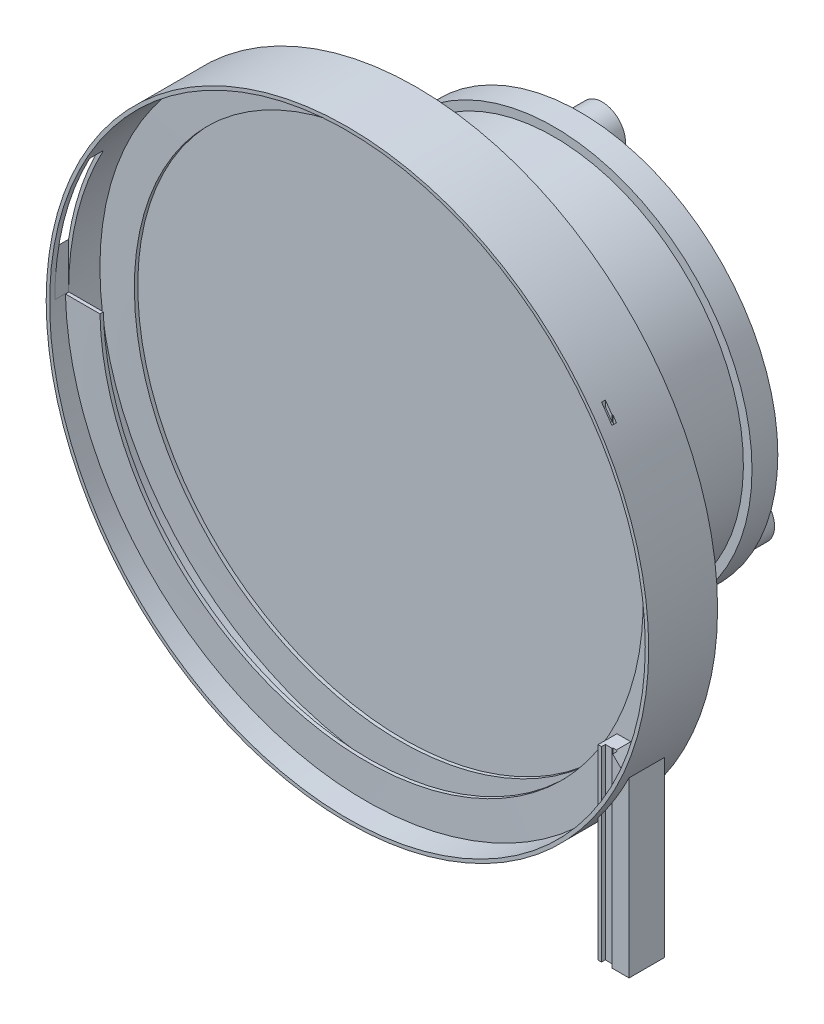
ISO-10303-21;
HEADER;
FILE_DESCRIPTION(('STEP AP214'),'2;1');
FILE_NAME('part.step','',(''),(''),'','','');
FILE_SCHEMA(('AUTOMOTIVE_DESIGN { 1 0 10303 214 1 1 1 1 }'));
ENDSEC;
DATA;
#1=APPLICATION_CONTEXT('core data for automotive mechanical design processes');
#2=APPLICATION_PROTOCOL_DEFINITION('international standard','automotive_design',2000,#1);
#3=PRODUCT_CONTEXT('',#1,'mechanical');
#4=PRODUCT('Part','Part','',(#3));
#5=PRODUCT_RELATED_PRODUCT_CATEGORY('part','',(#4));
#6=PRODUCT_DEFINITION_FORMATION('','',#4);
#7=PRODUCT_DEFINITION_CONTEXT('part definition',#1,'design');
#8=PRODUCT_DEFINITION('design','',#6,#7);
#9=PRODUCT_DEFINITION_SHAPE('','',#8);
#10=(LENGTH_UNIT() NAMED_UNIT(*) SI_UNIT(.MILLI.,.METRE.));
#11=(NAMED_UNIT(*) PLANE_ANGLE_UNIT() SI_UNIT($,.RADIAN.));
#12=(NAMED_UNIT(*) SI_UNIT($,.STERADIAN.) SOLID_ANGLE_UNIT());
#13=UNCERTAINTY_MEASURE_WITH_UNIT(LENGTH_MEASURE(1.E-05),#10,'distance_accuracy_value','');
#14=(GEOMETRIC_REPRESENTATION_CONTEXT(3) GLOBAL_UNCERTAINTY_ASSIGNED_CONTEXT((#13)) GLOBAL_UNIT_ASSIGNED_CONTEXT((#10,
#11,#12)) REPRESENTATION_CONTEXT('',''));
#15=CARTESIAN_POINT('',(0.,0.,0.));
#16=DIRECTION('',(0.,0.,1.));
#17=DIRECTION('',(1.,0.,0.));
#18=AXIS2_PLACEMENT_3D('',#15,#16,#17);
#19=CARTESIAN_POINT('',(139.,-69.6042301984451,128.4));
#20=DIRECTION('',(0.,0.,1.));
#21=DIRECTION('',(0.,-1.,0.));
#22=AXIS2_PLACEMENT_3D('',#19,#20,#21);
#23=PLANE('',#22);
#24=CARTESIAN_POINT('',(0.,0.,128.4));
#25=DIRECTION('',(0.,0.,1.));
#26=DIRECTION('',(0.,-1.,0.));
#27=AXIS2_PLACEMENT_3D('',#24,#25,#26);
#28=CIRCLE('',#27,173.);
#29=CARTESIAN_POINT('',(147.,-91.214034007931,128.4));
#30=VERTEX_POINT('',#29);
#31=CARTESIAN_POINT('',(154.745175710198,-77.349405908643,128.4));
#32=VERTEX_POINT('',#31);
#33=EDGE_CURVE('E476',#30,#32,#28,.T.);
#34=ORIENTED_EDGE('',*,*,#33,.T.);
#35=DIRECTION('',(0.707106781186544,-0.707106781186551,0.));
#36=VECTOR('',#35,1.);
#37=CARTESIAN_POINT('',(143.,-65.6042301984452,128.4));
#38=LINE('',#37,#36);
#39=CARTESIAN_POINT('',(147.5,-70.1042301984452,128.4));
#40=VERTEX_POINT('',#39);
#41=EDGE_CURVE('E1012',#32,#40,#38,.F.);
#42=ORIENTED_EDGE('',*,*,#41,.T.);
#43=DIRECTION('',(-0.707106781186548,-0.707106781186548,0.));
#44=VECTOR('',#43,1.);
#45=CARTESIAN_POINT('',(143.5,-74.1042301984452,128.4));
#46=LINE('',#45,#44);
#47=CARTESIAN_POINT('',(147.,-70.6042301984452,128.4));
#48=VERTEX_POINT('',#47);
#49=EDGE_CURVE('E1018',#40,#48,#46,.T.);
#50=ORIENTED_EDGE('',*,*,#49,.T.);
#51=DIRECTION('',(0.,-1.,0.));
#52=VECTOR('',#51,1.);
#53=CARTESIAN_POINT('',(147.,175.,128.4));
#54=LINE('',#53,#52);
#55=EDGE_CURVE('E351',#48,#30,#54,.T.);
#56=ORIENTED_EDGE('',*,*,#55,.T.);
#57=EDGE_LOOP('',(#34,#42,#50,#56));
#58=FACE_BOUND('',#57,.T.);
#59=ADVANCED_FACE('F36',(#58),#23,.T.);
#60=CARTESIAN_POINT('',(147.,-94.9526197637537,128.4));
#61=VERTEX_POINT('',#60);
#62=CARTESIAN_POINT('',(147.,-178.004230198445,128.4));
#63=VERTEX_POINT('',#62);
#64=EDGE_CURVE('E346',#61,#63,#54,.T.);
#65=ORIENTED_EDGE('',*,*,#64,.T.);
#66=DIRECTION('',(-1.,0.,0.));
#67=VECTOR('',#66,1.);
#68=CARTESIAN_POINT('',(157.,-178.004230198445,128.4));
#69=LINE('',#68,#67);
#70=CARTESIAN_POINT('',(157.,-178.004230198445,128.4));
#71=VERTEX_POINT('',#70);
#72=EDGE_CURVE('E406',#71,#63,#69,.T.);
#73=ORIENTED_EDGE('',*,*,#72,.F.);
#74=DIRECTION('',(0.,-1.,0.));
#75=VECTOR('',#74,1.);
#76=CARTESIAN_POINT('',(157.,-69.6042301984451,128.4));
#77=LINE('',#76,#75);
#78=CARTESIAN_POINT('',(157.,-77.3045923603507,128.4));
#79=VERTEX_POINT('',#78);
#80=EDGE_CURVE('E426',#79,#71,#77,.T.);
#81=ORIENTED_EDGE('',*,*,#80,.F.);
#82=CARTESIAN_POINT('',(0.,0.,128.4));
#83=DIRECTION('',(0.,0.,1.));
#84=DIRECTION('',(0.,-1.,0.));
#85=AXIS2_PLACEMENT_3D('',#82,#83,#84);
#86=CIRCLE('',#85,175.);
#87=EDGE_CURVE('E541',#61,#79,#86,.T.);
#88=ORIENTED_EDGE('',*,*,#87,.F.);
#89=EDGE_LOOP('',(#65,#73,#81,#88));
#90=FACE_BOUND('',#89,.T.);
#91=ADVANCED_FACE('F614',(#90),#23,.T.);
#92=CARTESIAN_POINT('',(0.,0.,135.));
#93=DIRECTION('',(0.,0.,-1.));
#94=DIRECTION('',(-1.,0.,0.));
#95=AXIS2_PLACEMENT_3D('',#92,#93,#94);
#96=CYLINDRICAL_SURFACE('',#95,175.);
#97=DIRECTION('',(0.,0.,-1.));
#98=VECTOR('',#97,1.);
#99=CARTESIAN_POINT('',(147.,94.9526197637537,135.));
#100=LINE('',#99,#98);
#101=CARTESIAN_POINT('',(147.,94.9526197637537,125.77));
#102=VERTEX_POINT('',#101);
#103=CARTESIAN_POINT('',(147.,94.9526197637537,128.4));
#104=VERTEX_POINT('',#103);
#105=EDGE_CURVE('E392',#102,#104,#100,.F.);
#106=ORIENTED_EDGE('',*,*,#105,.T.);
#107=CARTESIAN_POINT('',(0.,0.,128.4));
#108=DIRECTION('',(0.,0.,1.));
#109=DIRECTION('',(1.,0.,0.));
#110=AXIS2_PLACEMENT_3D('',#107,#108,#109);
#111=CIRCLE('',#110,175.);
#112=CARTESIAN_POINT('',(141.,103.653268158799,128.4));
#113=VERTEX_POINT('',#112);
#114=EDGE_CURVE('E402',#104,#113,#111,.T.);
#115=ORIENTED_EDGE('',*,*,#114,.T.);
#116=DIRECTION('',(0.,0.,-1.));
#117=VECTOR('',#116,1.);
#118=CARTESIAN_POINT('',(141.,103.653268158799,135.));
#119=LINE('',#118,#117);
#120=CARTESIAN_POINT('',(141.,103.653268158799,126.2));
#121=VERTEX_POINT('',#120);
#122=EDGE_CURVE('E367',#113,#121,#119,.T.);
#123=ORIENTED_EDGE('',*,*,#122,.T.);
#124=CARTESIAN_POINT('',(0.,0.,126.200000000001));
#125=DIRECTION('',(0.,0.,-1.));
#126=DIRECTION('',(-1.,0.,0.));
#127=AXIS2_PLACEMENT_3D('',#124,#125,#126);
#128=CIRCLE('',#127,175.);
#129=CARTESIAN_POINT('',(145.,97.9795897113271,126.2));
#130=VERTEX_POINT('',#129);
#131=EDGE_CURVE('E373',#121,#130,#128,.T.);
#132=ORIENTED_EDGE('',*,*,#131,.T.);
#133=DIRECTION('',(0.,0.,-1.));
#134=VECTOR('',#133,1.);
#135=CARTESIAN_POINT('',(145.,97.9795897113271,135.));
#136=LINE('',#135,#134);
#137=CARTESIAN_POINT('',(145.,97.9795897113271,125.77));
#138=VERTEX_POINT('',#137);
#139=EDGE_CURVE('E380',#130,#138,#136,.T.);
#140=ORIENTED_EDGE('',*,*,#139,.T.);
#141=CARTESIAN_POINT('',(0.,0.,125.77));
#142=DIRECTION('',(0.,0.,-1.));
#143=DIRECTION('',(-1.,0.,0.));
#144=AXIS2_PLACEMENT_3D('',#141,#142,#143);
#145=CIRCLE('',#144,175.);
#146=EDGE_CURVE('E387',#138,#102,#145,.T.);
#147=ORIENTED_EDGE('',*,*,#146,.T.);
#148=EDGE_LOOP('',(#106,#115,#123,#132,#140,#147));
#149=FACE_BOUND('',#148,.T.);
#150=DIRECTION('',(0.,0.,-1.));
#151=VECTOR('',#150,1.);
#152=CARTESIAN_POINT('',(-152.749999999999,85.3957698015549,135.));
#153=LINE('',#152,#151);
#154=CARTESIAN_POINT('',(-152.749999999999,85.3957698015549,132.));
#155=VERTEX_POINT('',#154);
#156=CARTESIAN_POINT('',(-152.749999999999,85.3957698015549,124.));
#157=VERTEX_POINT('',#156);
#158=EDGE_CURVE('E667',#155,#157,#153,.T.);
#159=ORIENTED_EDGE('',*,*,#158,.F.);
#160=CARTESIAN_POINT('',(0.,0.,132.));
#161=DIRECTION('',(0.,0.,-1.));
#162=DIRECTION('',(-1.,0.,0.));
#163=AXIS2_PLACEMENT_3D('',#160,#161,#162);
#164=CIRCLE('',#163,175.);
#165=CARTESIAN_POINT('',(-173.,26.3818119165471,132.));
#166=VERTEX_POINT('',#165);
#167=EDGE_CURVE('E669',#166,#155,#164,.T.);
#168=ORIENTED_EDGE('',*,*,#167,.F.);
#169=DIRECTION('',(0.,0.,-1.));
#170=VECTOR('',#169,1.);
#171=CARTESIAN_POINT('',(-173.,26.3818119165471,135.));
#172=LINE('',#171,#170);
#173=CARTESIAN_POINT('',(-173.,26.3818119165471,124.));
#174=VERTEX_POINT('',#173);
#175=EDGE_CURVE('E671',#174,#166,#172,.F.);
#176=ORIENTED_EDGE('',*,*,#175,.F.);
#177=CARTESIAN_POINT('',(0.,0.,124.));
#178=DIRECTION('',(0.,0.,1.));
#179=DIRECTION('',(1.,0.,0.));
#180=AXIS2_PLACEMENT_3D('',#177,#178,#179);
#181=CIRCLE('',#180,175.);
#182=EDGE_CURVE('E662',#157,#174,#181,.T.);
#183=ORIENTED_EDGE('',*,*,#182,.F.);
#184=EDGE_LOOP('',(#159,#168,#176,#183));
#185=FACE_BOUND('',#184,.T.);
#186=CARTESIAN_POINT('',(0.,0.,135.));
#187=DIRECTION('',(0.,0.,1.));
#188=DIRECTION('',(1.,0.,0.));
#189=AXIS2_PLACEMENT_3D('',#186,#187,#188);
#190=CIRCLE('',#189,175.);
#191=CARTESIAN_POINT('',(175.,0.,135.));
#192=VERTEX_POINT('',#191);
#193=EDGE_CURVE('E907',#192,#192,#190,.T.);
#194=ORIENTED_EDGE('',*,*,#193,.F.);
#195=EDGE_LOOP('',(#194));
#196=FACE_BOUND('',#195,.T.);
#197=CARTESIAN_POINT('',(0.,0.,95.));
#198=DIRECTION('',(0.,0.,1.));
#199=DIRECTION('',(1.,0.,0.));
#200=AXIS2_PLACEMENT_3D('',#197,#198,#199);
#201=CIRCLE('',#200,175.);
#202=CARTESIAN_POINT('',(175.,0.,95.));
#203=VERTEX_POINT('',#202);
#204=EDGE_CURVE('E910',#203,#203,#201,.T.);
#205=ORIENTED_EDGE('',*,*,#204,.T.);
#206=EDGE_LOOP('',(#205));
#207=FACE_BOUND('',#206,.T.);
#208=DIRECTION('',(0.,0.,-1.));
#209=VECTOR('',#208,1.);
#210=CARTESIAN_POINT('',(139.,-106.320270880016,135.));
#211=LINE('',#210,#209);
#212=CARTESIAN_POINT('',(139.,-106.320270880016,128.4));
#213=VERTEX_POINT('',#212);
#214=CARTESIAN_POINT('',(139.,-106.320270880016,107.9));
#215=VERTEX_POINT('',#214);
#216=EDGE_CURVE('E542',#213,#215,#211,.T.);
#217=ORIENTED_EDGE('',*,*,#216,.F.);
#218=CARTESIAN_POINT('',(141.,-103.653268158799,128.4));
#219=VERTEX_POINT('',#218);
#220=EDGE_CURVE('E544',#213,#219,#86,.T.);
#221=ORIENTED_EDGE('',*,*,#220,.T.);
#222=EDGE_CURVE('E399',#219,#61,#111,.T.);
#223=ORIENTED_EDGE('',*,*,#222,.T.);
#224=ORIENTED_EDGE('',*,*,#87,.T.);
#225=DIRECTION('',(0.,0.,-1.));
#226=VECTOR('',#225,1.);
#227=CARTESIAN_POINT('',(157.,-77.3045923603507,135.));
#228=LINE('',#227,#226);
#229=CARTESIAN_POINT('',(157.,-77.3045923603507,107.9));
#230=VERTEX_POINT('',#229);
#231=EDGE_CURVE('E432',#79,#230,#228,.T.);
#232=ORIENTED_EDGE('',*,*,#231,.T.);
#233=CARTESIAN_POINT('',(0.,0.,107.9));
#234=DIRECTION('',(0.,0.,-1.));
#235=DIRECTION('',(0.,1.,0.));
#236=AXIS2_PLACEMENT_3D('',#233,#234,#235);
#237=CIRCLE('',#236,175.);
#238=EDGE_CURVE('E643',#230,#215,#237,.T.);
#239=ORIENTED_EDGE('',*,*,#238,.T.);
#240=EDGE_LOOP('',(#217,#221,#223,#224,#232,#239));
#241=FACE_BOUND('',#240,.T.);
#242=ADVANCED_FACE('F619',(#149,#185,#196,#207,#241),#96,.T.);
#243=CARTESIAN_POINT('',(0.,0.,135.));
#244=DIRECTION('',(0.,0.,-1.));
#245=DIRECTION('',(-1.,0.,0.));
#246=AXIS2_PLACEMENT_3D('',#243,#244,#245);
#247=CYLINDRICAL_SURFACE('',#246,173.);
#248=CARTESIAN_POINT('',(0.,0.,128.4));
#249=DIRECTION('',(0.,0.,1.));
#250=DIRECTION('',(1.,0.,0.));
#251=AXIS2_PLACEMENT_3D('',#248,#249,#250);
#252=CIRCLE('',#251,173.);
#253=CARTESIAN_POINT('',(147.,91.214034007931,128.4));
#254=VERTEX_POINT('',#253);
#255=CARTESIAN_POINT('',(141.,100.239712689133,128.4));
#256=VERTEX_POINT('',#255);
#257=EDGE_CURVE('E398',#254,#256,#252,.T.);
#258=ORIENTED_EDGE('',*,*,#257,.F.);
#259=DIRECTION('',(0.,0.,-1.));
#260=VECTOR('',#259,1.);
#261=CARTESIAN_POINT('',(147.,91.214034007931,135.));
#262=LINE('',#261,#260);
#263=CARTESIAN_POINT('',(147.,91.214034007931,125.77));
#264=VERTEX_POINT('',#263);
#265=EDGE_CURVE('E390',#264,#254,#262,.F.);
#266=ORIENTED_EDGE('',*,*,#265,.F.);
#267=CARTESIAN_POINT('',(0.,0.,125.77));
#268=DIRECTION('',(0.,0.,-1.));
#269=DIRECTION('',(-1.,0.,0.));
#270=AXIS2_PLACEMENT_3D('',#267,#268,#269);
#271=CIRCLE('',#270,173.);
#272=CARTESIAN_POINT('',(145.,94.3610088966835,125.77));
#273=VERTEX_POINT('',#272);
#274=EDGE_CURVE('E385',#273,#264,#271,.T.);
#275=ORIENTED_EDGE('',*,*,#274,.F.);
#276=DIRECTION('',(0.,0.,-1.));
#277=VECTOR('',#276,1.);
#278=CARTESIAN_POINT('',(145.,94.3610088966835,135.));
#279=LINE('',#278,#277);
#280=CARTESIAN_POINT('',(145.,94.3610088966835,126.2));
#281=VERTEX_POINT('',#280);
#282=EDGE_CURVE('E378',#281,#273,#279,.T.);
#283=ORIENTED_EDGE('',*,*,#282,.F.);
#284=CARTESIAN_POINT('',(0.,0.,126.200000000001));
#285=DIRECTION('',(0.,0.,-1.));
#286=DIRECTION('',(-1.,0.,0.));
#287=AXIS2_PLACEMENT_3D('',#284,#285,#286);
#288=CIRCLE('',#287,173.);
#289=CARTESIAN_POINT('',(141.,100.239712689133,126.2));
#290=VERTEX_POINT('',#289);
#291=EDGE_CURVE('E371',#290,#281,#288,.T.);
#292=ORIENTED_EDGE('',*,*,#291,.F.);
#293=DIRECTION('',(0.,0.,-1.));
#294=VECTOR('',#293,1.);
#295=CARTESIAN_POINT('',(141.,100.239712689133,135.));
#296=LINE('',#295,#294);
#297=EDGE_CURVE('E365',#256,#290,#296,.T.);
#298=ORIENTED_EDGE('',*,*,#297,.F.);
#299=EDGE_LOOP('',(#258,#266,#275,#283,#292,#298));
#300=FACE_BOUND('',#299,.T.);
#301=DIRECTION('',(0.,0.,-1.));
#302=VECTOR('',#301,1.);
#303=CARTESIAN_POINT('',(-152.75,81.2184554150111,135.));
#304=LINE('',#303,#302);
#305=CARTESIAN_POINT('',(-152.75,81.2184554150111,132.));
#306=VERTEX_POINT('',#305);
#307=CARTESIAN_POINT('',(-152.75,81.2184554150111,124.));
#308=VERTEX_POINT('',#307);
#309=EDGE_CURVE('E664',#306,#308,#304,.T.);
#310=ORIENTED_EDGE('',*,*,#309,.T.);
#311=CARTESIAN_POINT('',(0.,0.,124.));
#312=DIRECTION('',(0.,0.,1.));
#313=DIRECTION('',(1.,0.,0.));
#314=AXIS2_PLACEMENT_3D('',#311,#312,#313);
#315=CIRCLE('',#314,173.);
#316=CARTESIAN_POINT('',(-173.,1.30606566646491E-12,124.));
#317=VERTEX_POINT('',#316);
#318=EDGE_CURVE('E659',#308,#317,#315,.T.);
#319=ORIENTED_EDGE('',*,*,#318,.T.);
#320=DIRECTION('',(0.,0.,1.));
#321=VECTOR('',#320,1.);
#322=CARTESIAN_POINT('',(-173.,1.30606566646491E-12,124.));
#323=LINE('',#322,#321);
#324=CARTESIAN_POINT('',(-173.,1.30606566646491E-12,132.));
#325=VERTEX_POINT('',#324);
#326=EDGE_CURVE('E644',#317,#325,#323,.T.);
#327=ORIENTED_EDGE('',*,*,#326,.T.);
#328=CARTESIAN_POINT('',(0.,0.,132.));
#329=DIRECTION('',(0.,0.,-1.));
#330=DIRECTION('',(-1.,0.,0.));
#331=AXIS2_PLACEMENT_3D('',#328,#329,#330);
#332=CIRCLE('',#331,173.);
#333=EDGE_CURVE('E813',#325,#306,#332,.T.);
#334=ORIENTED_EDGE('',*,*,#333,.T.);
#335=EDGE_LOOP('',(#310,#319,#327,#334));
#336=FACE_BOUND('',#335,.T.);
#337=CARTESIAN_POINT('',(0.,0.,135.));
#338=DIRECTION('',(0.,0.,1.));
#339=DIRECTION('',(1.,0.,0.));
#340=AXIS2_PLACEMENT_3D('',#337,#338,#339);
#341=CIRCLE('',#340,173.);
#342=CARTESIAN_POINT('',(173.,0.,135.));
#343=VERTEX_POINT('',#342);
#344=EDGE_CURVE('E913',#343,#343,#341,.T.);
#345=ORIENTED_EDGE('',*,*,#344,.T.);
#346=EDGE_LOOP('',(#345));
#347=FACE_BOUND('',#346,.T.);
#348=CARTESIAN_POINT('',(0.,0.,95.));
#349=DIRECTION('',(0.,0.,1.));
#350=DIRECTION('',(1.,0.,0.));
#351=AXIS2_PLACEMENT_3D('',#348,#349,#350);
#352=CIRCLE('',#351,173.);
#353=CARTESIAN_POINT('',(173.,0.,95.));
#354=VERTEX_POINT('',#353);
#355=EDGE_CURVE('E856',#354,#354,#352,.F.);
#356=ORIENTED_EDGE('',*,*,#355,.T.);
#357=EDGE_LOOP('',(#356));
#358=FACE_BOUND('',#357,.T.);
#359=CARTESIAN_POINT('',(139.,-102.99514551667,128.4));
#360=VERTEX_POINT('',#359);
#361=CARTESIAN_POINT('',(141.,-100.239712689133,128.4));
#362=VERTEX_POINT('',#361);
#363=EDGE_CURVE('E985',#360,#362,#28,.T.);
#364=ORIENTED_EDGE('',*,*,#363,.F.);
#365=DIRECTION('',(0.,0.,-1.));
#366=VECTOR('',#365,1.);
#367=CARTESIAN_POINT('',(139.,-102.99514551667,135.));
#368=LINE('',#367,#366);
#369=CARTESIAN_POINT('',(139.,-102.99514551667,107.9));
#370=VERTEX_POINT('',#369);
#371=EDGE_CURVE('E547',#360,#370,#368,.T.);
#372=ORIENTED_EDGE('',*,*,#371,.T.);
#373=CARTESIAN_POINT('',(0.,0.,107.9));
#374=DIRECTION('',(0.,0.,-1.));
#375=DIRECTION('',(0.,1.,0.));
#376=AXIS2_PLACEMENT_3D('',#373,#374,#375);
#377=CIRCLE('',#376,173.);
#378=CARTESIAN_POINT('',(154.745175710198,-77.349405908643,107.9));
#379=VERTEX_POINT('',#378);
#380=EDGE_CURVE('E990',#379,#370,#377,.T.);
#381=ORIENTED_EDGE('',*,*,#380,.F.);
#382=DIRECTION('',(0.,0.,-1.));
#383=VECTOR('',#382,1.);
#384=CARTESIAN_POINT('',(154.745175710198,-77.349405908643,111.696834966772));
#385=LINE('',#384,#383);
#386=EDGE_CURVE('E520',#379,#32,#385,.F.);
#387=ORIENTED_EDGE('',*,*,#386,.T.);
#388=ORIENTED_EDGE('',*,*,#33,.F.);
#389=EDGE_CURVE('E395',#362,#30,#252,.T.);
#390=ORIENTED_EDGE('',*,*,#389,.F.);
#391=EDGE_LOOP('',(#364,#372,#381,#387,#388,#390));
#392=FACE_BOUND('',#391,.T.);
#393=ADVANCED_FACE('F759',(#300,#336,#347,#358,#392),#247,.F.);
#394=CARTESIAN_POINT('',(152.75,1.84798018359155E-13,94.));
#395=CARTESIAN_POINT('',(152.75,-24.1932232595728,94.5));
#396=CARTESIAN_POINT('',(145.273882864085,-47.2023458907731,95.));
#397=CARTESIAN_POINT('',(137.79776572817,-70.2114685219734,95.5));
#398=CARTESIAN_POINT('',(123.577345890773,-89.7841972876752,96.));
#399=CARTESIAN_POINT('',(109.356926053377,-109.356926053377,96.5));
#400=CARTESIAN_POINT('',(89.7841972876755,-123.577345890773,97.));
#401=CARTESIAN_POINT('',(70.2114685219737,-137.797765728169,97.5));
#402=CARTESIAN_POINT('',(47.2023458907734,-145.273882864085,98.));
#403=CARTESIAN_POINT('',(24.1932232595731,-152.75,98.5));
#404=CARTESIAN_POINT('',(1.94151258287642E-13,-152.75,99.));
#405=CARTESIAN_POINT('',(-24.1932232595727,-152.75,99.5));
#406=CARTESIAN_POINT('',(-47.2023458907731,-145.273882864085,100.));
#407=CARTESIAN_POINT('',(-70.2114685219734,-137.79776572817,100.5));
#408=CARTESIAN_POINT('',(-89.7841972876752,-123.577345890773,101.));
#409=CARTESIAN_POINT('',(-109.356926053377,-109.356926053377,101.5));
#410=CARTESIAN_POINT('',(-123.577345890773,-89.7841972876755,102.));
#411=CARTESIAN_POINT('',(-137.797765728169,-70.2114685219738,102.5));
#412=CARTESIAN_POINT('',(-145.273882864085,-47.2023458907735,103.));
#413=CARTESIAN_POINT('',(-152.75,-24.1932232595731,103.5));
#414=CARTESIAN_POINT('',(-152.75,-2.0350449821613E-13,104.));
#415=CARTESIAN_POINT('',(-152.75,24.1932232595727,104.5));
#416=CARTESIAN_POINT('',(-145.273882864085,47.2023458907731,105.));
#417=CARTESIAN_POINT('',(-137.79776572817,70.2114685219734,105.5));
#418=CARTESIAN_POINT('',(-123.577345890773,89.7841972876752,106.));
#419=CARTESIAN_POINT('',(-109.356926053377,109.356926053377,106.5));
#420=CARTESIAN_POINT('',(-89.7841972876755,123.577345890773,107.));
#421=CARTESIAN_POINT('',(-70.2114685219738,137.797765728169,107.5));
#422=CARTESIAN_POINT('',(-47.2023458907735,145.273882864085,108.));
#423=CARTESIAN_POINT('',(-24.1932232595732,152.75,108.5));
#424=CARTESIAN_POINT('',(-2.12857738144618E-13,152.75,109.));
#425=CARTESIAN_POINT('',(24.1932232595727,152.75,109.5));
#426=CARTESIAN_POINT('',(47.2023458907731,145.273882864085,110.));
#427=CARTESIAN_POINT('',(70.2114685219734,137.79776572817,110.5));
#428=CARTESIAN_POINT('',(89.7841972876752,123.577345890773,111.));
#429=CARTESIAN_POINT('',(109.356926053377,109.356926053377,111.5));
#430=CARTESIAN_POINT('',(123.577345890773,89.7841972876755,112.));
#431=CARTESIAN_POINT('',(137.797765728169,70.2114685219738,112.5));
#432=CARTESIAN_POINT('',(145.273882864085,47.2023458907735,113.));
#433=CARTESIAN_POINT('',(152.75,24.1932232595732,113.5));
#434=CARTESIAN_POINT('',(152.75,1.84798018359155E-13,114.));
#435=CARTESIAN_POINT('',(152.75,-24.1932232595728,114.5));
#436=CARTESIAN_POINT('',(145.273882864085,-47.2023458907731,115.));
#437=CARTESIAN_POINT('',(137.79776572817,-70.2114685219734,115.5));
#438=CARTESIAN_POINT('',(123.577345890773,-89.7841972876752,116.));
#439=CARTESIAN_POINT('',(109.356926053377,-109.356926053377,116.5));
#440=CARTESIAN_POINT('',(89.7841972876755,-123.577345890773,117.));
#441=CARTESIAN_POINT('',(70.2114685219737,-137.797765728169,117.5));
#442=CARTESIAN_POINT('',(47.2023458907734,-145.273882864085,118.));
#443=CARTESIAN_POINT('',(24.1932232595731,-152.75,118.5));
#444=CARTESIAN_POINT('',(1.94151258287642E-13,-152.75,119.));
#445=CARTESIAN_POINT('',(-24.1932232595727,-152.75,119.5));
#446=CARTESIAN_POINT('',(-47.2023458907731,-145.273882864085,120.));
#447=CARTESIAN_POINT('',(-70.2114685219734,-137.79776572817,120.5));
#448=CARTESIAN_POINT('',(-89.7841972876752,-123.577345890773,121.));
#449=CARTESIAN_POINT('',(-109.356926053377,-109.356926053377,121.5));
#450=CARTESIAN_POINT('',(-123.577345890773,-89.7841972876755,122.));
#451=CARTESIAN_POINT('',(-137.797765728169,-70.2114685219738,122.5));
#452=CARTESIAN_POINT('',(-145.273882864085,-47.2023458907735,123.));
#453=CARTESIAN_POINT('',(-152.75,-24.1932232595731,123.5));
#454=CARTESIAN_POINT('',(-152.75,-2.0350449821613E-13,124.));
#455=CARTESIAN_POINT('',(172.75,2.08994158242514E-13,94.));
#456=CARTESIAN_POINT('',(172.75,-27.3609120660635,94.5));
#457=CARTESIAN_POINT('',(164.295013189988,-53.382685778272,95.));
#458=CARTESIAN_POINT('',(155.840026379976,-79.4044594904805,95.5));
#459=CARTESIAN_POINT('',(139.757685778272,-101.539902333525,96.));
#460=CARTESIAN_POINT('',(123.675345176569,-123.675345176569,96.5));
#461=CARTESIAN_POINT('',(101.539902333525,-139.757685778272,97.));
#462=CARTESIAN_POINT('',(79.4044594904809,-155.840026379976,97.5));
#463=CARTESIAN_POINT('',(53.3826857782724,-164.295013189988,98.));
#464=CARTESIAN_POINT('',(27.3609120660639,-172.75,98.5));
#465=CARTESIAN_POINT('',(2.19572044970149E-13,-172.75,99.));
#466=CARTESIAN_POINT('',(-27.3609120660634,-172.75,99.5));
#467=CARTESIAN_POINT('',(-53.382685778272,-164.295013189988,100.));
#468=CARTESIAN_POINT('',(-79.4044594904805,-155.840026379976,100.5));
#469=CARTESIAN_POINT('',(-101.539902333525,-139.757685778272,101.));
#470=CARTESIAN_POINT('',(-123.675345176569,-123.675345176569,101.5));
#471=CARTESIAN_POINT('',(-139.757685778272,-101.539902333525,102.));
#472=CARTESIAN_POINT('',(-155.840026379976,-79.4044594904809,102.5));
#473=CARTESIAN_POINT('',(-164.295013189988,-53.3826857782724,103.));
#474=CARTESIAN_POINT('',(-172.75,-27.3609120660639,103.5));
#475=CARTESIAN_POINT('',(-172.75,-2.30149931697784E-13,104.));
#476=CARTESIAN_POINT('',(-172.75,27.3609120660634,104.5));
#477=CARTESIAN_POINT('',(-164.295013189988,53.382685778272,105.));
#478=CARTESIAN_POINT('',(-155.840026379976,79.4044594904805,105.5));
#479=CARTESIAN_POINT('',(-139.757685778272,101.539902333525,106.));
#480=CARTESIAN_POINT('',(-123.675345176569,123.675345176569,106.5));
#481=CARTESIAN_POINT('',(-101.539902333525,139.757685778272,107.));
#482=CARTESIAN_POINT('',(-79.404459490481,155.840026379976,107.5));
#483=CARTESIAN_POINT('',(-53.3826857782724,164.295013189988,108.));
#484=CARTESIAN_POINT('',(-27.3609120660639,172.75,108.5));
#485=CARTESIAN_POINT('',(-2.40727818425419E-13,172.75,109.));
#486=CARTESIAN_POINT('',(27.3609120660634,172.75,109.5));
#487=CARTESIAN_POINT('',(53.382685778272,164.295013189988,110.));
#488=CARTESIAN_POINT('',(79.4044594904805,155.840026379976,110.5));
#489=CARTESIAN_POINT('',(101.539902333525,139.757685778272,111.));
#490=CARTESIAN_POINT('',(123.675345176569,123.675345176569,111.5));
#491=CARTESIAN_POINT('',(139.757685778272,101.539902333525,112.));
#492=CARTESIAN_POINT('',(155.840026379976,79.404459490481,112.5));
#493=CARTESIAN_POINT('',(164.295013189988,53.3826857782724,113.));
#494=CARTESIAN_POINT('',(172.75,27.3609120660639,113.5));
#495=CARTESIAN_POINT('',(172.75,2.08994158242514E-13,114.));
#496=CARTESIAN_POINT('',(172.75,-27.3609120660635,114.5));
#497=CARTESIAN_POINT('',(164.295013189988,-53.382685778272,115.));
#498=CARTESIAN_POINT('',(155.840026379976,-79.4044594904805,115.5));
#499=CARTESIAN_POINT('',(139.757685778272,-101.539902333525,116.));
#500=CARTESIAN_POINT('',(123.675345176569,-123.675345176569,116.5));
#501=CARTESIAN_POINT('',(101.539902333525,-139.757685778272,117.));
#502=CARTESIAN_POINT('',(79.4044594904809,-155.840026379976,117.5));
#503=CARTESIAN_POINT('',(53.3826857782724,-164.295013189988,118.));
#504=CARTESIAN_POINT('',(27.3609120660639,-172.75,118.5));
#505=CARTESIAN_POINT('',(2.19572044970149E-13,-172.75,119.));
#506=CARTESIAN_POINT('',(-27.3609120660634,-172.75,119.5));
#507=CARTESIAN_POINT('',(-53.382685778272,-164.295013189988,120.));
#508=CARTESIAN_POINT('',(-79.4044594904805,-155.840026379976,120.5));
#509=CARTESIAN_POINT('',(-101.539902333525,-139.757685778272,121.));
#510=CARTESIAN_POINT('',(-123.675345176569,-123.675345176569,121.5));
#511=CARTESIAN_POINT('',(-139.757685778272,-101.539902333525,122.));
#512=CARTESIAN_POINT('',(-155.840026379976,-79.4044594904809,122.5));
#513=CARTESIAN_POINT('',(-164.295013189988,-53.3826857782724,123.));
#514=CARTESIAN_POINT('',(-172.75,-27.3609120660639,123.5));
#515=CARTESIAN_POINT('',(-172.75,-2.30149931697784E-13,124.));
#516=(BOUNDED_SURFACE() B_SPLINE_SURFACE(1,2,((#394,#395,#396,#397,#398,#399,#400,#401,#402,
#403,#404,#405,#406,#407,#408,#409,#410,#411,#412,#413,#414,#415,#416,#417,#418,#419,#420,#421,
#422,#423,#424,#425,#426,#427,#428,#429,#430,#431,#432,#433,#434,#435,#436,#437,#438,#439,#440,
#441,#442,#443,#444,#445,#446,#447,#448,#449,#450,#451,#452,#453,#454),(#455,#456,#457,#458,
#459,#460,#461,#462,#463,#464,#465,#466,#467,#468,#469,#470,#471,#472,#473,#474,#475,#476,#477,
#478,#479,#480,#481,#482,#483,#484,#485,#486,#487,#488,#489,#490,#491,#492,#493,#494,#495,#496,
#497,#498,#499,#500,#501,#502,#503,#504,#505,#506,#507,#508,#509,#510,#511,#512,#513,#514,
#515)),.UNSPECIFIED.,.F.,.F.,.F.) B_SPLINE_SURFACE_WITH_KNOTS((2,2),(3,2,2,2,2,2,2,2,2,2,2,2,2,
2,2,2,2,2,2,2,2,2,2,2,2,2,2,2,2,2,3),(0.,1.),(0.,0.025,0.05,0.075,0.1,0.125,0.15,0.175,0.2,
0.225,0.25,0.275,0.3,0.325,0.35,0.375,0.4,0.425,0.45,0.475,0.5,0.525,0.55,0.575,0.6,0.625,0.65,
0.675,0.7,0.725,0.75),
.UNSPECIFIED.) GEOMETRIC_REPRESENTATION_ITEM() RATIONAL_B_SPLINE_SURFACE(((1.,0.987688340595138,
1.,0.987688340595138,1.,0.987688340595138,1.,0.987688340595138,1.,0.987688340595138,1.,
0.987688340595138,1.,0.987688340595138,1.,0.987688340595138,1.,0.987688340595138,1.,
0.987688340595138,1.,0.987688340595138,1.,0.987688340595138,1.,0.987688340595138,1.,
0.987688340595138,1.,0.987688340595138,1.,0.987688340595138,1.,0.987688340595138,1.,
0.987688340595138,1.,0.987688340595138,1.,0.987688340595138,1.,0.987688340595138,1.,
0.987688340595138,1.,0.987688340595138,1.,0.987688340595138,1.,0.987688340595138,1.,
0.987688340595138,1.,0.987688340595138,1.,0.987688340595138,1.,0.987688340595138,1.,
0.987688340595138,1.),(1.,0.987688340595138,1.,0.987688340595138,1.,0.987688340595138,1.,
0.987688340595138,1.,0.987688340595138,1.,0.987688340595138,1.,0.987688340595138,1.,
0.987688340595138,1.,0.987688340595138,1.,0.987688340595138,1.,0.987688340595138,1.,
0.987688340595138,1.,0.987688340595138,1.,0.987688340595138,1.,0.987688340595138,1.,
0.987688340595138,1.,0.987688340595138,1.,0.987688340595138,1.,0.987688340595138,1.,
0.987688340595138,1.,0.987688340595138,1.,0.987688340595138,1.,0.987688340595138,1.,
0.987688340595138,1.,0.987688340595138,1.,0.987688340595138,1.,0.987688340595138,1.,
0.987688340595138,1.,0.987688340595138,1.,0.987688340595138,1.))) REPRESENTATION_ITEM('') SURFACE());
#517=CARTESIAN_POINT('',(139.,-69.6042301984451,115.477653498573));
#518=CARTESIAN_POINT('',(140.499988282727,-69.6042301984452,115.463845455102));
#519=CARTESIAN_POINT('',(141.999979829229,-69.6042301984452,115.450394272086));
#520=CARTESIAN_POINT('',(144.999968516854,-69.6042301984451,115.424161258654));
#521=CARTESIAN_POINT('',(146.499965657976,-69.6042301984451,115.41137942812));
#522=CARTESIAN_POINT('',(149.499966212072,-69.6042301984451,115.386440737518));
#523=CARTESIAN_POINT('',(150.999969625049,-69.6042301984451,115.374283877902));
#524=CARTESIAN_POINT('',(153.99998134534,-69.6042301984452,115.35055553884));
#525=CARTESIAN_POINT('',(155.499989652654,-69.6042301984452,115.338984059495));
#526=CARTESIAN_POINT('',(157.,-69.6042301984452,115.327685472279));
#527=B_SPLINE_CURVE_WITH_KNOTS('',3,(#517,#518,#519,#520,#521,#522,#523,#524,#525,#526),
.UNSPECIFIED.,.F.,.F.,(4,2,2,2,4),(0.,4.50015543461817,9.00031008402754,13.5004679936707,
18.0006266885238),.UNSPECIFIED.);
#528=CARTESIAN_POINT('',(139.,-69.6042301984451,115.477653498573));
#529=VERTEX_POINT('',#528);
#530=CARTESIAN_POINT('',(147.,-69.6042301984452,115.407269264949));
#531=VERTEX_POINT('',#530);
#532=EDGE_CURVE('E535',#529,#531,#527,.T.);
#533=CARTESIAN_POINT('',(139.,-69.6042301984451,115.477653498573));
#534=CARTESIAN_POINT('',(139.,-72.9785438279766,115.539713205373));
#535=CARTESIAN_POINT('',(139.,-76.3528917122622,115.599924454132));
#536=CARTESIAN_POINT('',(139.,-83.1016533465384,115.716536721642));
#537=CARTESIAN_POINT('',(139.,-86.47606709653,115.772937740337));
#538=CARTESIAN_POINT('',(139.,-91.9711809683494,115.861589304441));
#539=CARTESIAN_POINT('',(139.,-94.0918619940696,115.895026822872));
#540=CARTESIAN_POINT('',(139.,-98.3332476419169,115.960376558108));
#541=CARTESIAN_POINT('',(139.,-100.453952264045,115.992288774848));
#542=CARTESIAN_POINT('',(139.,-102.57466792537,116.02345048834));
#543=B_SPLINE_CURVE_WITH_KNOTS('',3,(#533,#534,#535,#536,#537,#538,#539,#540,#541,#542),
.UNSPECIFIED.,.F.,.F.,(4,2,2,2,4),(0.,10.1246527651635,20.2493056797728,26.6121390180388,
32.974972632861),.UNSPECIFIED.);
#544=CARTESIAN_POINT('',(139.,-102.574667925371,116.02345048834));
#545=VERTEX_POINT('',#544);
#546=EDGE_CURVE('E444',#529,#545,#543,.T.);
#547=CARTESIAN_POINT('',(172.75,2.08994158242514E-13,94.));
#548=CARTESIAN_POINT('',(172.75,-27.3609120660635,94.5));
#549=CARTESIAN_POINT('',(164.295013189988,-53.382685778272,95.));
#550=CARTESIAN_POINT('',(155.840026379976,-79.4044594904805,95.5));
#551=CARTESIAN_POINT('',(139.757685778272,-101.539902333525,96.));
#552=CARTESIAN_POINT('',(123.675345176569,-123.675345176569,96.5));
#553=CARTESIAN_POINT('',(101.539902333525,-139.757685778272,97.));
#554=CARTESIAN_POINT('',(79.4044594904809,-155.840026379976,97.5));
#555=CARTESIAN_POINT('',(53.3826857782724,-164.295013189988,98.));
#556=CARTESIAN_POINT('',(27.3609120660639,-172.75,98.5));
#557=CARTESIAN_POINT('',(2.19572044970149E-13,-172.75,99.));
#558=CARTESIAN_POINT('',(-27.3609120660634,-172.75,99.5));
#559=CARTESIAN_POINT('',(-53.382685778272,-164.295013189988,100.));
#560=CARTESIAN_POINT('',(-79.4044594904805,-155.840026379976,100.5));
#561=CARTESIAN_POINT('',(-101.539902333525,-139.757685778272,101.));
#562=CARTESIAN_POINT('',(-123.675345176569,-123.675345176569,101.5));
#563=CARTESIAN_POINT('',(-139.757685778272,-101.539902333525,102.));
#564=CARTESIAN_POINT('',(-155.840026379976,-79.4044594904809,102.5));
#565=CARTESIAN_POINT('',(-164.295013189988,-53.3826857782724,103.));
#566=CARTESIAN_POINT('',(-172.75,-27.3609120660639,103.5));
#567=CARTESIAN_POINT('',(-172.75,-2.30149931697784E-13,104.));
#568=CARTESIAN_POINT('',(-172.75,27.3609120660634,104.5));
#569=CARTESIAN_POINT('',(-164.295013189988,53.382685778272,105.));
#570=CARTESIAN_POINT('',(-155.840026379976,79.4044594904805,105.5));
#571=CARTESIAN_POINT('',(-139.757685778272,101.539902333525,106.));
#572=CARTESIAN_POINT('',(-123.675345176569,123.675345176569,106.5));
#573=CARTESIAN_POINT('',(-101.539902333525,139.757685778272,107.));
#574=CARTESIAN_POINT('',(-79.404459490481,155.840026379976,107.5));
#575=CARTESIAN_POINT('',(-53.3826857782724,164.295013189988,108.));
#576=CARTESIAN_POINT('',(-27.3609120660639,172.75,108.5));
#577=CARTESIAN_POINT('',(-2.40727818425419E-13,172.75,109.));
#578=CARTESIAN_POINT('',(27.3609120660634,172.75,109.5));
#579=CARTESIAN_POINT('',(53.382685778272,164.295013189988,110.));
#580=CARTESIAN_POINT('',(79.4044594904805,155.840026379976,110.5));
#581=CARTESIAN_POINT('',(101.539902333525,139.757685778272,111.));
#582=CARTESIAN_POINT('',(123.675345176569,123.675345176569,111.5));
#583=CARTESIAN_POINT('',(139.757685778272,101.539902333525,112.));
#584=CARTESIAN_POINT('',(155.840026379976,79.404459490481,112.5));
#585=CARTESIAN_POINT('',(164.295013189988,53.3826857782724,113.));
#586=CARTESIAN_POINT('',(172.75,27.3609120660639,113.5));
#587=CARTESIAN_POINT('',(172.75,2.08994158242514E-13,114.));
#588=CARTESIAN_POINT('',(172.75,-27.3609120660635,114.5));
#589=CARTESIAN_POINT('',(164.295013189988,-53.382685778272,115.));
#590=CARTESIAN_POINT('',(155.840026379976,-79.4044594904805,115.5));
#591=CARTESIAN_POINT('',(139.757685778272,-101.539902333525,116.));
#592=CARTESIAN_POINT('',(123.675345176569,-123.675345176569,116.5));
#593=CARTESIAN_POINT('',(101.539902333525,-139.757685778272,117.));
#594=CARTESIAN_POINT('',(79.4044594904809,-155.840026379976,117.5));
#595=CARTESIAN_POINT('',(53.3826857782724,-164.295013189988,118.));
#596=CARTESIAN_POINT('',(27.3609120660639,-172.75,118.5));
#597=CARTESIAN_POINT('',(2.19572044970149E-13,-172.75,119.));
#598=CARTESIAN_POINT('',(-27.3609120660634,-172.75,119.5));
#599=CARTESIAN_POINT('',(-53.382685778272,-164.295013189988,120.));
#600=CARTESIAN_POINT('',(-79.4044594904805,-155.840026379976,120.5));
#601=CARTESIAN_POINT('',(-101.539902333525,-139.757685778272,121.));
#602=CARTESIAN_POINT('',(-123.675345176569,-123.675345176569,121.5));
#603=CARTESIAN_POINT('',(-139.757685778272,-101.539902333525,122.));
#604=CARTESIAN_POINT('',(-155.840026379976,-79.4044594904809,122.5));
#605=CARTESIAN_POINT('',(-164.295013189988,-53.3826857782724,123.));
#606=CARTESIAN_POINT('',(-172.75,-27.3609120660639,123.5));
#607=CARTESIAN_POINT('',(-172.75,-2.30149931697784E-13,124.));
#608=(BOUNDED_CURVE() B_SPLINE_CURVE(2,(#547,#548,#549,#550,#551,#552,#553,#554,#555,#556,#557,
#558,#559,#560,#561,#562,#563,#564,#565,#566,#567,#568,#569,#570,#571,#572,#573,#574,#575,#576,
#577,#578,#579,#580,#581,#582,#583,#584,#585,#586,#587,#588,#589,#590,#591,#592,#593,#594,#595,
#596,#597,#598,#599,#600,#601,#602,#603,#604,#605,#606,#607),.UNSPECIFIED.,.F.,
.F.) B_SPLINE_CURVE_WITH_KNOTS((3,2,2,2,2,2,2,2,2,2,2,2,2,2,2,2,2,2,2,2,2,2,2,2,2,2,2,2,2,2,3),
(0.,0.025,0.05,0.075,0.1,0.125,0.15,0.175,0.2,0.225,0.25,0.275,0.3,0.325,0.35,0.375,0.4,0.425,
0.45,0.475,0.5,0.525,0.55,0.575,0.6,0.625,0.65,0.675,0.7,0.725,0.75),
.UNSPECIFIED.) CURVE() GEOMETRIC_REPRESENTATION_ITEM() RATIONAL_B_SPLINE_CURVE((1.,
0.987688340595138,1.,0.987688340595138,1.,0.987688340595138,1.,0.987688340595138,1.,
0.987688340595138,1.,0.987688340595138,1.,0.987688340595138,1.,0.987688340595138,1.,
0.987688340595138,1.,0.987688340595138,1.,0.987688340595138,1.,0.987688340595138,1.,
0.987688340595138,1.,0.987688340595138,1.,0.987688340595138,1.,0.987688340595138,1.,
0.987688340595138,1.,0.987688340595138,1.,0.987688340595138,1.,0.987688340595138,1.,
0.987688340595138,1.,0.987688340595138,1.,0.987688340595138,1.,0.987688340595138,1.,
0.987688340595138,1.,0.987688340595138,1.,0.987688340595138,1.,0.987688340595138,1.,
0.987688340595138,1.,0.987688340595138,1.)) REPRESENTATION_ITEM(''));
#609=CARTESIAN_POINT('',(-172.75,-2.30149931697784E-13,124.));
#610=VERTEX_POINT('',#609);
#611=EDGE_CURVE('E483',#545,#610,#608,.T.);
#612=CARTESIAN_POINT('',(-172.75,-2.30149931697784E-13,124.));
#613=CARTESIAN_POINT('',(-152.75,-2.0350449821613E-13,124.));
#614=(BOUNDED_CURVE() B_SPLINE_CURVE(1,(#612,#613),.UNSPECIFIED.,.F.,
.F.) B_SPLINE_CURVE_WITH_KNOTS((2,2),(0.,1.),
.UNSPECIFIED.) CURVE() GEOMETRIC_REPRESENTATION_ITEM() RATIONAL_B_SPLINE_CURVE((1.,1.)) REPRESENTATION_ITEM(''));
#615=CARTESIAN_POINT('',(-152.75,-2.0350449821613E-13,124.));
#616=VERTEX_POINT('',#615);
#617=EDGE_CURVE('E688',#610,#616,#614,.T.);
#618=CARTESIAN_POINT('',(152.75,1.84798018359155E-13,94.));
#619=CARTESIAN_POINT('',(152.75,-24.1932232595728,94.5));
#620=CARTESIAN_POINT('',(145.273882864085,-47.2023458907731,95.));
#621=CARTESIAN_POINT('',(137.79776572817,-70.2114685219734,95.5));
#622=CARTESIAN_POINT('',(123.577345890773,-89.7841972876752,96.));
#623=CARTESIAN_POINT('',(109.356926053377,-109.356926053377,96.5));
#624=CARTESIAN_POINT('',(89.7841972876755,-123.577345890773,97.));
#625=CARTESIAN_POINT('',(70.2114685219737,-137.797765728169,97.5));
#626=CARTESIAN_POINT('',(47.2023458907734,-145.273882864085,98.));
#627=CARTESIAN_POINT('',(24.1932232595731,-152.75,98.5));
#628=CARTESIAN_POINT('',(1.94151258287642E-13,-152.75,99.));
#629=CARTESIAN_POINT('',(-24.1932232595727,-152.75,99.5));
#630=CARTESIAN_POINT('',(-47.2023458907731,-145.273882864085,100.));
#631=CARTESIAN_POINT('',(-70.2114685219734,-137.79776572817,100.5));
#632=CARTESIAN_POINT('',(-89.7841972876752,-123.577345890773,101.));
#633=CARTESIAN_POINT('',(-109.356926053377,-109.356926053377,101.5));
#634=CARTESIAN_POINT('',(-123.577345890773,-89.7841972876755,102.));
#635=CARTESIAN_POINT('',(-137.797765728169,-70.2114685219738,102.5));
#636=CARTESIAN_POINT('',(-145.273882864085,-47.2023458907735,103.));
#637=CARTESIAN_POINT('',(-152.75,-24.1932232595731,103.5));
#638=CARTESIAN_POINT('',(-152.75,-2.0350449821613E-13,104.));
#639=CARTESIAN_POINT('',(-152.75,24.1932232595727,104.5));
#640=CARTESIAN_POINT('',(-145.273882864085,47.2023458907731,105.));
#641=CARTESIAN_POINT('',(-137.79776572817,70.2114685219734,105.5));
#642=CARTESIAN_POINT('',(-123.577345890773,89.7841972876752,106.));
#643=CARTESIAN_POINT('',(-109.356926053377,109.356926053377,106.5));
#644=CARTESIAN_POINT('',(-89.7841972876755,123.577345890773,107.));
#645=CARTESIAN_POINT('',(-70.2114685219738,137.797765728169,107.5));
#646=CARTESIAN_POINT('',(-47.2023458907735,145.273882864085,108.));
#647=CARTESIAN_POINT('',(-24.1932232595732,152.75,108.5));
#648=CARTESIAN_POINT('',(-2.12857738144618E-13,152.75,109.));
#649=CARTESIAN_POINT('',(24.1932232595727,152.75,109.5));
#650=CARTESIAN_POINT('',(47.2023458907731,145.273882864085,110.));
#651=CARTESIAN_POINT('',(70.2114685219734,137.79776572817,110.5));
#652=CARTESIAN_POINT('',(89.7841972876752,123.577345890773,111.));
#653=CARTESIAN_POINT('',(109.356926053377,109.356926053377,111.5));
#654=CARTESIAN_POINT('',(123.577345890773,89.7841972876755,112.));
#655=CARTESIAN_POINT('',(137.797765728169,70.2114685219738,112.5));
#656=CARTESIAN_POINT('',(145.273882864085,47.2023458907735,113.));
#657=CARTESIAN_POINT('',(152.75,24.1932232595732,113.5));
#658=CARTESIAN_POINT('',(152.75,1.84798018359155E-13,114.));
#659=CARTESIAN_POINT('',(152.75,-24.1932232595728,114.5));
#660=CARTESIAN_POINT('',(145.273882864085,-47.2023458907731,115.));
#661=CARTESIAN_POINT('',(137.79776572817,-70.2114685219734,115.5));
#662=CARTESIAN_POINT('',(123.577345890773,-89.7841972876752,116.));
#663=CARTESIAN_POINT('',(109.356926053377,-109.356926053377,116.5));
#664=CARTESIAN_POINT('',(89.7841972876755,-123.577345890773,117.));
#665=CARTESIAN_POINT('',(70.2114685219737,-137.797765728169,117.5));
#666=CARTESIAN_POINT('',(47.2023458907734,-145.273882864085,118.));
#667=CARTESIAN_POINT('',(24.1932232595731,-152.75,118.5));
#668=CARTESIAN_POINT('',(1.94151258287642E-13,-152.75,119.));
#669=CARTESIAN_POINT('',(-24.1932232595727,-152.75,119.5));
#670=CARTESIAN_POINT('',(-47.2023458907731,-145.273882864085,120.));
#671=CARTESIAN_POINT('',(-70.2114685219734,-137.79776572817,120.5));
#672=CARTESIAN_POINT('',(-89.7841972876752,-123.577345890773,121.));
#673=CARTESIAN_POINT('',(-109.356926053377,-109.356926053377,121.5));
#674=CARTESIAN_POINT('',(-123.577345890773,-89.7841972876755,122.));
#675=CARTESIAN_POINT('',(-137.797765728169,-70.2114685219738,122.5));
#676=CARTESIAN_POINT('',(-145.273882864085,-47.2023458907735,123.));
#677=CARTESIAN_POINT('',(-152.75,-24.1932232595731,123.5));
#678=CARTESIAN_POINT('',(-152.75,-2.0350449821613E-13,124.));
#679=(BOUNDED_CURVE() B_SPLINE_CURVE(2,(#618,#619,#620,#621,#622,#623,#624,#625,#626,#627,#628,
#629,#630,#631,#632,#633,#634,#635,#636,#637,#638,#639,#640,#641,#642,#643,#644,#645,#646,#647,
#648,#649,#650,#651,#652,#653,#654,#655,#656,#657,#658,#659,#660,#661,#662,#663,#664,#665,#666,
#667,#668,#669,#670,#671,#672,#673,#674,#675,#676,#677,#678),.UNSPECIFIED.,.F.,
.F.) B_SPLINE_CURVE_WITH_KNOTS((3,2,2,2,2,2,2,2,2,2,2,2,2,2,2,2,2,2,2,2,2,2,2,2,2,2,2,2,2,2,3),
(0.,0.025,0.05,0.075,0.1,0.125,0.15,0.175,0.2,0.225,0.25,0.275,0.3,0.325,0.35,0.375,0.4,0.425,
0.45,0.475,0.5,0.525,0.55,0.575,0.6,0.625,0.65,0.675,0.7,0.725,0.75),
.UNSPECIFIED.) CURVE() GEOMETRIC_REPRESENTATION_ITEM() RATIONAL_B_SPLINE_CURVE((1.,
0.987688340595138,1.,0.987688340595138,1.,0.987688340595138,1.,0.987688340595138,1.,
0.987688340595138,1.,0.987688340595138,1.,0.987688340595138,1.,0.987688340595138,1.,
0.987688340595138,1.,0.987688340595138,1.,0.987688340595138,1.,0.987688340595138,1.,
0.987688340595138,1.,0.987688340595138,1.,0.987688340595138,1.,0.987688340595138,1.,
0.987688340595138,1.,0.987688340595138,1.,0.987688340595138,1.,0.987688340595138,1.,
0.987688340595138,1.,0.987688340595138,1.,0.987688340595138,1.,0.987688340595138,1.,
0.987688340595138,1.,0.987688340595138,1.,0.987688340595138,1.,0.987688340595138,1.,
0.987688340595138,1.,0.987688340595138,1.)) REPRESENTATION_ITEM(''));
#680=CARTESIAN_POINT('',(145.273882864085,-47.2023458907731,95.));
#681=VERTEX_POINT('',#680);
#682=EDGE_CURVE('E791',#681,#616,#679,.T.);
#683=CARTESIAN_POINT('',(145.273882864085,-47.2023458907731,95.));
#684=CARTESIAN_POINT('',(146.878735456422,-47.7237941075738,95.));
#685=CARTESIAN_POINT('',(148.483588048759,-48.2452423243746,95.));
#686=CARTESIAN_POINT('',(151.693293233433,-49.2881387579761,95.));
#687=CARTESIAN_POINT('',(153.298145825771,-49.8095869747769,95.));
#688=CARTESIAN_POINT('',(158.033670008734,-51.3482520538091,95.));
#689=CARTESIAN_POINT('',(161.164341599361,-52.3654689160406,95.));
#690=CARTESIAN_POINT('',(164.295013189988,-53.382685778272,95.));
#691=B_SPLINE_CURVE_WITH_KNOTS('',3,(#683,#684,#685,#686,#687,#688,#689,#690),.UNSPECIFIED.,.F.,
.F.,(4,2,2,4),(0.,5.06232562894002,10.12465125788,20.),.UNSPECIFIED.);
#692=CARTESIAN_POINT('',(164.295013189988,-53.382685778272,95.));
#693=VERTEX_POINT('',#692);
#694=EDGE_CURVE('E851',#681,#693,#691,.T.);
#695=CARTESIAN_POINT('',(154.558814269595,-77.1630444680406,115.473811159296));
#696=VERTEX_POINT('',#695);
#697=EDGE_CURVE('E55',#693,#696,#608,.T.);
#698=CARTESIAN_POINT('',(154.558814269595,-77.1630444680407,115.473811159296));
#699=CARTESIAN_POINT('',(153.299009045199,-75.9032392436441,115.463386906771));
#700=CARTESIAN_POINT('',(152.039205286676,-74.6434354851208,115.452629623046));
#701=CARTESIAN_POINT('',(149.519600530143,-72.1238307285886,115.430448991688));
#702=CARTESIAN_POINT('',(148.259799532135,-70.8640297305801,115.419025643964));
#703=CARTESIAN_POINT('',(147.,-69.6042301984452,115.407269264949));
#704=B_SPLINE_CURVE_WITH_KNOTS('',3,(#698,#699,#700,#701,#702,#703),.UNSPECIFIED.,.F.,.F.,(4,2,
4),(0.,5.3449921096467,10.689984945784),.UNSPECIFIED.);
#705=EDGE_CURVE('E12',#696,#531,#704,.T.);
#706=ORIENTED_EDGE('',*,*,#532,.F.);
#707=ORIENTED_EDGE('',*,*,#546,.T.);
#708=ORIENTED_EDGE('',*,*,#611,.T.);
#709=ORIENTED_EDGE('',*,*,#617,.T.);
#710=ORIENTED_EDGE('',*,*,#682,.F.);
#711=ORIENTED_EDGE('',*,*,#694,.T.);
#712=ORIENTED_EDGE('',*,*,#697,.T.);
#713=ORIENTED_EDGE('',*,*,#705,.T.);
#714=EDGE_LOOP('',(#706,#707,#708,#709,#710,#711,#712,#713));
#715=FACE_BOUND('',#714,.T.);
#716=ADVANCED_FACE('F534',(#715),#516,.T.);
#717=CARTESIAN_POINT('',(172.75,2.08994158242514E-13,94.));
#718=CARTESIAN_POINT('',(172.75,-27.3609120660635,94.5));
#719=CARTESIAN_POINT('',(164.295013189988,-53.382685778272,95.));
#720=CARTESIAN_POINT('',(155.840026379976,-79.4044594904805,95.5));
#721=CARTESIAN_POINT('',(139.757685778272,-101.539902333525,96.));
#722=CARTESIAN_POINT('',(123.675345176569,-123.675345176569,96.5));
#723=CARTESIAN_POINT('',(101.539902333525,-139.757685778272,97.));
#724=CARTESIAN_POINT('',(79.4044594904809,-155.840026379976,97.5));
#725=CARTESIAN_POINT('',(53.3826857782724,-164.295013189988,98.));
#726=CARTESIAN_POINT('',(27.3609120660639,-172.75,98.5));
#727=CARTESIAN_POINT('',(2.19572044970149E-13,-172.75,99.));
#728=CARTESIAN_POINT('',(-27.3609120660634,-172.75,99.5));
#729=CARTESIAN_POINT('',(-53.382685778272,-164.295013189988,100.));
#730=CARTESIAN_POINT('',(-79.4044594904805,-155.840026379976,100.5));
#731=CARTESIAN_POINT('',(-101.539902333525,-139.757685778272,101.));
#732=CARTESIAN_POINT('',(-123.675345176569,-123.675345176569,101.5));
#733=CARTESIAN_POINT('',(-139.757685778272,-101.539902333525,102.));
#734=CARTESIAN_POINT('',(-155.840026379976,-79.4044594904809,102.5));
#735=CARTESIAN_POINT('',(-164.295013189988,-53.3826857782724,103.));
#736=CARTESIAN_POINT('',(-172.75,-27.3609120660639,103.5));
#737=CARTESIAN_POINT('',(-172.75,-2.30149931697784E-13,104.));
#738=CARTESIAN_POINT('',(-172.75,27.3609120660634,104.5));
#739=CARTESIAN_POINT('',(-164.295013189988,53.382685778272,105.));
#740=CARTESIAN_POINT('',(-155.840026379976,79.4044594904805,105.5));
#741=CARTESIAN_POINT('',(-139.757685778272,101.539902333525,106.));
#742=CARTESIAN_POINT('',(-123.675345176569,123.675345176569,106.5));
#743=CARTESIAN_POINT('',(-101.539902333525,139.757685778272,107.));
#744=CARTESIAN_POINT('',(-79.404459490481,155.840026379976,107.5));
#745=CARTESIAN_POINT('',(-53.3826857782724,164.295013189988,108.));
#746=CARTESIAN_POINT('',(-27.3609120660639,172.75,108.5));
#747=CARTESIAN_POINT('',(-2.40727818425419E-13,172.75,109.));
#748=CARTESIAN_POINT('',(27.3609120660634,172.75,109.5));
#749=CARTESIAN_POINT('',(53.382685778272,164.295013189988,110.));
#750=CARTESIAN_POINT('',(79.4044594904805,155.840026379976,110.5));
#751=CARTESIAN_POINT('',(101.539902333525,139.757685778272,111.));
#752=CARTESIAN_POINT('',(123.675345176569,123.675345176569,111.5));
#753=CARTESIAN_POINT('',(139.757685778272,101.539902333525,112.));
#754=CARTESIAN_POINT('',(155.840026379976,79.404459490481,112.5));
#755=CARTESIAN_POINT('',(164.295013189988,53.3826857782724,113.));
#756=CARTESIAN_POINT('',(172.75,27.3609120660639,113.5));
#757=CARTESIAN_POINT('',(172.75,2.08994158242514E-13,114.));
#758=CARTESIAN_POINT('',(172.75,-27.3609120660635,114.5));
#759=CARTESIAN_POINT('',(164.295013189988,-53.382685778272,115.));
#760=CARTESIAN_POINT('',(155.840026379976,-79.4044594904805,115.5));
#761=CARTESIAN_POINT('',(139.757685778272,-101.539902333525,116.));
#762=CARTESIAN_POINT('',(123.675345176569,-123.675345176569,116.5));
#763=CARTESIAN_POINT('',(101.539902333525,-139.757685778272,117.));
#764=CARTESIAN_POINT('',(79.4044594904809,-155.840026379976,117.5));
#765=CARTESIAN_POINT('',(53.3826857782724,-164.295013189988,118.));
#766=CARTESIAN_POINT('',(27.3609120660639,-172.75,118.5));
#767=CARTESIAN_POINT('',(2.19572044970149E-13,-172.75,119.));
#768=CARTESIAN_POINT('',(-27.3609120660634,-172.75,119.5));
#769=CARTESIAN_POINT('',(-53.382685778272,-164.295013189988,120.));
#770=CARTESIAN_POINT('',(-79.4044594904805,-155.840026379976,120.5));
#771=CARTESIAN_POINT('',(-101.539902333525,-139.757685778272,121.));
#772=CARTESIAN_POINT('',(-123.675345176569,-123.675345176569,121.5));
#773=CARTESIAN_POINT('',(-139.757685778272,-101.539902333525,122.));
#774=CARTESIAN_POINT('',(-155.840026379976,-79.4044594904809,122.5));
#775=CARTESIAN_POINT('',(-164.295013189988,-53.3826857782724,123.));
#776=CARTESIAN_POINT('',(-172.75,-27.3609120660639,123.5));
#777=CARTESIAN_POINT('',(-172.75,-2.30149931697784E-13,124.));
#778=CARTESIAN_POINT('',(172.75,2.08994158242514E-13,96.));
#779=CARTESIAN_POINT('',(172.75,-27.3609120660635,96.5));
#780=CARTESIAN_POINT('',(164.295013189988,-53.382685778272,97.));
#781=CARTESIAN_POINT('',(155.840026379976,-79.4044594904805,97.5));
#782=CARTESIAN_POINT('',(139.757685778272,-101.539902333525,98.));
#783=CARTESIAN_POINT('',(123.675345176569,-123.675345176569,98.5));
#784=CARTESIAN_POINT('',(101.539902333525,-139.757685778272,99.));
#785=CARTESIAN_POINT('',(79.4044594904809,-155.840026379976,99.5));
#786=CARTESIAN_POINT('',(53.3826857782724,-164.295013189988,100.));
#787=CARTESIAN_POINT('',(27.3609120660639,-172.75,100.5));
#788=CARTESIAN_POINT('',(2.19572044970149E-13,-172.75,101.));
#789=CARTESIAN_POINT('',(-27.3609120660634,-172.75,101.5));
#790=CARTESIAN_POINT('',(-53.382685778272,-164.295013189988,102.));
#791=CARTESIAN_POINT('',(-79.4044594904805,-155.840026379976,102.5));
#792=CARTESIAN_POINT('',(-101.539902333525,-139.757685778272,103.));
#793=CARTESIAN_POINT('',(-123.675345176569,-123.675345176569,103.5));
#794=CARTESIAN_POINT('',(-139.757685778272,-101.539902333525,104.));
#795=CARTESIAN_POINT('',(-155.840026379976,-79.4044594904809,104.5));
#796=CARTESIAN_POINT('',(-164.295013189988,-53.3826857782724,105.));
#797=CARTESIAN_POINT('',(-172.75,-27.3609120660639,105.5));
#798=CARTESIAN_POINT('',(-172.75,-2.30149931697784E-13,106.));
#799=CARTESIAN_POINT('',(-172.75,27.3609120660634,106.5));
#800=CARTESIAN_POINT('',(-164.295013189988,53.382685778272,107.));
#801=CARTESIAN_POINT('',(-155.840026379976,79.4044594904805,107.5));
#802=CARTESIAN_POINT('',(-139.757685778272,101.539902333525,108.));
#803=CARTESIAN_POINT('',(-123.675345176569,123.675345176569,108.5));
#804=CARTESIAN_POINT('',(-101.539902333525,139.757685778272,109.));
#805=CARTESIAN_POINT('',(-79.404459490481,155.840026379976,109.5));
#806=CARTESIAN_POINT('',(-53.3826857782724,164.295013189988,110.));
#807=CARTESIAN_POINT('',(-27.3609120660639,172.75,110.5));
#808=CARTESIAN_POINT('',(-2.40727818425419E-13,172.75,111.));
#809=CARTESIAN_POINT('',(27.3609120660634,172.75,111.5));
#810=CARTESIAN_POINT('',(53.382685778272,164.295013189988,112.));
#811=CARTESIAN_POINT('',(79.4044594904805,155.840026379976,112.5));
#812=CARTESIAN_POINT('',(101.539902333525,139.757685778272,113.));
#813=CARTESIAN_POINT('',(123.675345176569,123.675345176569,113.5));
#814=CARTESIAN_POINT('',(139.757685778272,101.539902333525,114.));
#815=CARTESIAN_POINT('',(155.840026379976,79.404459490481,114.5));
#816=CARTESIAN_POINT('',(164.295013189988,53.3826857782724,115.));
#817=CARTESIAN_POINT('',(172.75,27.3609120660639,115.5));
#818=CARTESIAN_POINT('',(172.75,2.08994158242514E-13,116.));
#819=CARTESIAN_POINT('',(172.75,-27.3609120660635,116.5));
#820=CARTESIAN_POINT('',(164.295013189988,-53.382685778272,117.));
#821=CARTESIAN_POINT('',(155.840026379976,-79.4044594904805,117.5));
#822=CARTESIAN_POINT('',(139.757685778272,-101.539902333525,118.));
#823=CARTESIAN_POINT('',(123.675345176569,-123.675345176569,118.5));
#824=CARTESIAN_POINT('',(101.539902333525,-139.757685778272,119.));
#825=CARTESIAN_POINT('',(79.4044594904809,-155.840026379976,119.5));
#826=CARTESIAN_POINT('',(53.3826857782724,-164.295013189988,120.));
#827=CARTESIAN_POINT('',(27.3609120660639,-172.75,120.5));
#828=CARTESIAN_POINT('',(2.19572044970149E-13,-172.75,121.));
#829=CARTESIAN_POINT('',(-27.3609120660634,-172.75,121.5));
#830=CARTESIAN_POINT('',(-53.382685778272,-164.295013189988,122.));
#831=CARTESIAN_POINT('',(-79.4044594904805,-155.840026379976,122.5));
#832=CARTESIAN_POINT('',(-101.539902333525,-139.757685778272,123.));
#833=CARTESIAN_POINT('',(-123.675345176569,-123.675345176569,123.5));
#834=CARTESIAN_POINT('',(-139.757685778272,-101.539902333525,124.));
#835=CARTESIAN_POINT('',(-155.840026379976,-79.4044594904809,124.5));
#836=CARTESIAN_POINT('',(-164.295013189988,-53.3826857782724,125.));
#837=CARTESIAN_POINT('',(-172.75,-27.3609120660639,125.5));
#838=CARTESIAN_POINT('',(-172.75,-2.30149931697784E-13,126.));
#839=(BOUNDED_SURFACE() B_SPLINE_SURFACE(1,2,((#717,#718,#719,#720,#721,#722,#723,#724,#725,
#726,#727,#728,#729,#730,#731,#732,#733,#734,#735,#736,#737,#738,#739,#740,#741,#742,#743,#744,
#745,#746,#747,#748,#749,#750,#751,#752,#753,#754,#755,#756,#757,#758,#759,#760,#761,#762,#763,
#764,#765,#766,#767,#768,#769,#770,#771,#772,#773,#774,#775,#776,#777),(#778,#779,#780,#781,
#782,#783,#784,#785,#786,#787,#788,#789,#790,#791,#792,#793,#794,#795,#796,#797,#798,#799,#800,
#801,#802,#803,#804,#805,#806,#807,#808,#809,#810,#811,#812,#813,#814,#815,#816,#817,#818,#819,
#820,#821,#822,#823,#824,#825,#826,#827,#828,#829,#830,#831,#832,#833,#834,#835,#836,#837,
#838)),.UNSPECIFIED.,.F.,.F.,.F.) B_SPLINE_SURFACE_WITH_KNOTS((2,2),(3,2,2,2,2,2,2,2,2,2,2,2,2,
2,2,2,2,2,2,2,2,2,2,2,2,2,2,2,2,2,3),(0.,1.),(0.,0.025,0.05,0.075,0.1,0.125,0.15,0.175,0.2,
0.225,0.25,0.275,0.3,0.325,0.35,0.375,0.4,0.425,0.45,0.475,0.5,0.525,0.55,0.575,0.6,0.625,0.65,
0.675,0.7,0.725,0.75),
.UNSPECIFIED.) GEOMETRIC_REPRESENTATION_ITEM() RATIONAL_B_SPLINE_SURFACE(((1.,0.987688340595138,
1.,0.987688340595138,1.,0.987688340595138,1.,0.987688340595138,1.,0.987688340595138,1.,
0.987688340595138,1.,0.987688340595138,1.,0.987688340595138,1.,0.987688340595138,1.,
0.987688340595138,1.,0.987688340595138,1.,0.987688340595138,1.,0.987688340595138,1.,
0.987688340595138,1.,0.987688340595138,1.,0.987688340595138,1.,0.987688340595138,1.,
0.987688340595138,1.,0.987688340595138,1.,0.987688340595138,1.,0.987688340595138,1.,
0.987688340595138,1.,0.987688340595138,1.,0.987688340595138,1.,0.987688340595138,1.,
0.987688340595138,1.,0.987688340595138,1.,0.987688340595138,1.,0.987688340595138,1.,
0.987688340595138,1.),(1.,0.987688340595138,1.,0.987688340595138,1.,0.987688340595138,1.,
0.987688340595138,1.,0.987688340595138,1.,0.987688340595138,1.,0.987688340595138,1.,
0.987688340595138,1.,0.987688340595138,1.,0.987688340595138,1.,0.987688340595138,1.,
0.987688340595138,1.,0.987688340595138,1.,0.987688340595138,1.,0.987688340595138,1.,
0.987688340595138,1.,0.987688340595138,1.,0.987688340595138,1.,0.987688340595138,1.,
0.987688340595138,1.,0.987688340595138,1.,0.987688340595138,1.,0.987688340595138,1.,
0.987688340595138,1.,0.987688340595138,1.,0.987688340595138,1.,0.987688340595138,1.,
0.987688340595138,1.,0.987688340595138,1.,0.987688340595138,1.))) REPRESENTATION_ITEM('') SURFACE());
#840=CARTESIAN_POINT('',(139.,-102.57466792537,116.02345048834));
#841=CARTESIAN_POINT('',(139.,-102.57466792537,116.356783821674));
#842=CARTESIAN_POINT('',(139.,-102.57466792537,116.690117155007));
#843=CARTESIAN_POINT('',(139.,-102.57466792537,117.190117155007));
#844=CARTESIAN_POINT('',(139.,-102.57466792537,117.356783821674));
#845=CARTESIAN_POINT('',(139.,-102.57466792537,117.690117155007));
#846=CARTESIAN_POINT('',(139.,-102.57466792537,117.856783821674));
#847=CARTESIAN_POINT('',(139.,-102.57466792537,118.02345048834));
#848=B_SPLINE_CURVE_WITH_KNOTS('',3,(#840,#841,#842,#843,#844,#845,#846,#847),.UNSPECIFIED.,.F.,
.F.,(4,2,2,4),(0.,1.,1.5,2.),.UNSPECIFIED.);
#849=CARTESIAN_POINT('',(139.,-102.574667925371,118.02345048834));
#850=VERTEX_POINT('',#849);
#851=EDGE_CURVE('E437',#545,#850,#848,.T.);
#852=CARTESIAN_POINT('',(172.75,2.08994158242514E-13,96.));
#853=CARTESIAN_POINT('',(172.75,-27.3609120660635,96.5));
#854=CARTESIAN_POINT('',(164.295013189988,-53.382685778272,97.));
#855=CARTESIAN_POINT('',(155.840026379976,-79.4044594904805,97.5));
#856=CARTESIAN_POINT('',(139.757685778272,-101.539902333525,98.));
#857=CARTESIAN_POINT('',(123.675345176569,-123.675345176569,98.5));
#858=CARTESIAN_POINT('',(101.539902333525,-139.757685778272,99.));
#859=CARTESIAN_POINT('',(79.4044594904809,-155.840026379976,99.5));
#860=CARTESIAN_POINT('',(53.3826857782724,-164.295013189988,100.));
#861=CARTESIAN_POINT('',(27.3609120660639,-172.75,100.5));
#862=CARTESIAN_POINT('',(2.19572044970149E-13,-172.75,101.));
#863=CARTESIAN_POINT('',(-27.3609120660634,-172.75,101.5));
#864=CARTESIAN_POINT('',(-53.382685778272,-164.295013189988,102.));
#865=CARTESIAN_POINT('',(-79.4044594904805,-155.840026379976,102.5));
#866=CARTESIAN_POINT('',(-101.539902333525,-139.757685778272,103.));
#867=CARTESIAN_POINT('',(-123.675345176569,-123.675345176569,103.5));
#868=CARTESIAN_POINT('',(-139.757685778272,-101.539902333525,104.));
#869=CARTESIAN_POINT('',(-155.840026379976,-79.4044594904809,104.5));
#870=CARTESIAN_POINT('',(-164.295013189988,-53.3826857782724,105.));
#871=CARTESIAN_POINT('',(-172.75,-27.3609120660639,105.5));
#872=CARTESIAN_POINT('',(-172.75,-2.30149931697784E-13,106.));
#873=CARTESIAN_POINT('',(-172.75,27.3609120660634,106.5));
#874=CARTESIAN_POINT('',(-164.295013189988,53.382685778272,107.));
#875=CARTESIAN_POINT('',(-155.840026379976,79.4044594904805,107.5));
#876=CARTESIAN_POINT('',(-139.757685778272,101.539902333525,108.));
#877=CARTESIAN_POINT('',(-123.675345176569,123.675345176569,108.5));
#878=CARTESIAN_POINT('',(-101.539902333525,139.757685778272,109.));
#879=CARTESIAN_POINT('',(-79.404459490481,155.840026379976,109.5));
#880=CARTESIAN_POINT('',(-53.3826857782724,164.295013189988,110.));
#881=CARTESIAN_POINT('',(-27.3609120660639,172.75,110.5));
#882=CARTESIAN_POINT('',(-2.40727818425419E-13,172.75,111.));
#883=CARTESIAN_POINT('',(27.3609120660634,172.75,111.5));
#884=CARTESIAN_POINT('',(53.382685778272,164.295013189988,112.));
#885=CARTESIAN_POINT('',(79.4044594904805,155.840026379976,112.5));
#886=CARTESIAN_POINT('',(101.539902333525,139.757685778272,113.));
#887=CARTESIAN_POINT('',(123.675345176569,123.675345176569,113.5));
#888=CARTESIAN_POINT('',(139.757685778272,101.539902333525,114.));
#889=CARTESIAN_POINT('',(155.840026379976,79.404459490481,114.5));
#890=CARTESIAN_POINT('',(164.295013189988,53.3826857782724,115.));
#891=CARTESIAN_POINT('',(172.75,27.3609120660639,115.5));
#892=CARTESIAN_POINT('',(172.75,2.08994158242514E-13,116.));
#893=CARTESIAN_POINT('',(172.75,-27.3609120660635,116.5));
#894=CARTESIAN_POINT('',(164.295013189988,-53.382685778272,117.));
#895=CARTESIAN_POINT('',(155.840026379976,-79.4044594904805,117.5));
#896=CARTESIAN_POINT('',(139.757685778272,-101.539902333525,118.));
#897=CARTESIAN_POINT('',(123.675345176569,-123.675345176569,118.5));
#898=CARTESIAN_POINT('',(101.539902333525,-139.757685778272,119.));
#899=CARTESIAN_POINT('',(79.4044594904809,-155.840026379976,119.5));
#900=CARTESIAN_POINT('',(53.3826857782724,-164.295013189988,120.));
#901=CARTESIAN_POINT('',(27.3609120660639,-172.75,120.5));
#902=CARTESIAN_POINT('',(2.19572044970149E-13,-172.75,121.));
#903=CARTESIAN_POINT('',(-27.3609120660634,-172.75,121.5));
#904=CARTESIAN_POINT('',(-53.382685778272,-164.295013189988,122.));
#905=CARTESIAN_POINT('',(-79.4044594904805,-155.840026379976,122.5));
#906=CARTESIAN_POINT('',(-101.539902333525,-139.757685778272,123.));
#907=CARTESIAN_POINT('',(-123.675345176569,-123.675345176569,123.5));
#908=CARTESIAN_POINT('',(-139.757685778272,-101.539902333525,124.));
#909=CARTESIAN_POINT('',(-155.840026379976,-79.4044594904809,124.5));
#910=CARTESIAN_POINT('',(-164.295013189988,-53.3826857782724,125.));
#911=CARTESIAN_POINT('',(-172.75,-27.3609120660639,125.5));
#912=CARTESIAN_POINT('',(-172.75,-2.30149931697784E-13,126.));
#913=(BOUNDED_CURVE() B_SPLINE_CURVE(2,(#852,#853,#854,#855,#856,#857,#858,#859,#860,#861,#862,
#863,#864,#865,#866,#867,#868,#869,#870,#871,#872,#873,#874,#875,#876,#877,#878,#879,#880,#881,
#882,#883,#884,#885,#886,#887,#888,#889,#890,#891,#892,#893,#894,#895,#896,#897,#898,#899,#900,
#901,#902,#903,#904,#905,#906,#907,#908,#909,#910,#911,#912),.UNSPECIFIED.,.F.,
.F.) B_SPLINE_CURVE_WITH_KNOTS((3,2,2,2,2,2,2,2,2,2,2,2,2,2,2,2,2,2,2,2,2,2,2,2,2,2,2,2,2,2,3),
(0.,0.025,0.05,0.075,0.1,0.125,0.15,0.175,0.2,0.225,0.25,0.275,0.3,0.325,0.35,0.375,0.4,0.425,
0.45,0.475,0.5,0.525,0.55,0.575,0.6,0.625,0.65,0.675,0.7,0.725,0.75),
.UNSPECIFIED.) CURVE() GEOMETRIC_REPRESENTATION_ITEM() RATIONAL_B_SPLINE_CURVE((1.,
0.987688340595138,1.,0.987688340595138,1.,0.987688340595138,1.,0.987688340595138,1.,
0.987688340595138,1.,0.987688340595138,1.,0.987688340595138,1.,0.987688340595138,1.,
0.987688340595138,1.,0.987688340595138,1.,0.987688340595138,1.,0.987688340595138,1.,
0.987688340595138,1.,0.987688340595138,1.,0.987688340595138,1.,0.987688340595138,1.,
0.987688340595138,1.,0.987688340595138,1.,0.987688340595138,1.,0.987688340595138,1.,
0.987688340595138,1.,0.987688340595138,1.,0.987688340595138,1.,0.987688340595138,1.,
0.987688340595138,1.,0.987688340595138,1.,0.987688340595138,1.,0.987688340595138,1.,
0.987688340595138,1.,0.987688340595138,1.)) REPRESENTATION_ITEM(''));
#914=CARTESIAN_POINT('',(-172.75,-2.30149931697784E-13,126.));
#915=VERTEX_POINT('',#914);
#916=EDGE_CURVE('E715',#850,#915,#913,.T.);
#917=CARTESIAN_POINT('',(-172.75,-2.30149931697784E-13,126.));
#918=CARTESIAN_POINT('',(-172.75,-2.30149931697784E-13,124.));
#919=(BOUNDED_CURVE() B_SPLINE_CURVE(1,(#917,#918),.UNSPECIFIED.,.F.,
.F.) B_SPLINE_CURVE_WITH_KNOTS((2,2),(0.,1.),
.UNSPECIFIED.) CURVE() GEOMETRIC_REPRESENTATION_ITEM() RATIONAL_B_SPLINE_CURVE((1.,1.)) REPRESENTATION_ITEM(''));
#920=EDGE_CURVE('E703',#915,#610,#919,.T.);
#921=ORIENTED_EDGE('',*,*,#611,.F.);
#922=ORIENTED_EDGE('',*,*,#851,.T.);
#923=ORIENTED_EDGE('',*,*,#916,.T.);
#924=ORIENTED_EDGE('',*,*,#920,.T.);
#925=EDGE_LOOP('',(#921,#922,#923,#924));
#926=FACE_BOUND('',#925,.T.);
#927=ADVANCED_FACE('F493',(#926),#839,.T.);
#928=CARTESIAN_POINT('',(172.75,2.08994158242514E-13,96.));
#929=CARTESIAN_POINT('',(172.75,-27.3609120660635,96.5));
#930=CARTESIAN_POINT('',(164.295013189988,-53.382685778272,97.));
#931=CARTESIAN_POINT('',(155.840026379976,-79.4044594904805,97.5));
#932=CARTESIAN_POINT('',(139.757685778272,-101.539902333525,98.));
#933=CARTESIAN_POINT('',(123.675345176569,-123.675345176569,98.5));
#934=CARTESIAN_POINT('',(101.539902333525,-139.757685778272,99.));
#935=CARTESIAN_POINT('',(79.4044594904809,-155.840026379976,99.5));
#936=CARTESIAN_POINT('',(53.3826857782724,-164.295013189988,100.));
#937=CARTESIAN_POINT('',(27.3609120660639,-172.75,100.5));
#938=CARTESIAN_POINT('',(2.19572044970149E-13,-172.75,101.));
#939=CARTESIAN_POINT('',(-27.3609120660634,-172.75,101.5));
#940=CARTESIAN_POINT('',(-53.382685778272,-164.295013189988,102.));
#941=CARTESIAN_POINT('',(-79.4044594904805,-155.840026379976,102.5));
#942=CARTESIAN_POINT('',(-101.539902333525,-139.757685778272,103.));
#943=CARTESIAN_POINT('',(-123.675345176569,-123.675345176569,103.5));
#944=CARTESIAN_POINT('',(-139.757685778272,-101.539902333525,104.));
#945=CARTESIAN_POINT('',(-155.840026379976,-79.4044594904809,104.5));
#946=CARTESIAN_POINT('',(-164.295013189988,-53.3826857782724,105.));
#947=CARTESIAN_POINT('',(-172.75,-27.3609120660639,105.5));
#948=CARTESIAN_POINT('',(-172.75,-2.30149931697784E-13,106.));
#949=CARTESIAN_POINT('',(-172.75,27.3609120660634,106.5));
#950=CARTESIAN_POINT('',(-164.295013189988,53.382685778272,107.));
#951=CARTESIAN_POINT('',(-155.840026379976,79.4044594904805,107.5));
#952=CARTESIAN_POINT('',(-139.757685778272,101.539902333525,108.));
#953=CARTESIAN_POINT('',(-123.675345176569,123.675345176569,108.5));
#954=CARTESIAN_POINT('',(-101.539902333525,139.757685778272,109.));
#955=CARTESIAN_POINT('',(-79.404459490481,155.840026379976,109.5));
#956=CARTESIAN_POINT('',(-53.3826857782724,164.295013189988,110.));
#957=CARTESIAN_POINT('',(-27.3609120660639,172.75,110.5));
#958=CARTESIAN_POINT('',(-2.40727818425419E-13,172.75,111.));
#959=CARTESIAN_POINT('',(27.3609120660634,172.75,111.5));
#960=CARTESIAN_POINT('',(53.382685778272,164.295013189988,112.));
#961=CARTESIAN_POINT('',(79.4044594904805,155.840026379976,112.5));
#962=CARTESIAN_POINT('',(101.539902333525,139.757685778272,113.));
#963=CARTESIAN_POINT('',(123.675345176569,123.675345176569,113.5));
#964=CARTESIAN_POINT('',(139.757685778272,101.539902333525,114.));
#965=CARTESIAN_POINT('',(155.840026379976,79.404459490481,114.5));
#966=CARTESIAN_POINT('',(164.295013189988,53.3826857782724,115.));
#967=CARTESIAN_POINT('',(172.75,27.3609120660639,115.5));
#968=CARTESIAN_POINT('',(172.75,2.08994158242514E-13,116.));
#969=CARTESIAN_POINT('',(172.75,-27.3609120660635,116.5));
#970=CARTESIAN_POINT('',(164.295013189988,-53.382685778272,117.));
#971=CARTESIAN_POINT('',(155.840026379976,-79.4044594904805,117.5));
#972=CARTESIAN_POINT('',(139.757685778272,-101.539902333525,118.));
#973=CARTESIAN_POINT('',(123.675345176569,-123.675345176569,118.5));
#974=CARTESIAN_POINT('',(101.539902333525,-139.757685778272,119.));
#975=CARTESIAN_POINT('',(79.4044594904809,-155.840026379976,119.5));
#976=CARTESIAN_POINT('',(53.3826857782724,-164.295013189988,120.));
#977=CARTESIAN_POINT('',(27.3609120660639,-172.75,120.5));
#978=CARTESIAN_POINT('',(2.19572044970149E-13,-172.75,121.));
#979=CARTESIAN_POINT('',(-27.3609120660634,-172.75,121.5));
#980=CARTESIAN_POINT('',(-53.382685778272,-164.295013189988,122.));
#981=CARTESIAN_POINT('',(-79.4044594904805,-155.840026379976,122.5));
#982=CARTESIAN_POINT('',(-101.539902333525,-139.757685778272,123.));
#983=CARTESIAN_POINT('',(-123.675345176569,-123.675345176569,123.5));
#984=CARTESIAN_POINT('',(-139.757685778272,-101.539902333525,124.));
#985=CARTESIAN_POINT('',(-155.840026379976,-79.4044594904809,124.5));
#986=CARTESIAN_POINT('',(-164.295013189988,-53.3826857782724,125.));
#987=CARTESIAN_POINT('',(-172.75,-27.3609120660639,125.5));
#988=CARTESIAN_POINT('',(-172.75,-2.30149931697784E-13,126.));
#989=CARTESIAN_POINT('',(152.75,1.84798018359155E-13,96.));
#990=CARTESIAN_POINT('',(152.75,-24.1932232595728,96.5));
#991=CARTESIAN_POINT('',(145.273882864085,-47.2023458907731,97.));
#992=CARTESIAN_POINT('',(137.79776572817,-70.2114685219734,97.5));
#993=CARTESIAN_POINT('',(123.577345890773,-89.7841972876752,98.));
#994=CARTESIAN_POINT('',(109.356926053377,-109.356926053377,98.5));
#995=CARTESIAN_POINT('',(89.7841972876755,-123.577345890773,99.));
#996=CARTESIAN_POINT('',(70.2114685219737,-137.797765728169,99.5));
#997=CARTESIAN_POINT('',(47.2023458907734,-145.273882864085,100.));
#998=CARTESIAN_POINT('',(24.1932232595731,-152.75,100.5));
#999=CARTESIAN_POINT('',(1.94151258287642E-13,-152.75,101.));
#1000=CARTESIAN_POINT('',(-24.1932232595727,-152.75,101.5));
#1001=CARTESIAN_POINT('',(-47.2023458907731,-145.273882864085,102.));
#1002=CARTESIAN_POINT('',(-70.2114685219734,-137.79776572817,102.5));
#1003=CARTESIAN_POINT('',(-89.7841972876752,-123.577345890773,103.));
#1004=CARTESIAN_POINT('',(-109.356926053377,-109.356926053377,103.5));
#1005=CARTESIAN_POINT('',(-123.577345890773,-89.7841972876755,104.));
#1006=CARTESIAN_POINT('',(-137.797765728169,-70.2114685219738,104.5));
#1007=CARTESIAN_POINT('',(-145.273882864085,-47.2023458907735,105.));
#1008=CARTESIAN_POINT('',(-152.75,-24.1932232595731,105.5));
#1009=CARTESIAN_POINT('',(-152.75,-2.0350449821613E-13,106.));
#1010=CARTESIAN_POINT('',(-152.75,24.1932232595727,106.5));
#1011=CARTESIAN_POINT('',(-145.273882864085,47.2023458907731,107.));
#1012=CARTESIAN_POINT('',(-137.79776572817,70.2114685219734,107.5));
#1013=CARTESIAN_POINT('',(-123.577345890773,89.7841972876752,108.));
#1014=CARTESIAN_POINT('',(-109.356926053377,109.356926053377,108.5));
#1015=CARTESIAN_POINT('',(-89.7841972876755,123.577345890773,109.));
#1016=CARTESIAN_POINT('',(-70.2114685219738,137.797765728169,109.5));
#1017=CARTESIAN_POINT('',(-47.2023458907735,145.273882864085,110.));
#1018=CARTESIAN_POINT('',(-24.1932232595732,152.75,110.5));
#1019=CARTESIAN_POINT('',(-2.12857738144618E-13,152.75,111.));
#1020=CARTESIAN_POINT('',(24.1932232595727,152.75,111.5));
#1021=CARTESIAN_POINT('',(47.2023458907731,145.273882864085,112.));
#1022=CARTESIAN_POINT('',(70.2114685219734,137.79776572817,112.5));
#1023=CARTESIAN_POINT('',(89.7841972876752,123.577345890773,113.));
#1024=CARTESIAN_POINT('',(109.356926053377,109.356926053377,113.5));
#1025=CARTESIAN_POINT('',(123.577345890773,89.7841972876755,114.));
#1026=CARTESIAN_POINT('',(137.797765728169,70.2114685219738,114.5));
#1027=CARTESIAN_POINT('',(145.273882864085,47.2023458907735,115.));
#1028=CARTESIAN_POINT('',(152.75,24.1932232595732,115.5));
#1029=CARTESIAN_POINT('',(152.75,1.84798018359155E-13,116.));
#1030=CARTESIAN_POINT('',(152.75,-24.1932232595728,116.5));
#1031=CARTESIAN_POINT('',(145.273882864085,-47.2023458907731,117.));
#1032=CARTESIAN_POINT('',(137.79776572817,-70.2114685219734,117.5));
#1033=CARTESIAN_POINT('',(123.577345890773,-89.7841972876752,118.));
#1034=CARTESIAN_POINT('',(109.356926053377,-109.356926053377,118.5));
#1035=CARTESIAN_POINT('',(89.7841972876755,-123.577345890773,119.));
#1036=CARTESIAN_POINT('',(70.2114685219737,-137.797765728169,119.5));
#1037=CARTESIAN_POINT('',(47.2023458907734,-145.273882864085,120.));
#1038=CARTESIAN_POINT('',(24.1932232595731,-152.75,120.5));
#1039=CARTESIAN_POINT('',(1.94151258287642E-13,-152.75,121.));
#1040=CARTESIAN_POINT('',(-24.1932232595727,-152.75,121.5));
#1041=CARTESIAN_POINT('',(-47.2023458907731,-145.273882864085,122.));
#1042=CARTESIAN_POINT('',(-70.2114685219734,-137.79776572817,122.5));
#1043=CARTESIAN_POINT('',(-89.7841972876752,-123.577345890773,123.));
#1044=CARTESIAN_POINT('',(-109.356926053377,-109.356926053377,123.5));
#1045=CARTESIAN_POINT('',(-123.577345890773,-89.7841972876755,124.));
#1046=CARTESIAN_POINT('',(-137.797765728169,-70.2114685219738,124.5));
#1047=CARTESIAN_POINT('',(-145.273882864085,-47.2023458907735,125.));
#1048=CARTESIAN_POINT('',(-152.75,-24.1932232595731,125.5));
#1049=CARTESIAN_POINT('',(-152.75,-2.0350449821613E-13,126.));
#1050=(BOUNDED_SURFACE() B_SPLINE_SURFACE(1,2,((#928,#929,#930,#931,#932,#933,#934,#935,#936,
#937,#938,#939,#940,#941,#942,#943,#944,#945,#946,#947,#948,#949,#950,#951,#952,#953,#954,#955,
#956,#957,#958,#959,#960,#961,#962,#963,#964,#965,#966,#967,#968,#969,#970,#971,#972,#973,#974,
#975,#976,#977,#978,#979,#980,#981,#982,#983,#984,#985,#986,#987,#988),(#989,#990,#991,#992,
#993,#994,#995,#996,#997,#998,#999,#1000,#1001,#1002,#1003,#1004,#1005,#1006,#1007,#1008,#1009,
#1010,#1011,#1012,#1013,#1014,#1015,#1016,#1017,#1018,#1019,#1020,#1021,#1022,#1023,#1024,#1025,
#1026,#1027,#1028,#1029,#1030,#1031,#1032,#1033,#1034,#1035,#1036,#1037,#1038,#1039,#1040,#1041,
#1042,#1043,#1044,#1045,#1046,#1047,#1048,#1049)),.UNSPECIFIED.,.F.,.F.,
.F.) B_SPLINE_SURFACE_WITH_KNOTS((2,2),(3,2,2,2,2,2,2,2,2,2,2,2,2,2,2,2,2,2,2,2,2,2,2,2,2,2,2,2,
2,2,3),(0.,1.),(0.,0.025,0.05,0.075,0.1,0.125,0.15,0.175,0.2,0.225,0.25,0.275,0.3,0.325,0.35,
0.375,0.4,0.425,0.45,0.475,0.5,0.525,0.55,0.575,0.6,0.625,0.65,0.675,0.7,0.725,0.75),
.UNSPECIFIED.) GEOMETRIC_REPRESENTATION_ITEM() RATIONAL_B_SPLINE_SURFACE(((1.,0.987688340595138,
1.,0.987688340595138,1.,0.987688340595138,1.,0.987688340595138,1.,0.987688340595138,1.,
0.987688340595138,1.,0.987688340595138,1.,0.987688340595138,1.,0.987688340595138,1.,
0.987688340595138,1.,0.987688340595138,1.,0.987688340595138,1.,0.987688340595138,1.,
0.987688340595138,1.,0.987688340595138,1.,0.987688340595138,1.,0.987688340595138,1.,
0.987688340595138,1.,0.987688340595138,1.,0.987688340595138,1.,0.987688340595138,1.,
0.987688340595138,1.,0.987688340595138,1.,0.987688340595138,1.,0.987688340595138,1.,
0.987688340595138,1.,0.987688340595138,1.,0.987688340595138,1.,0.987688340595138,1.,
0.987688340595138,1.),(1.,0.987688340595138,1.,0.987688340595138,1.,0.987688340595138,1.,
0.987688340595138,1.,0.987688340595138,1.,0.987688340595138,1.,0.987688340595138,1.,
0.987688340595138,1.,0.987688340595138,1.,0.987688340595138,1.,0.987688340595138,1.,
0.987688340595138,1.,0.987688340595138,1.,0.987688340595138,1.,0.987688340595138,1.,
0.987688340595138,1.,0.987688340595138,1.,0.987688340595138,1.,0.987688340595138,1.,
0.987688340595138,1.,0.987688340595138,1.,0.987688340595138,1.,0.987688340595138,1.,
0.987688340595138,1.,0.987688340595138,1.,0.987688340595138,1.,0.987688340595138,1.,
0.987688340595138,1.,0.987688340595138,1.,0.987688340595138,1.))) REPRESENTATION_ITEM('') SURFACE());
#1051=CARTESIAN_POINT('',(139.,-102.57466792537,118.02345048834));
#1052=CARTESIAN_POINT('',(139.,-100.887407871,117.998654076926));
#1053=CARTESIAN_POINT('',(139.,-99.2001547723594,117.973386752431));
#1054=CARTESIAN_POINT('',(139.,-95.8256632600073,117.92189160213));
#1055=CARTESIAN_POINT('',(139.,-94.1384248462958,117.895663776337));
#1056=CARTESIAN_POINT('',(139.,-89.0767327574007,117.815511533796));
#1057=CARTESIAN_POINT('',(139.,-85.7023021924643,117.760118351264));
#1058=CARTESIAN_POINT('',(139.,-80.2072660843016,117.666765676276));
#1059=CARTESIAN_POINT('',(139.,-78.0866405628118,117.629975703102));
#1060=CARTESIAN_POINT('',(139.,-73.8454157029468,117.55491432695));
#1061=CARTESIAN_POINT('',(139.,-71.724816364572,117.516642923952));
#1062=CARTESIAN_POINT('',(139.,-69.6042301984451,117.477653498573));
#1063=B_SPLINE_CURVE_WITH_KNOTS('',3,(#1051,#1052,#1053,#1054,#1055,#1056,#1057,#1058,#1059,
#1060,#1061,#1062),.UNSPECIFIED.,.F.,.F.,(4,2,2,2,2,4),(0.,5.06232661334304,10.1246531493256,
20.2493060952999,26.6121395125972,32.9749730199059),.UNSPECIFIED.);
#1064=CARTESIAN_POINT('',(139.,-69.6042301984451,117.477653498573));
#1065=VERTEX_POINT('',#1064);
#1066=EDGE_CURVE('E469',#850,#1065,#1063,.T.);
#1067=CARTESIAN_POINT('',(157.,-69.6042301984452,117.327685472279));
#1068=CARTESIAN_POINT('',(155.499990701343,-69.6042301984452,117.338984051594));
#1069=CARTESIAN_POINT('',(153.999983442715,-69.6042301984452,117.350555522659));
#1070=CARTESIAN_POINT('',(150.999973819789,-69.6042301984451,117.374283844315));
#1071=CARTESIAN_POINT('',(149.499971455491,-69.6042301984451,117.386440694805));
#1072=CARTESIAN_POINT('',(146.49997090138,-69.6042301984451,117.411379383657));
#1073=CARTESIAN_POINT('',(144.999972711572,-69.6042301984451,117.424161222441));
#1074=CARTESIAN_POINT('',(141.999981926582,-69.6042301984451,117.450394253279));
#1075=CARTESIAN_POINT('',(140.499989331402,-69.6042301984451,117.46384544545));
#1076=CARTESIAN_POINT('',(139.,-69.6042301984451,117.477653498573));
#1077=B_SPLINE_CURVE_WITH_KNOTS('',3,(#1067,#1068,#1069,#1070,#1071,#1072,#1073,#1074,#1075,
#1076),.UNSPECIFIED.,.F.,.F.,(4,2,2,2,4),(0.,4.50015554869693,9.00031031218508,13.5004681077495,
18.0006266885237),.UNSPECIFIED.);
#1078=CARTESIAN_POINT('',(146.999999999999,-69.6042301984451,117.407269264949));
#1079=VERTEX_POINT('',#1078);
#1080=EDGE_CURVE('E477',#1079,#1065,#1077,.T.);
#1081=CARTESIAN_POINT('',(146.999999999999,-69.6042301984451,117.407269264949));
#1082=CARTESIAN_POINT('',(148.259799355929,-70.8640295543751,117.419025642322));
#1083=CARTESIAN_POINT('',(149.519600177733,-72.1238303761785,117.430448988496));
#1084=CARTESIAN_POINT('',(152.039204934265,-74.64343513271,117.452629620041));
#1085=CARTESIAN_POINT('',(153.299008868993,-75.9032390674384,117.463386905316));
#1086=CARTESIAN_POINT('',(154.558814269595,-77.1630444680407,117.473811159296));
#1087=B_SPLINE_CURVE_WITH_KNOTS('',3,(#1081,#1082,#1083,#1084,#1085,#1086),.UNSPECIFIED.,.F.,
.F.,(4,2,4),(0.,5.34499208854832,10.689984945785),.UNSPECIFIED.);
#1088=CARTESIAN_POINT('',(154.558814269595,-77.1630444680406,117.473811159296));
#1089=VERTEX_POINT('',#1088);
#1090=EDGE_CURVE('E515',#1079,#1089,#1087,.T.);
#1091=CARTESIAN_POINT('',(172.75,2.08994158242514E-13,96.));
#1092=VERTEX_POINT('',#1091);
#1093=EDGE_CURVE('E62',#1092,#1089,#913,.T.);
#1094=DIRECTION('',(-1.,0.,0.));
#1095=VECTOR('',#1094,1.);
#1096=CARTESIAN_POINT('',(162.75,1.96896088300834E-13,96.));
#1097=LINE('',#1096,#1095);
#1098=CARTESIAN_POINT('',(152.75,1.84798018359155E-13,96.));
#1099=VERTEX_POINT('',#1098);
#1100=EDGE_CURVE('E726',#1092,#1099,#1097,.T.);
#1101=CARTESIAN_POINT('',(152.75,1.84798018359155E-13,96.));
#1102=CARTESIAN_POINT('',(152.75,-24.1932232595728,96.5));
#1103=CARTESIAN_POINT('',(145.273882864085,-47.2023458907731,97.));
#1104=CARTESIAN_POINT('',(137.79776572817,-70.2114685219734,97.5));
#1105=CARTESIAN_POINT('',(123.577345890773,-89.7841972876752,98.));
#1106=CARTESIAN_POINT('',(109.356926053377,-109.356926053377,98.5));
#1107=CARTESIAN_POINT('',(89.7841972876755,-123.577345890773,99.));
#1108=CARTESIAN_POINT('',(70.2114685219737,-137.797765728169,99.5));
#1109=CARTESIAN_POINT('',(47.2023458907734,-145.273882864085,100.));
#1110=CARTESIAN_POINT('',(24.1932232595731,-152.75,100.5));
#1111=CARTESIAN_POINT('',(1.94151258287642E-13,-152.75,101.));
#1112=CARTESIAN_POINT('',(-24.1932232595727,-152.75,101.5));
#1113=CARTESIAN_POINT('',(-47.2023458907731,-145.273882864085,102.));
#1114=CARTESIAN_POINT('',(-70.2114685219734,-137.79776572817,102.5));
#1115=CARTESIAN_POINT('',(-89.7841972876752,-123.577345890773,103.));
#1116=CARTESIAN_POINT('',(-109.356926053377,-109.356926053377,103.5));
#1117=CARTESIAN_POINT('',(-123.577345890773,-89.7841972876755,104.));
#1118=CARTESIAN_POINT('',(-137.797765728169,-70.2114685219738,104.5));
#1119=CARTESIAN_POINT('',(-145.273882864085,-47.2023458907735,105.));
#1120=CARTESIAN_POINT('',(-152.75,-24.1932232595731,105.5));
#1121=CARTESIAN_POINT('',(-152.75,-2.0350449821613E-13,106.));
#1122=CARTESIAN_POINT('',(-152.75,24.1932232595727,106.5));
#1123=CARTESIAN_POINT('',(-145.273882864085,47.2023458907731,107.));
#1124=CARTESIAN_POINT('',(-137.79776572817,70.2114685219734,107.5));
#1125=CARTESIAN_POINT('',(-123.577345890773,89.7841972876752,108.));
#1126=CARTESIAN_POINT('',(-109.356926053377,109.356926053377,108.5));
#1127=CARTESIAN_POINT('',(-89.7841972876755,123.577345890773,109.));
#1128=CARTESIAN_POINT('',(-70.2114685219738,137.797765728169,109.5));
#1129=CARTESIAN_POINT('',(-47.2023458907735,145.273882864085,110.));
#1130=CARTESIAN_POINT('',(-24.1932232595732,152.75,110.5));
#1131=CARTESIAN_POINT('',(-2.12857738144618E-13,152.75,111.));
#1132=CARTESIAN_POINT('',(24.1932232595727,152.75,111.5));
#1133=CARTESIAN_POINT('',(47.2023458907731,145.273882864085,112.));
#1134=CARTESIAN_POINT('',(70.2114685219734,137.79776572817,112.5));
#1135=CARTESIAN_POINT('',(89.7841972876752,123.577345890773,113.));
#1136=CARTESIAN_POINT('',(109.356926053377,109.356926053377,113.5));
#1137=CARTESIAN_POINT('',(123.577345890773,89.7841972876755,114.));
#1138=CARTESIAN_POINT('',(137.797765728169,70.2114685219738,114.5));
#1139=CARTESIAN_POINT('',(145.273882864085,47.2023458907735,115.));
#1140=CARTESIAN_POINT('',(152.75,24.1932232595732,115.5));
#1141=CARTESIAN_POINT('',(152.75,1.84798018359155E-13,116.));
#1142=CARTESIAN_POINT('',(152.75,-24.1932232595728,116.5));
#1143=CARTESIAN_POINT('',(145.273882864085,-47.2023458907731,117.));
#1144=CARTESIAN_POINT('',(137.79776572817,-70.2114685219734,117.5));
#1145=CARTESIAN_POINT('',(123.577345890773,-89.7841972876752,118.));
#1146=CARTESIAN_POINT('',(109.356926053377,-109.356926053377,118.5));
#1147=CARTESIAN_POINT('',(89.7841972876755,-123.577345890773,119.));
#1148=CARTESIAN_POINT('',(70.2114685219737,-137.797765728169,119.5));
#1149=CARTESIAN_POINT('',(47.2023458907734,-145.273882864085,120.));
#1150=CARTESIAN_POINT('',(24.1932232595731,-152.75,120.5));
#1151=CARTESIAN_POINT('',(1.94151258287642E-13,-152.75,121.));
#1152=CARTESIAN_POINT('',(-24.1932232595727,-152.75,121.5));
#1153=CARTESIAN_POINT('',(-47.2023458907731,-145.273882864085,122.));
#1154=CARTESIAN_POINT('',(-70.2114685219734,-137.79776572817,122.5));
#1155=CARTESIAN_POINT('',(-89.7841972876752,-123.577345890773,123.));
#1156=CARTESIAN_POINT('',(-109.356926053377,-109.356926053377,123.5));
#1157=CARTESIAN_POINT('',(-123.577345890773,-89.7841972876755,124.));
#1158=CARTESIAN_POINT('',(-137.797765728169,-70.2114685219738,124.5));
#1159=CARTESIAN_POINT('',(-145.273882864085,-47.2023458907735,125.));
#1160=CARTESIAN_POINT('',(-152.75,-24.1932232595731,125.5));
#1161=CARTESIAN_POINT('',(-152.75,-2.0350449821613E-13,126.));
#1162=(BOUNDED_CURVE() B_SPLINE_CURVE(2,(#1101,#1102,#1103,#1104,#1105,#1106,#1107,#1108,#1109,
#1110,#1111,#1112,#1113,#1114,#1115,#1116,#1117,#1118,#1119,#1120,#1121,#1122,#1123,#1124,#1125,
#1126,#1127,#1128,#1129,#1130,#1131,#1132,#1133,#1134,#1135,#1136,#1137,#1138,#1139,#1140,#1141,
#1142,#1143,#1144,#1145,#1146,#1147,#1148,#1149,#1150,#1151,#1152,#1153,#1154,#1155,#1156,#1157,
#1158,#1159,#1160,#1161),.UNSPECIFIED.,.F.,.F.) B_SPLINE_CURVE_WITH_KNOTS((3,2,2,2,2,2,2,2,2,2,
2,2,2,2,2,2,2,2,2,2,2,2,2,2,2,2,2,2,2,2,3),(0.,0.025,0.05,0.075,0.1,0.125,0.15,0.175,0.2,0.225,
0.25,0.275,0.3,0.325,0.35,0.375,0.4,0.425,0.45,0.475,0.5,0.525,0.55,0.575,0.6,0.625,0.65,0.675,
0.7,0.725,0.75),
.UNSPECIFIED.) CURVE() GEOMETRIC_REPRESENTATION_ITEM() RATIONAL_B_SPLINE_CURVE((1.,
0.987688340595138,1.,0.987688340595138,1.,0.987688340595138,1.,0.987688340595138,1.,
0.987688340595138,1.,0.987688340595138,1.,0.987688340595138,1.,0.987688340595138,1.,
0.987688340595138,1.,0.987688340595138,1.,0.987688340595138,1.,0.987688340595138,1.,
0.987688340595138,1.,0.987688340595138,1.,0.987688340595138,1.,0.987688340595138,1.,
0.987688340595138,1.,0.987688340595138,1.,0.987688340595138,1.,0.987688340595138,1.,
0.987688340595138,1.,0.987688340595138,1.,0.987688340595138,1.,0.987688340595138,1.,
0.987688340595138,1.,0.987688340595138,1.,0.987688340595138,1.,0.987688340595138,1.,
0.987688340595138,1.,0.987688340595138,1.)) REPRESENTATION_ITEM(''));
#1163=CARTESIAN_POINT('',(-152.75,-2.0350449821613E-13,126.));
#1164=VERTEX_POINT('',#1163);
#1165=EDGE_CURVE('E718',#1099,#1164,#1162,.T.);
#1166=CARTESIAN_POINT('',(-152.75,-2.0350449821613E-13,126.));
#1167=CARTESIAN_POINT('',(-172.75,-2.30149931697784E-13,126.));
#1168=(BOUNDED_CURVE() B_SPLINE_CURVE(1,(#1166,#1167),.UNSPECIFIED.,.F.,
.F.) B_SPLINE_CURVE_WITH_KNOTS((2,2),(0.,1.),
.UNSPECIFIED.) CURVE() GEOMETRIC_REPRESENTATION_ITEM() RATIONAL_B_SPLINE_CURVE((1.,1.)) REPRESENTATION_ITEM(''));
#1169=EDGE_CURVE('E714',#1164,#915,#1168,.T.);
#1170=ORIENTED_EDGE('',*,*,#916,.F.);
#1171=ORIENTED_EDGE('',*,*,#1066,.T.);
#1172=ORIENTED_EDGE('',*,*,#1080,.F.);
#1173=ORIENTED_EDGE('',*,*,#1090,.T.);
#1174=ORIENTED_EDGE('',*,*,#1093,.F.);
#1175=ORIENTED_EDGE('',*,*,#1100,.T.);
#1176=ORIENTED_EDGE('',*,*,#1165,.T.);
#1177=ORIENTED_EDGE('',*,*,#1169,.T.);
#1178=EDGE_LOOP('',(#1170,#1171,#1172,#1173,#1174,#1175,#1176,#1177));
#1179=FACE_BOUND('',#1178,.T.);
#1180=ADVANCED_FACE('F486',(#1179),#1050,.T.);
#1181=CARTESIAN_POINT('',(0.,0.,0.));
#1182=DIRECTION('',(0.,0.,1.));
#1183=DIRECTION('',(1.,0.,0.));
#1184=AXIS2_PLACEMENT_3D('',#1181,#1182,#1183);
#1185=PLANE('',#1184);
#1186=CARTESIAN_POINT('',(-86.6025403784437,-50.0000000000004,0.));
#1187=DIRECTION('',(0.,0.,1.));
#1188=DIRECTION('',(1.,0.,0.));
#1189=AXIS2_PLACEMENT_3D('',#1186,#1187,#1188);
#1190=CIRCLE('',#1189,13.5);
#1191=CARTESIAN_POINT('',(-73.1025403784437,-50.0000000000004,0.));
#1192=VERTEX_POINT('',#1191);
#1193=EDGE_CURVE('E819',#1192,#1192,#1190,.F.);
#1194=ORIENTED_EDGE('',*,*,#1193,.F.);
#1195=EDGE_LOOP('',(#1194));
#1196=FACE_BOUND('',#1195,.T.);
#1197=CARTESIAN_POINT('',(0.,0.,0.));
#1198=DIRECTION('',(0.,0.,1.));
#1199=DIRECTION('',(1.,0.,0.));
#1200=AXIS2_PLACEMENT_3D('',#1197,#1198,#1199);
#1201=CIRCLE('',#1200,115.);
#1202=CARTESIAN_POINT('',(115.,0.,0.));
#1203=VERTEX_POINT('',#1202);
#1204=EDGE_CURVE('E865',#1203,#1203,#1201,.T.);
#1205=ORIENTED_EDGE('',*,*,#1204,.F.);
#1206=EDGE_LOOP('',(#1205));
#1207=FACE_BOUND('',#1206,.T.);
#1208=CARTESIAN_POINT('',(0.,100.,0.));
#1209=DIRECTION('',(0.,0.,1.));
#1210=DIRECTION('',(1.,0.,0.));
#1211=AXIS2_PLACEMENT_3D('',#1208,#1209,#1210);
#1212=CIRCLE('',#1211,13.5);
#1213=CARTESIAN_POINT('',(13.5,100.,0.));
#1214=VERTEX_POINT('',#1213);
#1215=EDGE_CURVE('E822',#1214,#1214,#1212,.F.);
#1216=ORIENTED_EDGE('',*,*,#1215,.F.);
#1217=EDGE_LOOP('',(#1216));
#1218=FACE_BOUND('',#1217,.T.);
#1219=CARTESIAN_POINT('',(86.6025403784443,-49.9999999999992,0.));
#1220=DIRECTION('',(0.,0.,1.));
#1221=DIRECTION('',(1.,0.,0.));
#1222=AXIS2_PLACEMENT_3D('',#1219,#1220,#1221);
#1223=CIRCLE('',#1222,13.5);
#1224=CARTESIAN_POINT('',(100.102540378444,-49.9999999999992,0.));
#1225=VERTEX_POINT('',#1224);
#1226=EDGE_CURVE('E816',#1225,#1225,#1223,.F.);
#1227=ORIENTED_EDGE('',*,*,#1226,.F.);
#1228=EDGE_LOOP('',(#1227));
#1229=FACE_BOUND('',#1228,.T.);
#1230=ADVANCED_FACE('F492',(#1196,#1207,#1218,#1229),#1185,.F.);
#1231=CARTESIAN_POINT('',(0.,0.,90.));
#1232=DIRECTION('',(0.,0.,1.));
#1233=DIRECTION('',(1.,0.,0.));
#1234=AXIS2_PLACEMENT_3D('',#1231,#1232,#1233);
#1235=CONICAL_SURFACE('',#1234,150.,1.37340076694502);
#1236=CARTESIAN_POINT('',(0.,0.,90.));
#1237=DIRECTION('',(0.,0.,1.));
#1238=DIRECTION('',(1.,0.,0.));
#1239=AXIS2_PLACEMENT_3D('',#1236,#1237,#1238);
#1240=CIRCLE('',#1239,150.);
#1241=CARTESIAN_POINT('',(150.,0.,90.));
#1242=VERTEX_POINT('',#1241);
#1243=EDGE_CURVE('E897',#1242,#1242,#1240,.T.);
#1244=ORIENTED_EDGE('',*,*,#1243,.T.);
#1245=EDGE_LOOP('',(#1244));
#1246=FACE_BOUND('',#1245,.T.);
#1247=ORIENTED_EDGE('',*,*,#204,.F.);
#1248=EDGE_LOOP('',(#1247));
#1249=FACE_BOUND('',#1248,.T.);
#1250=CARTESIAN_POINT('',(172.75,2.08994158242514E-13,94.55));
#1251=CARTESIAN_POINT('',(172.749999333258,-0.666695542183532,94.5500000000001));
#1252=CARTESIAN_POINT('',(172.746140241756,-1.33337333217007,94.5500000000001));
#1253=CARTESIAN_POINT('',(172.730703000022,-2.66672463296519,94.5500000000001));
#1254=CARTESIAN_POINT('',(172.719123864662,-3.33339813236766,94.55));
#1255=CARTESIAN_POINT('',(172.641854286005,-6.66946121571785,94.55));
#1256=CARTESIAN_POINT('',(172.518112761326,-9.33777369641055,94.55));
#1257=CARTESIAN_POINT('',(172.147042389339,-14.6659931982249,94.5500000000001));
#1258=CARTESIAN_POINT('',(171.899700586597,-17.3258993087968,94.5500000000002));
#1259=CARTESIAN_POINT('',(171.401649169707,-21.6035644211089,94.5500000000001));
#1260=CARTESIAN_POINT('',(171.189360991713,-23.2258767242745,94.5500000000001));
#1261=CARTESIAN_POINT('',(170.718851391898,-26.4634008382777,94.55));
#1262=CARTESIAN_POINT('',(170.460641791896,-28.0786143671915,94.55));
#1263=CARTESIAN_POINT('',(170.179532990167,-29.689881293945,94.5500000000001));
#1264=B_SPLINE_CURVE_WITH_KNOTS('',3,(#1250,#1251,#1252,#1253,#1254,#1255,#1256,#1257,#1258,
#1259,#1260,#1261,#1262,#1263),.UNSPECIFIED.,.F.,.F.,(4,2,2,2,2,2,4),(0.,2.00003995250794,
4.00033517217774,12.0106795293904,20.0218636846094,24.9296796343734,29.8362339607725),.UNSPECIFIED.);
#1265=CARTESIAN_POINT('',(172.75,2.08994158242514E-13,94.55));
#1266=VERTEX_POINT('',#1265);
#1267=CARTESIAN_POINT('',(170.179532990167,-29.6898812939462,94.55));
#1268=VERTEX_POINT('',#1267);
#1269=EDGE_CURVE('E920',#1266,#1268,#1264,.T.);
#1270=ORIENTED_EDGE('',*,*,#1269,.F.);
#1271=DIRECTION('',(0.98058067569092,0.,0.196116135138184));
#1272=VECTOR('',#1271,1.);
#1273=CARTESIAN_POINT('',(0.,0.,59.9999999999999));
#1274=LINE('',#1273,#1272);
#1275=CARTESIAN_POINT('',(170.,2.05667189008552E-13,94.));
#1276=VERTEX_POINT('',#1275);
#1277=EDGE_CURVE('E918',#1266,#1276,#1274,.F.);
#1278=ORIENTED_EDGE('',*,*,#1277,.T.);
#1279=CARTESIAN_POINT('',(170.179532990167,-29.6898812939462,94.55));
#1280=CARTESIAN_POINT('',(170.246051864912,-28.8652208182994,94.5347594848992));
#1281=CARTESIAN_POINT('',(170.306612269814,-28.0400799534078,94.5195072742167));
#1282=CARTESIAN_POINT('',(170.415748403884,-26.3898669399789,94.4889983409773));
#1283=CARTESIAN_POINT('',(170.464336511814,-25.5647956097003,94.4737416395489));
#1284=CARTESIAN_POINT('',(170.549563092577,-23.9147231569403,94.4432236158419));
#1285=CARTESIAN_POINT('',(170.586211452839,-23.0897225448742,94.4279623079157));
#1286=CARTESIAN_POINT('',(170.647586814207,-21.4397927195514,94.3974349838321));
#1287=CARTESIAN_POINT('',(170.672321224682,-20.6148637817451,94.3821689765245));
#1288=CARTESIAN_POINT('',(170.709889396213,-18.9650781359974,94.3516321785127));
#1289=CARTESIAN_POINT('',(170.722728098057,-18.1402215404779,94.3363613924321));
#1290=CARTESIAN_POINT('',(170.736518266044,-16.4905810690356,94.3058149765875));
#1291=CARTESIAN_POINT('',(170.737472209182,-15.6657972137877,94.2905393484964));
#1292=CARTESIAN_POINT('',(170.727498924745,-14.0163013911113,94.2599831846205));
#1293=CARTESIAN_POINT('',(170.716571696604,-13.1915894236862,94.2447026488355));
#1294=CARTESIAN_POINT('',(170.682834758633,-11.5422366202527,94.2141366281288));
#1295=CARTESIAN_POINT('',(170.660022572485,-10.7175958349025,94.1988511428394));
#1296=CARTESIAN_POINT('',(170.602507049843,-9.06838581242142,94.1682752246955));
#1297=CARTESIAN_POINT('',(170.567798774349,-8.24381674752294,94.1529847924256));
#1298=CARTESIAN_POINT('',(170.486475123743,-6.59475086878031,94.1223990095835));
#1299=CARTESIAN_POINT('',(170.439852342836,-5.7702544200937,94.1071036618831));
#1300=CARTESIAN_POINT('',(170.334676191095,-4.12133478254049,94.0765081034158));
#1301=CARTESIAN_POINT('',(170.276112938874,-3.29691222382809,94.0612078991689));
#1302=CARTESIAN_POINT('',(170.147025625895,-1.64814161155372,94.0306027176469));
#1303=CARTESIAN_POINT('',(170.076489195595,-0.823794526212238,94.0152977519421));
#1304=CARTESIAN_POINT('',(170.,2.05667189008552E-13,94.));
#1305=B_SPLINE_CURVE_WITH_KNOTS('',3,(#1279,#1280,#1281,#1282,#1283,#1284,#1285,#1286,#1287,
#1288,#1289,#1290,#1291,#1292,#1293,#1294,#1295,#1296,#1297,#1298,#1299,#1300,#1301,#1302,#1303,
#1304),.UNSPECIFIED.,.F.,.F.,(4,2,2,2,2,2,2,2,2,2,2,2,4),(0.,2.4824161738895,4.9622547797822,
7.44003455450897,9.91627138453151,12.3914792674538,14.8661712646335,17.3408633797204,
19.8160713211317,22.292308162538,24.7700879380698,27.2499265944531,29.7323429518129),.UNSPECIFIED.);
#1306=EDGE_CURVE('E925',#1268,#1276,#1305,.T.);
#1307=ORIENTED_EDGE('',*,*,#1306,.F.);
#1308=EDGE_LOOP('',(#1270,#1278,#1307));
#1309=FACE_BOUND('',#1308,.T.);
#1310=ADVANCED_FACE('F845',(#1246,#1249,#1309),#1235,.T.);
#1311=CARTESIAN_POINT('',(-175.,0.,95.));
#1312=DIRECTION('',(0.,0.,1.));
#1313=DIRECTION('',(1.,0.,0.));
#1314=AXIS2_PLACEMENT_3D('',#1311,#1312,#1313);
#1315=PLANE('',#1314);
#1316=ORIENTED_EDGE('',*,*,#355,.F.);
#1317=EDGE_LOOP('',(#1316));
#1318=FACE_BOUND('',#1317,.T.);
#1319=CARTESIAN_POINT('',(152.75,1.84798018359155E-13,95.));
#1320=CARTESIAN_POINT('',(152.74999908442,-0.666691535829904,95.));
#1321=CARTESIAN_POINT('',(152.745634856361,-1.33336079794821,95.));
#1322=CARTESIAN_POINT('',(152.728176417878,-2.66671740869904,95.));
#1323=CARTESIAN_POINT('',(152.715080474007,-3.3334047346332,95.));
#1324=CARTESIAN_POINT('',(152.627662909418,-6.67036982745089,95.));
#1325=CARTESIAN_POINT('',(152.487632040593,-9.33926227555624,95.));
#1326=CARTESIAN_POINT('',(152.067771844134,-14.6660697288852,95.0000000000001));
#1327=CARTESIAN_POINT('',(151.787936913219,-17.3239842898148,95.0000000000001));
#1328=CARTESIAN_POINT('',(151.264207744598,-21.2951207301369,95.0000000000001));
#1329=CARTESIAN_POINT('',(151.072454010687,-22.6153908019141,95.));
#1330=CARTESIAN_POINT('',(150.654450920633,-25.2503050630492,95.));
#1331=CARTESIAN_POINT('',(150.428206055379,-26.5649499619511,95.0000000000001));
#1332=CARTESIAN_POINT('',(149.881476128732,-29.5104672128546,95.0000000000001));
#1333=CARTESIAN_POINT('',(149.551498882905,-31.1395847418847,95.));
#1334=CARTESIAN_POINT('',(148.838527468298,-34.3863046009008,95.));
#1335=CARTESIAN_POINT('',(148.455529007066,-36.0039059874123,95.));
#1336=CARTESIAN_POINT('',(147.636534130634,-39.2273385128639,95.));
#1337=CARTESIAN_POINT('',(147.200485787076,-40.8331564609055,95.));
#1338=CARTESIAN_POINT('',(146.276205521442,-44.0295659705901,95.));
#1339=CARTESIAN_POINT('',(145.787977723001,-45.6201587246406,95.));
#1340=CARTESIAN_POINT('',(145.273882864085,-47.2023458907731,95.));
#1341=B_SPLINE_CURVE_WITH_KNOTS('',3,(#1319,#1320,#1321,#1322,#1323,#1324,#1325,#1326,#1327,
#1328,#1329,#1330,#1331,#1332,#1333,#1334,#1335,#1336,#1337,#1338,#1339,#1340),.UNSPECIFIED.,
.F.,.F.,(4,2,2,2,2,2,2,2,2,2,4),(0.,2.00001577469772,4.00042871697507,12.0140505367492,
20.0279935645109,24.0299703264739,28.0314264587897,33.0171164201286,38.0032102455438,
42.9942246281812,47.9848448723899),.UNSPECIFIED.);
#1342=CARTESIAN_POINT('',(152.75,1.84798018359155E-13,95.));
#1343=VERTEX_POINT('',#1342);
#1344=EDGE_CURVE('E827',#1343,#681,#1341,.T.);
#1345=ORIENTED_EDGE('',*,*,#1344,.F.);
#1346=DIRECTION('',(1.,0.,0.));
#1347=VECTOR('',#1346,1.);
#1348=CARTESIAN_POINT('',(-175.,-2.11716223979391E-13,95.));
#1349=LINE('',#1348,#1347);
#1350=CARTESIAN_POINT('',(172.75,2.08994158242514E-13,95.));
#1351=VERTEX_POINT('',#1350);
#1352=EDGE_CURVE('E825',#1343,#1351,#1349,.T.);
#1353=ORIENTED_EDGE('',*,*,#1352,.T.);
#1354=CARTESIAN_POINT('',(164.295013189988,-53.382685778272,95.));
#1355=CARTESIAN_POINT('',(164.707064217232,-52.1145520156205,95.));
#1356=CARTESIAN_POINT('',(165.104438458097,-50.8415830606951,95.));
#1357=CARTESIAN_POINT('',(166.25313719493,-47.0062115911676,95.));
#1358=CARTESIAN_POINT('',(166.959978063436,-44.4303658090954,95.));
#1359=CARTESIAN_POINT('',(168.253566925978,-39.2483606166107,95.));
#1360=CARTESIAN_POINT('',(168.840295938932,-36.6421964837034,95.));
#1361=CARTESIAN_POINT('',(169.92563541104,-31.239482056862,95.));
#1362=CARTESIAN_POINT('',(170.416307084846,-28.4413314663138,95.));
#1363=CARTESIAN_POINT('',(171.259090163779,-22.8243774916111,95.));
#1364=CARTESIAN_POINT('',(171.611205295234,-20.0055746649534,95.));
#1365=CARTESIAN_POINT('',(172.178843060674,-14.3259475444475,95.));
#1366=CARTESIAN_POINT('',(172.392980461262,-11.4649833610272,95.));
#1367=CARTESIAN_POINT('',(172.607166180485,-7.16840183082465,95.));
#1368=CARTESIAN_POINT('',(172.660724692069,-5.73526655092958,95.));
#1369=CARTESIAN_POINT('',(172.732141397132,-2.86810805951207,95.));
#1370=CARTESIAN_POINT('',(172.749999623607,-1.4340848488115,95.));
#1371=CARTESIAN_POINT('',(172.75,2.08994158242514E-13,95.));
#1372=B_SPLINE_CURVE_WITH_KNOTS('',3,(#1354,#1355,#1356,#1357,#1358,#1359,#1360,#1361,#1362,
#1363,#1364,#1365,#1366,#1367,#1368,#1369,#1370,#1371),.UNSPECIFIED.,.F.,.F.,(4,2,2,2,2,2,2,2,
4),(0.,4.0002681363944,12.0103999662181,20.021796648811,28.5408041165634,37.0595824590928,
45.6626051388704,49.9646292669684,54.2666494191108),.UNSPECIFIED.);
#1373=EDGE_CURVE('E834',#693,#1351,#1372,.T.);
#1374=ORIENTED_EDGE('',*,*,#1373,.F.);
#1375=ORIENTED_EDGE('',*,*,#694,.F.);
#1376=EDGE_LOOP('',(#1345,#1353,#1374,#1375));
#1377=FACE_BOUND('',#1376,.T.);
#1378=ADVANCED_FACE('F839',(#1318,#1377),#1315,.T.);
#1379=CARTESIAN_POINT('',(0.,0.,15.));
#1380=DIRECTION('',(0.,0.,1.));
#1381=DIRECTION('',(1.,0.,0.));
#1382=AXIS2_PLACEMENT_3D('',#1379,#1380,#1381);
#1383=PLANE('',#1382);
#1384=CARTESIAN_POINT('',(0.,0.,15.));
#1385=DIRECTION('',(0.,0.,1.));
#1386=DIRECTION('',(1.,0.,0.));
#1387=AXIS2_PLACEMENT_3D('',#1384,#1385,#1386);
#1388=CIRCLE('',#1387,115.);
#1389=CARTESIAN_POINT('',(115.,0.,15.));
#1390=VERTEX_POINT('',#1389);
#1391=EDGE_CURVE('E864',#1390,#1390,#1388,.T.);
#1392=ORIENTED_EDGE('',*,*,#1391,.T.);
#1393=EDGE_LOOP('',(#1392));
#1394=FACE_BOUND('',#1393,.T.);
#1395=CARTESIAN_POINT('',(0.,0.,15.));
#1396=DIRECTION('',(0.,0.,1.));
#1397=DIRECTION('',(1.,0.,0.));
#1398=AXIS2_PLACEMENT_3D('',#1395,#1396,#1397);
#1399=CIRCLE('',#1398,110.);
#1400=CARTESIAN_POINT('',(19.5276353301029,-108.252812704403,15.));
#1401=VERTEX_POINT('',#1400);
#1402=EDGE_CURVE('E871',#1401,#1401,#1399,.T.);
#1403=ORIENTED_EDGE('',*,*,#1402,.F.);
#1404=EDGE_LOOP('',(#1403));
#1405=FACE_BOUND('',#1404,.T.);
#1406=ADVANCED_FACE('F844',(#1394,#1405),#1383,.T.);
#1407=CARTESIAN_POINT('',(0.,0.,15.));
#1408=DIRECTION('',(0.,0.,-1.));
#1409=DIRECTION('',(-1.,0.,0.));
#1410=AXIS2_PLACEMENT_3D('',#1407,#1408,#1409);
#1411=CYLINDRICAL_SURFACE('',#1410,115.);
#1412=ORIENTED_EDGE('',*,*,#1391,.F.);
#1413=EDGE_LOOP('',(#1412));
#1414=FACE_BOUND('',#1413,.T.);
#1415=ORIENTED_EDGE('',*,*,#1204,.T.);
#1416=EDGE_LOOP('',(#1415));
#1417=FACE_BOUND('',#1416,.T.);
#1418=ADVANCED_FACE('F1354',(#1414,#1417),#1411,.T.);
#1419=CARTESIAN_POINT('',(0.,0.,85.));
#1420=DIRECTION('',(0.,0.,-1.));
#1421=DIRECTION('',(-1.,0.,0.));
#1422=AXIS2_PLACEMENT_3D('',#1419,#1420,#1421);
#1423=CYLINDRICAL_SURFACE('',#1422,110.);
#1424=CARTESIAN_POINT('',(0.,0.,85.));
#1425=DIRECTION('',(0.,0.,1.));
#1426=DIRECTION('',(1.,0.,0.));
#1427=AXIS2_PLACEMENT_3D('',#1424,#1425,#1426);
#1428=CIRCLE('',#1427,110.);
#1429=CARTESIAN_POINT('',(-13.2720292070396,-109.196397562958,85.));
#1430=VERTEX_POINT('',#1429);
#1431=CARTESIAN_POINT('',(-16.315297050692,-108.783321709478,85.));
#1432=VERTEX_POINT('',#1431);
#1433=EDGE_CURVE('E868',#1430,#1432,#1428,.T.);
#1434=ORIENTED_EDGE('',*,*,#1433,.F.);
#1435=CARTESIAN_POINT('',(0.,0.,59.0801886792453));
#1436=DIRECTION('',(0.890098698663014,0.,0.455767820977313));
#1437=DIRECTION('',(0.455767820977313,0.,-0.890098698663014));
#1438=AXIS2_PLACEMENT_3D('',#1435,#1436,#1437);
#1439=ELLIPSE('',#1438,241.350957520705,110.);
#1440=CARTESIAN_POINT('',(21.8910048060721,-107.799739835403,16.3278178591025));
#1441=VERTEX_POINT('',#1440);
#1442=EDGE_CURVE('E878',#1430,#1441,#1439,.T.);
#1443=ORIENTED_EDGE('',*,*,#1442,.T.);
#1444=CARTESIAN_POINT('',(0.,0.,4.02873917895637));
#1445=DIRECTION('',(0.489819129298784,0.,-0.871824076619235));
#1446=DIRECTION('',(-0.871824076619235,0.,-0.489819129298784));
#1447=AXIS2_PLACEMENT_3D('',#1444,#1445,#1446);
#1448=ELLIPSE('',#1447,126.17224386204,110.);
#1449=EDGE_CURVE('E881',#1441,#1401,#1448,.T.);
#1450=ORIENTED_EDGE('',*,*,#1449,.T.);
#1451=ORIENTED_EDGE('',*,*,#1402,.T.);
#1452=CARTESIAN_POINT('',(0.,0.,53.1367924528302));
#1453=DIRECTION('',(-0.890098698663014,0.,-0.455767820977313));
#1454=DIRECTION('',(0.455767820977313,0.,-0.890098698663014));
#1455=AXIS2_PLACEMENT_3D('',#1452,#1453,#1454);
#1456=ELLIPSE('',#1455,241.350957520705,110.);
#1457=EDGE_CURVE('E887',#1401,#1432,#1456,.T.);
#1458=ORIENTED_EDGE('',*,*,#1457,.T.);
#1459=EDGE_LOOP('',(#1434,#1443,#1450,#1451,#1458));
#1460=FACE_BOUND('',#1459,.T.);
#1461=ADVANCED_FACE('F1356',(#1460),#1423,.T.);
#1462=CARTESIAN_POINT('',(0.,0.,85.));
#1463=DIRECTION('',(0.,0.,-1.));
#1464=DIRECTION('',(-1.,0.,0.));
#1465=AXIS2_PLACEMENT_3D('',#1462,#1463,#1464);
#1466=CYLINDRICAL_SURFACE('',#1465,108.);
#1467=CARTESIAN_POINT('',(0.,0.,59.0801886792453));
#1468=DIRECTION('',(0.890098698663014,0.,0.455767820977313));
#1469=DIRECTION('',(0.455767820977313,0.,-0.890098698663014));
#1470=AXIS2_PLACEMENT_3D('',#1467,#1468,#1469);
#1471=ELLIPSE('',#1470,236.962758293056,108.);
#1472=CARTESIAN_POINT('',(-13.2720292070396,-107.181403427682,85.));
#1473=VERTEX_POINT('',#1472);
#1474=CARTESIAN_POINT('',(21.8910048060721,-105.758138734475,16.3278178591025));
#1475=VERTEX_POINT('',#1474);
#1476=EDGE_CURVE('E859',#1473,#1475,#1471,.T.);
#1477=ORIENTED_EDGE('',*,*,#1476,.F.);
#1478=CARTESIAN_POINT('',(0.,0.,85.));
#1479=DIRECTION('',(0.,0.,1.));
#1480=DIRECTION('',(1.,0.,0.));
#1481=AXIS2_PLACEMENT_3D('',#1478,#1479,#1480);
#1482=CIRCLE('',#1481,108.);
#1483=CARTESIAN_POINT('',(-16.315297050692,-106.760531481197,85.));
#1484=VERTEX_POINT('',#1483);
#1485=EDGE_CURVE('E874',#1473,#1484,#1482,.T.);
#1486=ORIENTED_EDGE('',*,*,#1485,.T.);
#1487=CARTESIAN_POINT('',(0.,0.,53.1367924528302));
#1488=DIRECTION('',(-0.890098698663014,0.,-0.455767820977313));
#1489=DIRECTION('',(0.455767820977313,0.,-0.890098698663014));
#1490=AXIS2_PLACEMENT_3D('',#1487,#1488,#1489);
#1491=ELLIPSE('',#1490,236.962758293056,108.);
#1492=CARTESIAN_POINT('',(19.5276353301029,-106.219920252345,15.));
#1493=VERTEX_POINT('',#1492);
#1494=EDGE_CURVE('E890',#1493,#1484,#1491,.T.);
#1495=ORIENTED_EDGE('',*,*,#1494,.F.);
#1496=CARTESIAN_POINT('',(0.,0.,15.));
#1497=DIRECTION('',(0.,0.,1.));
#1498=DIRECTION('',(1.,0.,0.));
#1499=AXIS2_PLACEMENT_3D('',#1496,#1497,#1498);
#1500=CIRCLE('',#1499,108.);
#1501=EDGE_CURVE('E861',#1493,#1493,#1500,.F.);
#1502=ORIENTED_EDGE('',*,*,#1501,.T.);
#1503=CARTESIAN_POINT('',(0.,0.,4.02873917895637));
#1504=DIRECTION('',(0.489819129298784,0.,-0.871824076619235));
#1505=DIRECTION('',(-0.871824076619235,0.,-0.489819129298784));
#1506=AXIS2_PLACEMENT_3D('',#1503,#1504,#1505);
#1507=ELLIPSE('',#1506,123.878203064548,108.);
#1508=EDGE_CURVE('E884',#1475,#1493,#1507,.T.);
#1509=ORIENTED_EDGE('',*,*,#1508,.F.);
#1510=EDGE_LOOP('',(#1477,#1486,#1495,#1502,#1509));
#1511=FACE_BOUND('',#1510,.T.);
#1512=ADVANCED_FACE('F1363',(#1511),#1466,.F.);
#1513=ORIENTED_EDGE('',*,*,#1501,.F.);
#1514=EDGE_LOOP('',(#1513));
#1515=FACE_BOUND('',#1514,.T.);
#1516=ADVANCED_FACE('F1359',(#1515),#1383,.T.);
#1517=CARTESIAN_POINT('',(-13.2720292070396,-115.,85.));
#1518=DIRECTION('',(0.890098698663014,0.,0.455767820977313));
#1519=DIRECTION('',(0.455767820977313,0.,-0.890098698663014));
#1520=AXIS2_PLACEMENT_3D('',#1517,#1518,#1519);
#1521=PLANE('',#1520);
#1522=DIRECTION('',(0.,1.,0.));
#1523=VECTOR('',#1522,1.);
#1524=CARTESIAN_POINT('',(-13.2720292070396,-115.,85.));
#1525=LINE('',#1524,#1523);
#1526=EDGE_CURVE('E900',#1430,#1473,#1525,.T.);
#1527=ORIENTED_EDGE('',*,*,#1526,.T.);
#1528=ORIENTED_EDGE('',*,*,#1476,.T.);
#1529=DIRECTION('',(0.,1.,0.));
#1530=VECTOR('',#1529,1.);
#1531=CARTESIAN_POINT('',(21.8910048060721,-115.,16.3278178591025));
#1532=LINE('',#1531,#1530);
#1533=EDGE_CURVE('E893',#1441,#1475,#1532,.T.);
#1534=ORIENTED_EDGE('',*,*,#1533,.F.);
#1535=ORIENTED_EDGE('',*,*,#1442,.F.);
#1536=EDGE_LOOP('',(#1527,#1528,#1534,#1535));
#1537=FACE_BOUND('',#1536,.T.);
#1538=ADVANCED_FACE('F1362',(#1537),#1521,.F.);
#1539=CARTESIAN_POINT('',(19.5276353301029,-115.,15.));
#1540=DIRECTION('',(0.489819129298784,0.,-0.871824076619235));
#1541=DIRECTION('',(-0.871824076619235,0.,-0.489819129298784));
#1542=AXIS2_PLACEMENT_3D('',#1539,#1540,#1541);
#1543=PLANE('',#1542);
#1544=ORIENTED_EDGE('',*,*,#1533,.T.);
#1545=ORIENTED_EDGE('',*,*,#1508,.T.);
#1546=DIRECTION('',(0.,1.,0.));
#1547=VECTOR('',#1546,1.);
#1548=CARTESIAN_POINT('',(19.5276353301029,-115.,15.));
#1549=LINE('',#1548,#1547);
#1550=EDGE_CURVE('E894',#1401,#1493,#1549,.T.);
#1551=ORIENTED_EDGE('',*,*,#1550,.F.);
#1552=ORIENTED_EDGE('',*,*,#1449,.F.);
#1553=EDGE_LOOP('',(#1544,#1545,#1551,#1552));
#1554=FACE_BOUND('',#1553,.T.);
#1555=ADVANCED_FACE('F1371',(#1554),#1543,.F.);
#1556=CARTESIAN_POINT('',(19.5276353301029,-115.,15.));
#1557=DIRECTION('',(-0.890098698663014,0.,-0.455767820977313));
#1558=DIRECTION('',(-0.455767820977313,0.,0.890098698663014));
#1559=AXIS2_PLACEMENT_3D('',#1556,#1557,#1558);
#1560=PLANE('',#1559);
#1561=ORIENTED_EDGE('',*,*,#1550,.T.);
#1562=ORIENTED_EDGE('',*,*,#1494,.T.);
#1563=DIRECTION('',(0.,1.,0.));
#1564=VECTOR('',#1563,1.);
#1565=CARTESIAN_POINT('',(-16.315297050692,-115.,85.));
#1566=LINE('',#1565,#1564);
#1567=EDGE_CURVE('E896',#1432,#1484,#1566,.T.);
#1568=ORIENTED_EDGE('',*,*,#1567,.F.);
#1569=ORIENTED_EDGE('',*,*,#1457,.F.);
#1570=EDGE_LOOP('',(#1561,#1562,#1568,#1569));
#1571=FACE_BOUND('',#1570,.T.);
#1572=ADVANCED_FACE('F1374',(#1571),#1560,.F.);
#1573=CARTESIAN_POINT('',(0.,0.,85.));
#1574=DIRECTION('',(0.,0.,1.));
#1575=DIRECTION('',(1.,0.,0.));
#1576=AXIS2_PLACEMENT_3D('',#1573,#1574,#1575);
#1577=PLANE('',#1576);
#1578=CARTESIAN_POINT('',(0.,0.,85.));
#1579=DIRECTION('',(0.,0.,1.));
#1580=DIRECTION('',(1.,0.,0.));
#1581=AXIS2_PLACEMENT_3D('',#1578,#1579,#1580);
#1582=CIRCLE('',#1581,150.);
#1583=CARTESIAN_POINT('',(150.,0.,85.));
#1584=VERTEX_POINT('',#1583);
#1585=EDGE_CURVE('E904',#1584,#1584,#1582,.T.);
#1586=ORIENTED_EDGE('',*,*,#1585,.F.);
#1587=EDGE_LOOP('',(#1586));
#1588=FACE_BOUND('',#1587,.T.);
#1589=ORIENTED_EDGE('',*,*,#1485,.F.);
#1590=ORIENTED_EDGE('',*,*,#1526,.F.);
#1591=ORIENTED_EDGE('',*,*,#1433,.T.);
#1592=ORIENTED_EDGE('',*,*,#1567,.T.);
#1593=EDGE_LOOP('',(#1589,#1590,#1591,#1592));
#1594=FACE_BOUND('',#1593,.T.);
#1595=ADVANCED_FACE('F1378',(#1588,#1594),#1577,.F.);
#1596=CARTESIAN_POINT('',(0.,0.,90.));
#1597=DIRECTION('',(0.,0.,-1.));
#1598=DIRECTION('',(-1.,0.,0.));
#1599=AXIS2_PLACEMENT_3D('',#1596,#1597,#1598);
#1600=CYLINDRICAL_SURFACE('',#1599,150.);
#1601=ORIENTED_EDGE('',*,*,#1243,.F.);
#1602=EDGE_LOOP('',(#1601));
#1603=FACE_BOUND('',#1602,.T.);
#1604=ORIENTED_EDGE('',*,*,#1585,.T.);
#1605=EDGE_LOOP('',(#1604));
#1606=FACE_BOUND('',#1605,.T.);
#1607=ADVANCED_FACE('F976',(#1603,#1606),#1600,.T.);
#1608=CARTESIAN_POINT('',(0.,0.,135.));
#1609=DIRECTION('',(0.,0.,1.));
#1610=DIRECTION('',(1.,0.,0.));
#1611=AXIS2_PLACEMENT_3D('',#1608,#1609,#1610);
#1612=PLANE('',#1611);
#1613=ORIENTED_EDGE('',*,*,#193,.T.);
#1614=EDGE_LOOP('',(#1613));
#1615=FACE_BOUND('',#1614,.T.);
#1616=ORIENTED_EDGE('',*,*,#344,.F.);
#1617=EDGE_LOOP('',(#1616));
#1618=FACE_BOUND('',#1617,.T.);
#1619=ADVANCED_FACE('F973',(#1615,#1618),#1612,.T.);
#1620=CARTESIAN_POINT('',(154.558814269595,-77.1630444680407,117.473811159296));
#1621=CARTESIAN_POINT('',(154.558814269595,-77.1630444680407,117.30714449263));
#1622=CARTESIAN_POINT('',(154.558814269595,-77.1630444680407,117.140477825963));
#1623=CARTESIAN_POINT('',(154.558814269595,-77.1630444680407,116.80714449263));
#1624=CARTESIAN_POINT('',(154.558814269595,-77.1630444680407,116.640477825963));
#1625=CARTESIAN_POINT('',(154.558814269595,-77.1630444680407,116.30714449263));
#1626=CARTESIAN_POINT('',(154.558814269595,-77.1630444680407,116.140477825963));
#1627=CARTESIAN_POINT('',(154.558814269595,-77.1630444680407,115.80714449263));
#1628=CARTESIAN_POINT('',(154.558814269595,-77.1630444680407,115.640477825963));
#1629=CARTESIAN_POINT('',(154.558814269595,-77.1630444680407,115.473811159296));
#1630=B_SPLINE_CURVE_WITH_KNOTS('',3,(#1620,#1621,#1622,#1623,#1624,#1625,#1626,#1627,#1628,
#1629),.UNSPECIFIED.,.F.,.F.,(4,2,2,2,4),(0.,0.5,1.,1.5,2.),.UNSPECIFIED.);
#1631=EDGE_CURVE('E49',#1089,#696,#1630,.T.);
#1632=DIRECTION('',(0.,0.,1.));
#1633=VECTOR('',#1632,1.);
#1634=CARTESIAN_POINT('',(172.75,2.08994158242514E-13,95.));
#1635=LINE('',#1634,#1633);
#1636=EDGE_CURVE('E787',#1351,#1092,#1635,.T.);
#1637=ORIENTED_EDGE('',*,*,#1093,.T.);
#1638=ORIENTED_EDGE('',*,*,#1631,.T.);
#1639=ORIENTED_EDGE('',*,*,#697,.F.);
#1640=ORIENTED_EDGE('',*,*,#1373,.T.);
#1641=ORIENTED_EDGE('',*,*,#1636,.T.);
#1642=EDGE_LOOP('',(#1637,#1638,#1639,#1640,#1641));
#1643=FACE_BOUND('',#1642,.T.);
#1644=ADVANCED_FACE('F449',(#1643),#839,.T.);
#1645=CARTESIAN_POINT('',(152.75,1.84798018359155E-13,96.));
#1646=CARTESIAN_POINT('',(152.75,-24.1932232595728,96.5));
#1647=CARTESIAN_POINT('',(145.273882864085,-47.2023458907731,97.));
#1648=CARTESIAN_POINT('',(137.79776572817,-70.2114685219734,97.5));
#1649=CARTESIAN_POINT('',(123.577345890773,-89.7841972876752,98.));
#1650=CARTESIAN_POINT('',(109.356926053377,-109.356926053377,98.5));
#1651=CARTESIAN_POINT('',(89.7841972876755,-123.577345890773,99.));
#1652=CARTESIAN_POINT('',(70.2114685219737,-137.797765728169,99.5));
#1653=CARTESIAN_POINT('',(47.2023458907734,-145.273882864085,100.));
#1654=CARTESIAN_POINT('',(24.1932232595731,-152.75,100.5));
#1655=CARTESIAN_POINT('',(1.94151258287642E-13,-152.75,101.));
#1656=CARTESIAN_POINT('',(-24.1932232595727,-152.75,101.5));
#1657=CARTESIAN_POINT('',(-47.2023458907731,-145.273882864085,102.));
#1658=CARTESIAN_POINT('',(-70.2114685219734,-137.79776572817,102.5));
#1659=CARTESIAN_POINT('',(-89.7841972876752,-123.577345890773,103.));
#1660=CARTESIAN_POINT('',(-109.356926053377,-109.356926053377,103.5));
#1661=CARTESIAN_POINT('',(-123.577345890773,-89.7841972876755,104.));
#1662=CARTESIAN_POINT('',(-137.797765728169,-70.2114685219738,104.5));
#1663=CARTESIAN_POINT('',(-145.273882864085,-47.2023458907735,105.));
#1664=CARTESIAN_POINT('',(-152.75,-24.1932232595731,105.5));
#1665=CARTESIAN_POINT('',(-152.75,-2.0350449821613E-13,106.));
#1666=CARTESIAN_POINT('',(-152.75,24.1932232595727,106.5));
#1667=CARTESIAN_POINT('',(-145.273882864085,47.2023458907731,107.));
#1668=CARTESIAN_POINT('',(-137.79776572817,70.2114685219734,107.5));
#1669=CARTESIAN_POINT('',(-123.577345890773,89.7841972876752,108.));
#1670=CARTESIAN_POINT('',(-109.356926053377,109.356926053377,108.5));
#1671=CARTESIAN_POINT('',(-89.7841972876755,123.577345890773,109.));
#1672=CARTESIAN_POINT('',(-70.2114685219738,137.797765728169,109.5));
#1673=CARTESIAN_POINT('',(-47.2023458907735,145.273882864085,110.));
#1674=CARTESIAN_POINT('',(-24.1932232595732,152.75,110.5));
#1675=CARTESIAN_POINT('',(-2.12857738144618E-13,152.75,111.));
#1676=CARTESIAN_POINT('',(24.1932232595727,152.75,111.5));
#1677=CARTESIAN_POINT('',(47.2023458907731,145.273882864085,112.));
#1678=CARTESIAN_POINT('',(70.2114685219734,137.79776572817,112.5));
#1679=CARTESIAN_POINT('',(89.7841972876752,123.577345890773,113.));
#1680=CARTESIAN_POINT('',(109.356926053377,109.356926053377,113.5));
#1681=CARTESIAN_POINT('',(123.577345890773,89.7841972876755,114.));
#1682=CARTESIAN_POINT('',(137.797765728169,70.2114685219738,114.5));
#1683=CARTESIAN_POINT('',(145.273882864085,47.2023458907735,115.));
#1684=CARTESIAN_POINT('',(152.75,24.1932232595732,115.5));
#1685=CARTESIAN_POINT('',(152.75,1.84798018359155E-13,116.));
#1686=CARTESIAN_POINT('',(152.75,-24.1932232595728,116.5));
#1687=CARTESIAN_POINT('',(145.273882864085,-47.2023458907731,117.));
#1688=CARTESIAN_POINT('',(137.79776572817,-70.2114685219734,117.5));
#1689=CARTESIAN_POINT('',(123.577345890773,-89.7841972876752,118.));
#1690=CARTESIAN_POINT('',(109.356926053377,-109.356926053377,118.5));
#1691=CARTESIAN_POINT('',(89.7841972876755,-123.577345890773,119.));
#1692=CARTESIAN_POINT('',(70.2114685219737,-137.797765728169,119.5));
#1693=CARTESIAN_POINT('',(47.2023458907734,-145.273882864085,120.));
#1694=CARTESIAN_POINT('',(24.1932232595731,-152.75,120.5));
#1695=CARTESIAN_POINT('',(1.94151258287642E-13,-152.75,121.));
#1696=CARTESIAN_POINT('',(-24.1932232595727,-152.75,121.5));
#1697=CARTESIAN_POINT('',(-47.2023458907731,-145.273882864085,122.));
#1698=CARTESIAN_POINT('',(-70.2114685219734,-137.79776572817,122.5));
#1699=CARTESIAN_POINT('',(-89.7841972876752,-123.577345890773,123.));
#1700=CARTESIAN_POINT('',(-109.356926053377,-109.356926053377,123.5));
#1701=CARTESIAN_POINT('',(-123.577345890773,-89.7841972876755,124.));
#1702=CARTESIAN_POINT('',(-137.797765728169,-70.2114685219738,124.5));
#1703=CARTESIAN_POINT('',(-145.273882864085,-47.2023458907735,125.));
#1704=CARTESIAN_POINT('',(-152.75,-24.1932232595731,125.5));
#1705=CARTESIAN_POINT('',(-152.75,-2.0350449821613E-13,126.));
#1706=CARTESIAN_POINT('',(152.75,1.84798018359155E-13,94.));
#1707=CARTESIAN_POINT('',(152.75,-24.1932232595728,94.5));
#1708=CARTESIAN_POINT('',(145.273882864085,-47.2023458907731,95.));
#1709=CARTESIAN_POINT('',(137.79776572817,-70.2114685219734,95.5));
#1710=CARTESIAN_POINT('',(123.577345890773,-89.7841972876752,96.));
#1711=CARTESIAN_POINT('',(109.356926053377,-109.356926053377,96.5));
#1712=CARTESIAN_POINT('',(89.7841972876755,-123.577345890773,97.));
#1713=CARTESIAN_POINT('',(70.2114685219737,-137.797765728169,97.5));
#1714=CARTESIAN_POINT('',(47.2023458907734,-145.273882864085,98.));
#1715=CARTESIAN_POINT('',(24.1932232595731,-152.75,98.5));
#1716=CARTESIAN_POINT('',(1.94151258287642E-13,-152.75,99.));
#1717=CARTESIAN_POINT('',(-24.1932232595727,-152.75,99.5));
#1718=CARTESIAN_POINT('',(-47.2023458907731,-145.273882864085,100.));
#1719=CARTESIAN_POINT('',(-70.2114685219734,-137.79776572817,100.5));
#1720=CARTESIAN_POINT('',(-89.7841972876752,-123.577345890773,101.));
#1721=CARTESIAN_POINT('',(-109.356926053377,-109.356926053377,101.5));
#1722=CARTESIAN_POINT('',(-123.577345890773,-89.7841972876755,102.));
#1723=CARTESIAN_POINT('',(-137.797765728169,-70.2114685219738,102.5));
#1724=CARTESIAN_POINT('',(-145.273882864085,-47.2023458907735,103.));
#1725=CARTESIAN_POINT('',(-152.75,-24.1932232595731,103.5));
#1726=CARTESIAN_POINT('',(-152.75,-2.0350449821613E-13,104.));
#1727=CARTESIAN_POINT('',(-152.75,24.1932232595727,104.5));
#1728=CARTESIAN_POINT('',(-145.273882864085,47.2023458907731,105.));
#1729=CARTESIAN_POINT('',(-137.79776572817,70.2114685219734,105.5));
#1730=CARTESIAN_POINT('',(-123.577345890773,89.7841972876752,106.));
#1731=CARTESIAN_POINT('',(-109.356926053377,109.356926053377,106.5));
#1732=CARTESIAN_POINT('',(-89.7841972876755,123.577345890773,107.));
#1733=CARTESIAN_POINT('',(-70.2114685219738,137.797765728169,107.5));
#1734=CARTESIAN_POINT('',(-47.2023458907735,145.273882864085,108.));
#1735=CARTESIAN_POINT('',(-24.1932232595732,152.75,108.5));
#1736=CARTESIAN_POINT('',(-2.12857738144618E-13,152.75,109.));
#1737=CARTESIAN_POINT('',(24.1932232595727,152.75,109.5));
#1738=CARTESIAN_POINT('',(47.2023458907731,145.273882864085,110.));
#1739=CARTESIAN_POINT('',(70.2114685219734,137.79776572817,110.5));
#1740=CARTESIAN_POINT('',(89.7841972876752,123.577345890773,111.));
#1741=CARTESIAN_POINT('',(109.356926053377,109.356926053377,111.5));
#1742=CARTESIAN_POINT('',(123.577345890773,89.7841972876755,112.));
#1743=CARTESIAN_POINT('',(137.797765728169,70.2114685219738,112.5));
#1744=CARTESIAN_POINT('',(145.273882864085,47.2023458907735,113.));
#1745=CARTESIAN_POINT('',(152.75,24.1932232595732,113.5));
#1746=CARTESIAN_POINT('',(152.75,1.84798018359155E-13,114.));
#1747=CARTESIAN_POINT('',(152.75,-24.1932232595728,114.5));
#1748=CARTESIAN_POINT('',(145.273882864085,-47.2023458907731,115.));
#1749=CARTESIAN_POINT('',(137.79776572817,-70.2114685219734,115.5));
#1750=CARTESIAN_POINT('',(123.577345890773,-89.7841972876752,116.));
#1751=CARTESIAN_POINT('',(109.356926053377,-109.356926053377,116.5));
#1752=CARTESIAN_POINT('',(89.7841972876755,-123.577345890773,117.));
#1753=CARTESIAN_POINT('',(70.2114685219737,-137.797765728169,117.5));
#1754=CARTESIAN_POINT('',(47.2023458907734,-145.273882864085,118.));
#1755=CARTESIAN_POINT('',(24.1932232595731,-152.75,118.5));
#1756=CARTESIAN_POINT('',(1.94151258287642E-13,-152.75,119.));
#1757=CARTESIAN_POINT('',(-24.1932232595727,-152.75,119.5));
#1758=CARTESIAN_POINT('',(-47.2023458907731,-145.273882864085,120.));
#1759=CARTESIAN_POINT('',(-70.2114685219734,-137.79776572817,120.5));
#1760=CARTESIAN_POINT('',(-89.7841972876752,-123.577345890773,121.));
#1761=CARTESIAN_POINT('',(-109.356926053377,-109.356926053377,121.5));
#1762=CARTESIAN_POINT('',(-123.577345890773,-89.7841972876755,122.));
#1763=CARTESIAN_POINT('',(-137.797765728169,-70.2114685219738,122.5));
#1764=CARTESIAN_POINT('',(-145.273882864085,-47.2023458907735,123.));
#1765=CARTESIAN_POINT('',(-152.75,-24.1932232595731,123.5));
#1766=CARTESIAN_POINT('',(-152.75,-2.0350449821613E-13,124.));
#1767=(BOUNDED_SURFACE() B_SPLINE_SURFACE(1,2,((#1645,#1646,#1647,#1648,#1649,#1650,#1651,#1652,
#1653,#1654,#1655,#1656,#1657,#1658,#1659,#1660,#1661,#1662,#1663,#1664,#1665,#1666,#1667,#1668,
#1669,#1670,#1671,#1672,#1673,#1674,#1675,#1676,#1677,#1678,#1679,#1680,#1681,#1682,#1683,#1684,
#1685,#1686,#1687,#1688,#1689,#1690,#1691,#1692,#1693,#1694,#1695,#1696,#1697,#1698,#1699,#1700,
#1701,#1702,#1703,#1704,#1705),(#1706,#1707,#1708,#1709,#1710,#1711,#1712,#1713,#1714,#1715,
#1716,#1717,#1718,#1719,#1720,#1721,#1722,#1723,#1724,#1725,#1726,#1727,#1728,#1729,#1730,#1731,
#1732,#1733,#1734,#1735,#1736,#1737,#1738,#1739,#1740,#1741,#1742,#1743,#1744,#1745,#1746,#1747,
#1748,#1749,#1750,#1751,#1752,#1753,#1754,#1755,#1756,#1757,#1758,#1759,#1760,#1761,#1762,#1763,
#1764,#1765,#1766)),.UNSPECIFIED.,.F.,.F.,.F.) B_SPLINE_SURFACE_WITH_KNOTS((2,2),(3,2,2,2,2,2,2,
2,2,2,2,2,2,2,2,2,2,2,2,2,2,2,2,2,2,2,2,2,2,2,3),(0.,1.),(0.,0.025,0.05,0.075,0.1,0.125,0.15,
0.175,0.2,0.225,0.25,0.275,0.3,0.325,0.35,0.375,0.4,0.425,0.45,0.475,0.5,0.525,0.55,0.575,0.6,
0.625,0.65,0.675,0.7,0.725,0.75),
.UNSPECIFIED.) GEOMETRIC_REPRESENTATION_ITEM() RATIONAL_B_SPLINE_SURFACE(((1.,0.987688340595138,
1.,0.987688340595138,1.,0.987688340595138,1.,0.987688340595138,1.,0.987688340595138,1.,
0.987688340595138,1.,0.987688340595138,1.,0.987688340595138,1.,0.987688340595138,1.,
0.987688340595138,1.,0.987688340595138,1.,0.987688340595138,1.,0.987688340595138,1.,
0.987688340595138,1.,0.987688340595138,1.,0.987688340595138,1.,0.987688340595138,1.,
0.987688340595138,1.,0.987688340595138,1.,0.987688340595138,1.,0.987688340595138,1.,
0.987688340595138,1.,0.987688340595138,1.,0.987688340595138,1.,0.987688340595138,1.,
0.987688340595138,1.,0.987688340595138,1.,0.987688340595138,1.,0.987688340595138,1.,
0.987688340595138,1.),(1.,0.987688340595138,1.,0.987688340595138,1.,0.987688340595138,1.,
0.987688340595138,1.,0.987688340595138,1.,0.987688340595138,1.,0.987688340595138,1.,
0.987688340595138,1.,0.987688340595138,1.,0.987688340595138,1.,0.987688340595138,1.,
0.987688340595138,1.,0.987688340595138,1.,0.987688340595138,1.,0.987688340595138,1.,
0.987688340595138,1.,0.987688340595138,1.,0.987688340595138,1.,0.987688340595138,1.,
0.987688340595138,1.,0.987688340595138,1.,0.987688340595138,1.,0.987688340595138,1.,
0.987688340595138,1.,0.987688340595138,1.,0.987688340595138,1.,0.987688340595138,1.,
0.987688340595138,1.,0.987688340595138,1.,0.987688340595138,1.))) REPRESENTATION_ITEM('') SURFACE());
#1768=DIRECTION('',(0.,0.,-1.));
#1769=VECTOR('',#1768,1.);
#1770=CARTESIAN_POINT('',(152.75,1.84798018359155E-13,95.));
#1771=LINE('',#1770,#1769);
#1772=EDGE_CURVE('E722',#1099,#1343,#1771,.T.);
#1773=CARTESIAN_POINT('',(-152.75,-2.0350449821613E-13,124.));
#1774=CARTESIAN_POINT('',(-152.75,-2.0350449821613E-13,126.));
#1775=(BOUNDED_CURVE() B_SPLINE_CURVE(1,(#1773,#1774),.UNSPECIFIED.,.F.,
.F.) B_SPLINE_CURVE_WITH_KNOTS((2,2),(0.,1.),
.UNSPECIFIED.) CURVE() GEOMETRIC_REPRESENTATION_ITEM() RATIONAL_B_SPLINE_CURVE((1.,1.)) REPRESENTATION_ITEM(''));
#1776=EDGE_CURVE('E724',#616,#1164,#1775,.T.);
#1777=ORIENTED_EDGE('',*,*,#1772,.T.);
#1778=ORIENTED_EDGE('',*,*,#1344,.T.);
#1779=ORIENTED_EDGE('',*,*,#682,.T.);
#1780=ORIENTED_EDGE('',*,*,#1776,.T.);
#1781=ORIENTED_EDGE('',*,*,#1165,.F.);
#1782=EDGE_LOOP('',(#1777,#1778,#1779,#1780,#1781));
#1783=FACE_BOUND('',#1782,.T.);
#1784=ADVANCED_FACE('F495',(#1783),#1767,.T.);
#1785=CARTESIAN_POINT('',(-152.75,-2.0350449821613E-13,124.5));
#1786=DIRECTION('',(0.,1.,0.));
#1787=DIRECTION('',(-1.,0.,0.));
#1788=AXIS2_PLACEMENT_3D('',#1785,#1786,#1787);
#1789=PLANE('',#1788);
#1790=ORIENTED_EDGE('',*,*,#1776,.F.);
#1791=ORIENTED_EDGE('',*,*,#617,.F.);
#1792=ORIENTED_EDGE('',*,*,#920,.F.);
#1793=ORIENTED_EDGE('',*,*,#1169,.F.);
#1794=EDGE_LOOP('',(#1790,#1791,#1792,#1793));
#1795=FACE_BOUND('',#1794,.T.);
#1796=ADVANCED_FACE('F749',(#1795),#1789,.T.);
#1797=CARTESIAN_POINT('',(152.75,1.84798018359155E-13,95.));
#1798=DIRECTION('',(0.,-1.,0.));
#1799=DIRECTION('',(1.,0.,0.));
#1800=AXIS2_PLACEMENT_3D('',#1797,#1798,#1799);
#1801=PLANE('',#1800);
#1802=ORIENTED_EDGE('',*,*,#1352,.F.);
#1803=ORIENTED_EDGE('',*,*,#1772,.F.);
#1804=ORIENTED_EDGE('',*,*,#1100,.F.);
#1805=ORIENTED_EDGE('',*,*,#1636,.F.);
#1806=EDGE_LOOP('',(#1802,#1803,#1804,#1805));
#1807=FACE_BOUND('',#1806,.T.);
#1808=ADVANCED_FACE('F758',(#1807),#1801,.F.);
#1809=ORIENTED_EDGE('',*,*,#1277,.F.);
#1810=CARTESIAN_POINT('',(172.75,2.08994158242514E-13,94.));
#1811=VERTEX_POINT('',#1810);
#1812=EDGE_CURVE('E784',#1811,#1266,#1635,.T.);
#1813=ORIENTED_EDGE('',*,*,#1812,.F.);
#1814=DIRECTION('',(1.,0.,0.));
#1815=VECTOR('',#1814,1.);
#1816=CARTESIAN_POINT('',(162.75,1.96896088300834E-13,94.));
#1817=LINE('',#1816,#1815);
#1818=EDGE_CURVE('E683',#1276,#1811,#1817,.T.);
#1819=ORIENTED_EDGE('',*,*,#1818,.F.);
#1820=EDGE_LOOP('',(#1809,#1813,#1819));
#1821=FACE_BOUND('',#1820,.T.);
#1822=ADVANCED_FACE('F946',(#1821),#1801,.F.);
#1823=EDGE_CURVE('E790',#1811,#1268,#608,.T.);
#1824=ORIENTED_EDGE('',*,*,#1812,.T.);
#1825=ORIENTED_EDGE('',*,*,#1269,.T.);
#1826=ORIENTED_EDGE('',*,*,#1823,.F.);
#1827=EDGE_LOOP('',(#1824,#1825,#1826));
#1828=FACE_BOUND('',#1827,.T.);
#1829=ADVANCED_FACE('F609',(#1828),#839,.T.);
#1830=ORIENTED_EDGE('',*,*,#1823,.T.);
#1831=ORIENTED_EDGE('',*,*,#1306,.T.);
#1832=ORIENTED_EDGE('',*,*,#1818,.T.);
#1833=EDGE_LOOP('',(#1830,#1831,#1832));
#1834=FACE_BOUND('',#1833,.T.);
#1835=ADVANCED_FACE('F604',(#1834),#516,.T.);
#1836=CARTESIAN_POINT('',(0.,100.,-13.));
#1837=DIRECTION('',(0.,0.,1.));
#1838=DIRECTION('',(1.,0.,0.));
#1839=AXIS2_PLACEMENT_3D('',#1836,#1837,#1838);
#1840=CYLINDRICAL_SURFACE('',#1839,13.5);
#1841=CARTESIAN_POINT('',(0.,100.,-13.));
#1842=DIRECTION('',(0.,0.,-1.));
#1843=DIRECTION('',(-1.,0.,0.));
#1844=AXIS2_PLACEMENT_3D('',#1841,#1842,#1843);
#1845=CIRCLE('',#1844,13.5);
#1846=CARTESIAN_POINT('',(13.5,100.,-13.));
#1847=VERTEX_POINT('',#1846);
#1848=EDGE_CURVE('E680',#1847,#1847,#1845,.T.);
#1849=CARTESIAN_POINT('',(13.5,100.,-13.));
#1850=CARTESIAN_POINT('',(13.5,100.,-12.8645833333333));
#1851=CARTESIAN_POINT('',(13.5,100.,-12.7291666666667));
#1852=CARTESIAN_POINT('',(13.5,100.,-12.4583333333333));
#1853=CARTESIAN_POINT('',(13.5,100.,-12.3229166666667));
#1854=CARTESIAN_POINT('',(13.5,100.,-12.0520833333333));
#1855=CARTESIAN_POINT('',(13.5,100.,-11.9166666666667));
#1856=CARTESIAN_POINT('',(13.5,100.,-11.6458333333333));
#1857=CARTESIAN_POINT('',(13.5,100.,-11.5104166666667));
#1858=CARTESIAN_POINT('',(13.5,100.,-11.2395833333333));
#1859=CARTESIAN_POINT('',(13.5,100.,-11.1041666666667));
#1860=CARTESIAN_POINT('',(13.5,100.,-10.8333333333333));
#1861=CARTESIAN_POINT('',(13.5,100.,-10.6979166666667));
#1862=CARTESIAN_POINT('',(13.5,100.,-10.4270833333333));
#1863=CARTESIAN_POINT('',(13.5,100.,-10.2916666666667));
#1864=CARTESIAN_POINT('',(13.5,100.,-10.0208333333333));
#1865=CARTESIAN_POINT('',(13.5,100.,-9.88541666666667));
#1866=CARTESIAN_POINT('',(13.5,100.,-9.61458333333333));
#1867=CARTESIAN_POINT('',(13.5,100.,-9.47916666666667));
#1868=CARTESIAN_POINT('',(13.5,100.,-9.20833333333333));
#1869=CARTESIAN_POINT('',(13.5,100.,-9.07291666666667));
#1870=CARTESIAN_POINT('',(13.5,100.,-8.80208333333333));
#1871=CARTESIAN_POINT('',(13.5,100.,-8.66666666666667));
#1872=CARTESIAN_POINT('',(13.5,100.,-8.39583333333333));
#1873=CARTESIAN_POINT('',(13.5,100.,-8.26041666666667));
#1874=CARTESIAN_POINT('',(13.5,100.,-7.98958333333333));
#1875=CARTESIAN_POINT('',(13.5,100.,-7.85416666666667));
#1876=CARTESIAN_POINT('',(13.5,100.,-7.58333333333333));
#1877=CARTESIAN_POINT('',(13.5,100.,-7.44791666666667));
#1878=CARTESIAN_POINT('',(13.5,100.,-7.17708333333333));
#1879=CARTESIAN_POINT('',(13.5,100.,-7.04166666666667));
#1880=CARTESIAN_POINT('',(13.5,100.,-6.77083333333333));
#1881=CARTESIAN_POINT('',(13.5,100.,-6.63541666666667));
#1882=CARTESIAN_POINT('',(13.5,100.,-6.36458333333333));
#1883=CARTESIAN_POINT('',(13.5,100.,-6.22916666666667));
#1884=CARTESIAN_POINT('',(13.5,100.,-5.95833333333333));
#1885=CARTESIAN_POINT('',(13.5,100.,-5.82291666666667));
#1886=CARTESIAN_POINT('',(13.5,100.,-5.55208333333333));
#1887=CARTESIAN_POINT('',(13.5,100.,-5.41666666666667));
#1888=CARTESIAN_POINT('',(13.5,100.,-5.14583333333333));
#1889=CARTESIAN_POINT('',(13.5,100.,-5.01041666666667));
#1890=CARTESIAN_POINT('',(13.5,100.,-4.73958333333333));
#1891=CARTESIAN_POINT('',(13.5,100.,-4.60416666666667));
#1892=CARTESIAN_POINT('',(13.5,100.,-4.33333333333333));
#1893=CARTESIAN_POINT('',(13.5,100.,-4.19791666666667));
#1894=CARTESIAN_POINT('',(13.5,100.,-3.92708333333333));
#1895=CARTESIAN_POINT('',(13.5,100.,-3.79166666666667));
#1896=CARTESIAN_POINT('',(13.5,100.,-3.52083333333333));
#1897=CARTESIAN_POINT('',(13.5,100.,-3.38541666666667));
#1898=CARTESIAN_POINT('',(13.5,100.,-3.11458333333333));
#1899=CARTESIAN_POINT('',(13.5,100.,-2.97916666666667));
#1900=CARTESIAN_POINT('',(13.5,100.,-2.70833333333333));
#1901=CARTESIAN_POINT('',(13.5,100.,-2.57291666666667));
#1902=CARTESIAN_POINT('',(13.5,100.,-2.30208333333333));
#1903=CARTESIAN_POINT('',(13.5,100.,-2.16666666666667));
#1904=CARTESIAN_POINT('',(13.5,100.,-1.89583333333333));
#1905=CARTESIAN_POINT('',(13.5,100.,-1.76041666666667));
#1906=CARTESIAN_POINT('',(13.5,100.,-1.48958333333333));
#1907=CARTESIAN_POINT('',(13.5,100.,-1.35416666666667));
#1908=CARTESIAN_POINT('',(13.5,100.,-1.08333333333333));
#1909=CARTESIAN_POINT('',(13.5,100.,-0.947916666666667));
#1910=CARTESIAN_POINT('',(13.5,100.,-0.677083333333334));
#1911=CARTESIAN_POINT('',(13.5,100.,-0.541666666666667));
#1912=CARTESIAN_POINT('',(13.5,100.,-0.270833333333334));
#1913=CARTESIAN_POINT('',(13.5,100.,-0.135416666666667));
#1914=CARTESIAN_POINT('',(13.5,100.,0.));
#1915=B_SPLINE_CURVE_WITH_KNOTS('',3,(#1849,#1850,#1851,#1852,#1853,#1854,#1855,#1856,#1857,
#1858,#1859,#1860,#1861,#1862,#1863,#1864,#1865,#1866,#1867,#1868,#1869,#1870,#1871,#1872,#1873,
#1874,#1875,#1876,#1877,#1878,#1879,#1880,#1881,#1882,#1883,#1884,#1885,#1886,#1887,#1888,#1889,
#1890,#1891,#1892,#1893,#1894,#1895,#1896,#1897,#1898,#1899,#1900,#1901,#1902,#1903,#1904,#1905,
#1906,#1907,#1908,#1909,#1910,#1911,#1912,#1913,#1914),.UNSPECIFIED.,.F.,.F.,(4,2,2,2,2,2,2,2,2,
2,2,2,2,2,2,2,2,2,2,2,2,2,2,2,2,2,2,2,2,2,2,2,4),(0.,0.406249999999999,0.812499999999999,
1.21875,1.625,2.03125,2.4375,2.84375,3.25,3.65625,4.0625,4.46875,4.875,5.28125,5.6875,6.09375,
6.5,6.90625,7.3125,7.71875,8.125,8.53125,8.9375,9.34375,9.75,10.15625,10.5625,10.96875,11.375,
11.78125,12.1875,12.59375,13.),.UNSPECIFIED.);
#1916=EDGE_CURVE('BSEAM601',#1847,#1214,#1915,.T.);
#1917=ORIENTED_EDGE('',*,*,#1848,.F.);
#1918=ORIENTED_EDGE('',*,*,#1215,.T.);
#1919=ORIENTED_EDGE('',*,*,#1916,.T.);
#1920=ORIENTED_EDGE('',*,*,#1916,.F.);
#1921=EDGE_LOOP('',(#1917,#1919,#1918,#1920));
#1922=FACE_BOUND('',#1921,.T.);
#1923=ADVANCED_FACE('F601',(#1922),#1840,.T.);
#1924=CARTESIAN_POINT('',(0.,100.,-13.));
#1925=DIRECTION('',(0.,0.,-1.));
#1926=DIRECTION('',(-1.,0.,0.));
#1927=AXIS2_PLACEMENT_3D('',#1924,#1925,#1926);
#1928=PLANE('',#1927);
#1929=ORIENTED_EDGE('',*,*,#1848,.T.);
#1930=EDGE_LOOP('',(#1929));
#1931=FACE_BOUND('',#1930,.T.);
#1932=ADVANCED_FACE('F598',(#1931),#1928,.T.);
#1933=CARTESIAN_POINT('',(-86.6025403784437,-50.0000000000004,-13.));
#1934=DIRECTION('',(0.,0.,1.));
#1935=DIRECTION('',(1.,0.,0.));
#1936=AXIS2_PLACEMENT_3D('',#1933,#1934,#1935);
#1937=CYLINDRICAL_SURFACE('',#1936,13.5);
#1938=CARTESIAN_POINT('',(-86.6025403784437,-50.0000000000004,-13.));
#1939=DIRECTION('',(0.,0.,-1.));
#1940=DIRECTION('',(0.500000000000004,-0.866025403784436,0.));
#1941=AXIS2_PLACEMENT_3D('',#1938,#1939,#1940);
#1942=CIRCLE('',#1941,13.5);
#1943=CARTESIAN_POINT('',(-73.1025403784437,-50.0000000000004,-13.));
#1944=VERTEX_POINT('',#1943);
#1945=EDGE_CURVE('E677',#1944,#1944,#1942,.T.);
#1946=CARTESIAN_POINT('',(-73.1025403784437,-50.0000000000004,-13.));
#1947=CARTESIAN_POINT('',(-73.1025403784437,-50.0000000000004,-12.8645833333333));
#1948=CARTESIAN_POINT('',(-73.1025403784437,-50.0000000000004,-12.7291666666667));
#1949=CARTESIAN_POINT('',(-73.1025403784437,-50.0000000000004,-12.4583333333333));
#1950=CARTESIAN_POINT('',(-73.1025403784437,-50.0000000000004,-12.3229166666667));
#1951=CARTESIAN_POINT('',(-73.1025403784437,-50.0000000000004,-12.0520833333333));
#1952=CARTESIAN_POINT('',(-73.1025403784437,-50.0000000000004,-11.9166666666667));
#1953=CARTESIAN_POINT('',(-73.1025403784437,-50.0000000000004,-11.6458333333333));
#1954=CARTESIAN_POINT('',(-73.1025403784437,-50.0000000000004,-11.5104166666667));
#1955=CARTESIAN_POINT('',(-73.1025403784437,-50.0000000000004,-11.2395833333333));
#1956=CARTESIAN_POINT('',(-73.1025403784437,-50.0000000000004,-11.1041666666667));
#1957=CARTESIAN_POINT('',(-73.1025403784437,-50.0000000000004,-10.8333333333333));
#1958=CARTESIAN_POINT('',(-73.1025403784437,-50.0000000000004,-10.6979166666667));
#1959=CARTESIAN_POINT('',(-73.1025403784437,-50.0000000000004,-10.4270833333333));
#1960=CARTESIAN_POINT('',(-73.1025403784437,-50.0000000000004,-10.2916666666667));
#1961=CARTESIAN_POINT('',(-73.1025403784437,-50.0000000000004,-10.0208333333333));
#1962=CARTESIAN_POINT('',(-73.1025403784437,-50.0000000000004,-9.88541666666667));
#1963=CARTESIAN_POINT('',(-73.1025403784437,-50.0000000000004,-9.61458333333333));
#1964=CARTESIAN_POINT('',(-73.1025403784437,-50.0000000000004,-9.47916666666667));
#1965=CARTESIAN_POINT('',(-73.1025403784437,-50.0000000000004,-9.20833333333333));
#1966=CARTESIAN_POINT('',(-73.1025403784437,-50.0000000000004,-9.07291666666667));
#1967=CARTESIAN_POINT('',(-73.1025403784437,-50.0000000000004,-8.80208333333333));
#1968=CARTESIAN_POINT('',(-73.1025403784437,-50.0000000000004,-8.66666666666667));
#1969=CARTESIAN_POINT('',(-73.1025403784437,-50.0000000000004,-8.39583333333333));
#1970=CARTESIAN_POINT('',(-73.1025403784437,-50.0000000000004,-8.26041666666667));
#1971=CARTESIAN_POINT('',(-73.1025403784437,-50.0000000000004,-7.98958333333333));
#1972=CARTESIAN_POINT('',(-73.1025403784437,-50.0000000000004,-7.85416666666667));
#1973=CARTESIAN_POINT('',(-73.1025403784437,-50.0000000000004,-7.58333333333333));
#1974=CARTESIAN_POINT('',(-73.1025403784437,-50.0000000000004,-7.44791666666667));
#1975=CARTESIAN_POINT('',(-73.1025403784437,-50.0000000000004,-7.17708333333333));
#1976=CARTESIAN_POINT('',(-73.1025403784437,-50.0000000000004,-7.04166666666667));
#1977=CARTESIAN_POINT('',(-73.1025403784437,-50.0000000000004,-6.77083333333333));
#1978=CARTESIAN_POINT('',(-73.1025403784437,-50.0000000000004,-6.63541666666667));
#1979=CARTESIAN_POINT('',(-73.1025403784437,-50.0000000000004,-6.36458333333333));
#1980=CARTESIAN_POINT('',(-73.1025403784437,-50.0000000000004,-6.22916666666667));
#1981=CARTESIAN_POINT('',(-73.1025403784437,-50.0000000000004,-5.95833333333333));
#1982=CARTESIAN_POINT('',(-73.1025403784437,-50.0000000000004,-5.82291666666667));
#1983=CARTESIAN_POINT('',(-73.1025403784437,-50.0000000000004,-5.55208333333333));
#1984=CARTESIAN_POINT('',(-73.1025403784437,-50.0000000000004,-5.41666666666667));
#1985=CARTESIAN_POINT('',(-73.1025403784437,-50.0000000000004,-5.14583333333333));
#1986=CARTESIAN_POINT('',(-73.1025403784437,-50.0000000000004,-5.01041666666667));
#1987=CARTESIAN_POINT('',(-73.1025403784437,-50.0000000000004,-4.73958333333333));
#1988=CARTESIAN_POINT('',(-73.1025403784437,-50.0000000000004,-4.60416666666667));
#1989=CARTESIAN_POINT('',(-73.1025403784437,-50.0000000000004,-4.33333333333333));
#1990=CARTESIAN_POINT('',(-73.1025403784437,-50.0000000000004,-4.19791666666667));
#1991=CARTESIAN_POINT('',(-73.1025403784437,-50.0000000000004,-3.92708333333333));
#1992=CARTESIAN_POINT('',(-73.1025403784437,-50.0000000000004,-3.79166666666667));
#1993=CARTESIAN_POINT('',(-73.1025403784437,-50.0000000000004,-3.52083333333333));
#1994=CARTESIAN_POINT('',(-73.1025403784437,-50.0000000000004,-3.38541666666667));
#1995=CARTESIAN_POINT('',(-73.1025403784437,-50.0000000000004,-3.11458333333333));
#1996=CARTESIAN_POINT('',(-73.1025403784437,-50.0000000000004,-2.97916666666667));
#1997=CARTESIAN_POINT('',(-73.1025403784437,-50.0000000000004,-2.70833333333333));
#1998=CARTESIAN_POINT('',(-73.1025403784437,-50.0000000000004,-2.57291666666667));
#1999=CARTESIAN_POINT('',(-73.1025403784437,-50.0000000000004,-2.30208333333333));
#2000=CARTESIAN_POINT('',(-73.1025403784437,-50.0000000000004,-2.16666666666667));
#2001=CARTESIAN_POINT('',(-73.1025403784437,-50.0000000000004,-1.89583333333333));
#2002=CARTESIAN_POINT('',(-73.1025403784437,-50.0000000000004,-1.76041666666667));
#2003=CARTESIAN_POINT('',(-73.1025403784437,-50.0000000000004,-1.48958333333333));
#2004=CARTESIAN_POINT('',(-73.1025403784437,-50.0000000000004,-1.35416666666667));
#2005=CARTESIAN_POINT('',(-73.1025403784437,-50.0000000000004,-1.08333333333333));
#2006=CARTESIAN_POINT('',(-73.1025403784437,-50.0000000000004,-0.947916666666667));
#2007=CARTESIAN_POINT('',(-73.1025403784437,-50.0000000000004,-0.677083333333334));
#2008=CARTESIAN_POINT('',(-73.1025403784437,-50.0000000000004,-0.541666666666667));
#2009=CARTESIAN_POINT('',(-73.1025403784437,-50.0000000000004,-0.270833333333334));
#2010=CARTESIAN_POINT('',(-73.1025403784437,-50.0000000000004,-0.135416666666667));
#2011=CARTESIAN_POINT('',(-73.1025403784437,-50.0000000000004,0.));
#2012=B_SPLINE_CURVE_WITH_KNOTS('',3,(#1946,#1947,#1948,#1949,#1950,#1951,#1952,#1953,#1954,
#1955,#1956,#1957,#1958,#1959,#1960,#1961,#1962,#1963,#1964,#1965,#1966,#1967,#1968,#1969,#1970,
#1971,#1972,#1973,#1974,#1975,#1976,#1977,#1978,#1979,#1980,#1981,#1982,#1983,#1984,#1985,#1986,
#1987,#1988,#1989,#1990,#1991,#1992,#1993,#1994,#1995,#1996,#1997,#1998,#1999,#2000,#2001,#2002,
#2003,#2004,#2005,#2006,#2007,#2008,#2009,#2010,#2011),.UNSPECIFIED.,.F.,.F.,(4,2,2,2,2,2,2,2,2,
2,2,2,2,2,2,2,2,2,2,2,2,2,2,2,2,2,2,2,2,2,2,2,4),(0.,0.406249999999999,0.812499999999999,
1.21875,1.625,2.03125,2.4375,2.84375,3.25,3.65625,4.0625,4.46875,4.875,5.28125,5.6875,6.09375,
6.5,6.90625,7.3125,7.71875,8.125,8.53125,8.9375,9.34375,9.75,10.15625,10.5625,10.96875,11.375,
11.78125,12.1875,12.59375,13.),.UNSPECIFIED.);
#2013=EDGE_CURVE('BSEAM594',#1944,#1192,#2012,.T.);
#2014=ORIENTED_EDGE('',*,*,#1945,.F.);
#2015=ORIENTED_EDGE('',*,*,#1193,.T.);
#2016=ORIENTED_EDGE('',*,*,#2013,.T.);
#2017=ORIENTED_EDGE('',*,*,#2013,.F.);
#2018=EDGE_LOOP('',(#2014,#2016,#2015,#2017));
#2019=FACE_BOUND('',#2018,.T.);
#2020=ADVANCED_FACE('F594',(#2019),#1937,.T.);
#2021=CARTESIAN_POINT('',(-86.6025403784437,-50.0000000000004,-13.));
#2022=DIRECTION('',(0.,0.,-1.));
#2023=DIRECTION('',(0.500000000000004,-0.866025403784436,0.));
#2024=AXIS2_PLACEMENT_3D('',#2021,#2022,#2023);
#2025=PLANE('',#2024);
#2026=ORIENTED_EDGE('',*,*,#1945,.T.);
#2027=EDGE_LOOP('',(#2026));
#2028=FACE_BOUND('',#2027,.T.);
#2029=ADVANCED_FACE('F590',(#2028),#2025,.T.);
#2030=CARTESIAN_POINT('',(86.6025403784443,-49.9999999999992,-13.));
#2031=DIRECTION('',(0.,0.,1.));
#2032=DIRECTION('',(1.,0.,0.));
#2033=AXIS2_PLACEMENT_3D('',#2030,#2031,#2032);
#2034=CYLINDRICAL_SURFACE('',#2033,13.5);
#2035=CARTESIAN_POINT('',(86.6025403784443,-49.9999999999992,-13.));
#2036=DIRECTION('',(0.,0.,-1.));
#2037=DIRECTION('',(0.499999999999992,0.866025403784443,0.));
#2038=AXIS2_PLACEMENT_3D('',#2035,#2036,#2037);
#2039=CIRCLE('',#2038,13.5);
#2040=CARTESIAN_POINT('',(100.102540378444,-49.9999999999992,-13.));
#2041=VERTEX_POINT('',#2040);
#2042=EDGE_CURVE('E674',#2041,#2041,#2039,.T.);
#2043=CARTESIAN_POINT('',(100.102540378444,-49.9999999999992,-13.));
#2044=CARTESIAN_POINT('',(100.102540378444,-49.9999999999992,-12.8645833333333));
#2045=CARTESIAN_POINT('',(100.102540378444,-49.9999999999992,-12.7291666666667));
#2046=CARTESIAN_POINT('',(100.102540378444,-49.9999999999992,-12.4583333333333));
#2047=CARTESIAN_POINT('',(100.102540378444,-49.9999999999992,-12.3229166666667));
#2048=CARTESIAN_POINT('',(100.102540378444,-49.9999999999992,-12.0520833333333));
#2049=CARTESIAN_POINT('',(100.102540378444,-49.9999999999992,-11.9166666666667));
#2050=CARTESIAN_POINT('',(100.102540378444,-49.9999999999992,-11.6458333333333));
#2051=CARTESIAN_POINT('',(100.102540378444,-49.9999999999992,-11.5104166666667));
#2052=CARTESIAN_POINT('',(100.102540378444,-49.9999999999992,-11.2395833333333));
#2053=CARTESIAN_POINT('',(100.102540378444,-49.9999999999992,-11.1041666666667));
#2054=CARTESIAN_POINT('',(100.102540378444,-49.9999999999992,-10.8333333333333));
#2055=CARTESIAN_POINT('',(100.102540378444,-49.9999999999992,-10.6979166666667));
#2056=CARTESIAN_POINT('',(100.102540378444,-49.9999999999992,-10.4270833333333));
#2057=CARTESIAN_POINT('',(100.102540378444,-49.9999999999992,-10.2916666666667));
#2058=CARTESIAN_POINT('',(100.102540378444,-49.9999999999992,-10.0208333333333));
#2059=CARTESIAN_POINT('',(100.102540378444,-49.9999999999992,-9.88541666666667));
#2060=CARTESIAN_POINT('',(100.102540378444,-49.9999999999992,-9.61458333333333));
#2061=CARTESIAN_POINT('',(100.102540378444,-49.9999999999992,-9.47916666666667));
#2062=CARTESIAN_POINT('',(100.102540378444,-49.9999999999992,-9.20833333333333));
#2063=CARTESIAN_POINT('',(100.102540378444,-49.9999999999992,-9.07291666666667));
#2064=CARTESIAN_POINT('',(100.102540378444,-49.9999999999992,-8.80208333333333));
#2065=CARTESIAN_POINT('',(100.102540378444,-49.9999999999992,-8.66666666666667));
#2066=CARTESIAN_POINT('',(100.102540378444,-49.9999999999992,-8.39583333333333));
#2067=CARTESIAN_POINT('',(100.102540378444,-49.9999999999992,-8.26041666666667));
#2068=CARTESIAN_POINT('',(100.102540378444,-49.9999999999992,-7.98958333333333));
#2069=CARTESIAN_POINT('',(100.102540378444,-49.9999999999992,-7.85416666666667));
#2070=CARTESIAN_POINT('',(100.102540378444,-49.9999999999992,-7.58333333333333));
#2071=CARTESIAN_POINT('',(100.102540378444,-49.9999999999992,-7.44791666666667));
#2072=CARTESIAN_POINT('',(100.102540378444,-49.9999999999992,-7.17708333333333));
#2073=CARTESIAN_POINT('',(100.102540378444,-49.9999999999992,-7.04166666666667));
#2074=CARTESIAN_POINT('',(100.102540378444,-49.9999999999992,-6.77083333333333));
#2075=CARTESIAN_POINT('',(100.102540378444,-49.9999999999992,-6.63541666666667));
#2076=CARTESIAN_POINT('',(100.102540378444,-49.9999999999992,-6.36458333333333));
#2077=CARTESIAN_POINT('',(100.102540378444,-49.9999999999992,-6.22916666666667));
#2078=CARTESIAN_POINT('',(100.102540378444,-49.9999999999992,-5.95833333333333));
#2079=CARTESIAN_POINT('',(100.102540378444,-49.9999999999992,-5.82291666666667));
#2080=CARTESIAN_POINT('',(100.102540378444,-49.9999999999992,-5.55208333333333));
#2081=CARTESIAN_POINT('',(100.102540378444,-49.9999999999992,-5.41666666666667));
#2082=CARTESIAN_POINT('',(100.102540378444,-49.9999999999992,-5.14583333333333));
#2083=CARTESIAN_POINT('',(100.102540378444,-49.9999999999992,-5.01041666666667));
#2084=CARTESIAN_POINT('',(100.102540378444,-49.9999999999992,-4.73958333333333));
#2085=CARTESIAN_POINT('',(100.102540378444,-49.9999999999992,-4.60416666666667));
#2086=CARTESIAN_POINT('',(100.102540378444,-49.9999999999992,-4.33333333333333));
#2087=CARTESIAN_POINT('',(100.102540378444,-49.9999999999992,-4.19791666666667));
#2088=CARTESIAN_POINT('',(100.102540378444,-49.9999999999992,-3.92708333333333));
#2089=CARTESIAN_POINT('',(100.102540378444,-49.9999999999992,-3.79166666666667));
#2090=CARTESIAN_POINT('',(100.102540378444,-49.9999999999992,-3.52083333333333));
#2091=CARTESIAN_POINT('',(100.102540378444,-49.9999999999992,-3.38541666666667));
#2092=CARTESIAN_POINT('',(100.102540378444,-49.9999999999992,-3.11458333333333));
#2093=CARTESIAN_POINT('',(100.102540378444,-49.9999999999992,-2.97916666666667));
#2094=CARTESIAN_POINT('',(100.102540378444,-49.9999999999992,-2.70833333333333));
#2095=CARTESIAN_POINT('',(100.102540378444,-49.9999999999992,-2.57291666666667));
#2096=CARTESIAN_POINT('',(100.102540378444,-49.9999999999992,-2.30208333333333));
#2097=CARTESIAN_POINT('',(100.102540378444,-49.9999999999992,-2.16666666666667));
#2098=CARTESIAN_POINT('',(100.102540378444,-49.9999999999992,-1.89583333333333));
#2099=CARTESIAN_POINT('',(100.102540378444,-49.9999999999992,-1.76041666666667));
#2100=CARTESIAN_POINT('',(100.102540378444,-49.9999999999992,-1.48958333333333));
#2101=CARTESIAN_POINT('',(100.102540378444,-49.9999999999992,-1.35416666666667));
#2102=CARTESIAN_POINT('',(100.102540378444,-49.9999999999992,-1.08333333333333));
#2103=CARTESIAN_POINT('',(100.102540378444,-49.9999999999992,-0.947916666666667));
#2104=CARTESIAN_POINT('',(100.102540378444,-49.9999999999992,-0.677083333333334));
#2105=CARTESIAN_POINT('',(100.102540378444,-49.9999999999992,-0.541666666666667));
#2106=CARTESIAN_POINT('',(100.102540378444,-49.9999999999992,-0.270833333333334));
#2107=CARTESIAN_POINT('',(100.102540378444,-49.9999999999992,-0.135416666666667));
#2108=CARTESIAN_POINT('',(100.102540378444,-49.9999999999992,0.));
#2109=B_SPLINE_CURVE_WITH_KNOTS('',3,(#2043,#2044,#2045,#2046,#2047,#2048,#2049,#2050,#2051,
#2052,#2053,#2054,#2055,#2056,#2057,#2058,#2059,#2060,#2061,#2062,#2063,#2064,#2065,#2066,#2067,
#2068,#2069,#2070,#2071,#2072,#2073,#2074,#2075,#2076,#2077,#2078,#2079,#2080,#2081,#2082,#2083,
#2084,#2085,#2086,#2087,#2088,#2089,#2090,#2091,#2092,#2093,#2094,#2095,#2096,#2097,#2098,#2099,
#2100,#2101,#2102,#2103,#2104,#2105,#2106,#2107,#2108),.UNSPECIFIED.,.F.,.F.,(4,2,2,2,2,2,2,2,2,
2,2,2,2,2,2,2,2,2,2,2,2,2,2,2,2,2,2,2,2,2,2,2,4),(0.,0.406249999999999,0.812499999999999,
1.21875,1.625,2.03125,2.4375,2.84375,3.25,3.65625,4.0625,4.46875,4.875,5.28125,5.6875,6.09375,
6.5,6.90625,7.3125,7.71875,8.125,8.53125,8.9375,9.34375,9.75,10.15625,10.5625,10.96875,11.375,
11.78125,12.1875,12.59375,13.),.UNSPECIFIED.);
#2110=EDGE_CURVE('BSEAM586',#2041,#1225,#2109,.T.);
#2111=ORIENTED_EDGE('',*,*,#2042,.F.);
#2112=ORIENTED_EDGE('',*,*,#1226,.T.);
#2113=ORIENTED_EDGE('',*,*,#2110,.T.);
#2114=ORIENTED_EDGE('',*,*,#2110,.F.);
#2115=EDGE_LOOP('',(#2111,#2113,#2112,#2114));
#2116=FACE_BOUND('',#2115,.T.);
#2117=ADVANCED_FACE('F586',(#2116),#2034,.T.);
#2118=CARTESIAN_POINT('',(86.6025403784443,-49.9999999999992,-13.));
#2119=DIRECTION('',(0.,0.,-1.));
#2120=DIRECTION('',(0.499999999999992,0.866025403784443,0.));
#2121=AXIS2_PLACEMENT_3D('',#2118,#2119,#2120);
#2122=PLANE('',#2121);
#2123=ORIENTED_EDGE('',*,*,#2042,.T.);
#2124=EDGE_LOOP('',(#2123));
#2125=FACE_BOUND('',#2124,.T.);
#2126=ADVANCED_FACE('F576',(#2125),#2122,.T.);
#2127=CARTESIAN_POINT('',(-172.999999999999,150.000000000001,124.));
#2128=DIRECTION('',(1.,0.,0.));
#2129=DIRECTION('',(0.,1.,0.));
#2130=AXIS2_PLACEMENT_3D('',#2127,#2128,#2129);
#2131=PLANE('',#2130);
#2132=ORIENTED_EDGE('',*,*,#175,.T.);
#2133=DIRECTION('',(0.,-1.,0.));
#2134=VECTOR('',#2133,1.);
#2135=CARTESIAN_POINT('',(-172.999999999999,150.000000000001,132.));
#2136=LINE('',#2135,#2134);
#2137=EDGE_CURVE('E652',#166,#325,#2136,.T.);
#2138=ORIENTED_EDGE('',*,*,#2137,.T.);
#2139=ORIENTED_EDGE('',*,*,#326,.F.);
#2140=DIRECTION('',(0.,-1.,0.));
#2141=VECTOR('',#2140,1.);
#2142=CARTESIAN_POINT('',(-172.999999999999,150.000000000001,124.));
#2143=LINE('',#2142,#2141);
#2144=EDGE_CURVE('E654',#174,#317,#2143,.T.);
#2145=ORIENTED_EDGE('',*,*,#2144,.F.);
#2146=EDGE_LOOP('',(#2132,#2138,#2139,#2145));
#2147=FACE_BOUND('',#2146,.T.);
#2148=ADVANCED_FACE('F572',(#2147),#2131,.T.);
#2149=CARTESIAN_POINT('',(-152.749999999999,150.000000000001,132.));
#2150=DIRECTION('',(0.,0.,-1.));
#2151=DIRECTION('',(-1.,0.,0.));
#2152=AXIS2_PLACEMENT_3D('',#2149,#2150,#2151);
#2153=PLANE('',#2152);
#2154=ORIENTED_EDGE('',*,*,#167,.T.);
#2155=DIRECTION('',(0.,-1.,0.));
#2156=VECTOR('',#2155,1.);
#2157=CARTESIAN_POINT('',(-152.749999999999,150.000000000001,132.));
#2158=LINE('',#2157,#2156);
#2159=EDGE_CURVE('E647',#155,#306,#2158,.T.);
#2160=ORIENTED_EDGE('',*,*,#2159,.T.);
#2161=ORIENTED_EDGE('',*,*,#333,.F.);
#2162=ORIENTED_EDGE('',*,*,#2137,.F.);
#2163=EDGE_LOOP('',(#2154,#2160,#2161,#2162));
#2164=FACE_BOUND('',#2163,.T.);
#2165=ADVANCED_FACE('F568',(#2164),#2153,.T.);
#2166=CARTESIAN_POINT('',(-152.749999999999,150.000000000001,124.));
#2167=DIRECTION('',(-1.,0.,0.));
#2168=DIRECTION('',(0.,-1.,0.));
#2169=AXIS2_PLACEMENT_3D('',#2166,#2167,#2168);
#2170=PLANE('',#2169);
#2171=ORIENTED_EDGE('',*,*,#158,.T.);
#2172=DIRECTION('',(0.,-1.,0.));
#2173=VECTOR('',#2172,1.);
#2174=CARTESIAN_POINT('',(-152.749999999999,150.000000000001,124.));
#2175=LINE('',#2174,#2173);
#2176=EDGE_CURVE('E656',#157,#308,#2175,.T.);
#2177=ORIENTED_EDGE('',*,*,#2176,.T.);
#2178=ORIENTED_EDGE('',*,*,#309,.F.);
#2179=ORIENTED_EDGE('',*,*,#2159,.F.);
#2180=EDGE_LOOP('',(#2171,#2177,#2178,#2179));
#2181=FACE_BOUND('',#2180,.T.);
#2182=ADVANCED_FACE('F571',(#2181),#2170,.T.);
#2183=CARTESIAN_POINT('',(-152.749999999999,150.000000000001,124.));
#2184=DIRECTION('',(0.,0.,1.));
#2185=DIRECTION('',(1.,0.,0.));
#2186=AXIS2_PLACEMENT_3D('',#2183,#2184,#2185);
#2187=PLANE('',#2186);
#2188=ORIENTED_EDGE('',*,*,#182,.T.);
#2189=ORIENTED_EDGE('',*,*,#2144,.T.);
#2190=ORIENTED_EDGE('',*,*,#318,.F.);
#2191=ORIENTED_EDGE('',*,*,#2176,.F.);
#2192=EDGE_LOOP('',(#2188,#2189,#2190,#2191));
#2193=FACE_BOUND('',#2192,.T.);
#2194=ADVANCED_FACE('F460',(#2193),#2187,.T.);
#2195=CARTESIAN_POINT('',(139.,-219.604230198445,107.9));
#2196=DIRECTION('',(1.,0.,0.));
#2197=DIRECTION('',(0.,0.,-1.));
#2198=AXIS2_PLACEMENT_3D('',#2195,#2196,#2197);
#2199=PLANE('',#2198);
#2200=ORIENTED_EDGE('',*,*,#371,.F.);
#2201=DIRECTION('',(0.,-1.,0.));
#2202=VECTOR('',#2201,1.);
#2203=CARTESIAN_POINT('',(139.,-69.6042301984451,128.4));
#2204=LINE('',#2203,#2202);
#2205=CARTESIAN_POINT('',(139.,-69.6042301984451,128.4));
#2206=VERTEX_POINT('',#2205);
#2207=EDGE_CURVE('E421',#2206,#360,#2204,.T.);
#2208=ORIENTED_EDGE('',*,*,#2207,.F.);
#2209=DIRECTION('',(0.,0.,1.));
#2210=VECTOR('',#2209,1.);
#2211=CARTESIAN_POINT('',(139.,-69.6042301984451,128.4));
#2212=LINE('',#2211,#2210);
#2213=EDGE_CURVE('E415',#1065,#2206,#2212,.T.);
#2214=ORIENTED_EDGE('',*,*,#2213,.F.);
#2215=ORIENTED_EDGE('',*,*,#1066,.F.);
#2216=ORIENTED_EDGE('',*,*,#851,.F.);
#2217=ORIENTED_EDGE('',*,*,#546,.F.);
#2218=CARTESIAN_POINT('',(139.,-69.6042301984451,107.9));
#2219=VERTEX_POINT('',#2218);
#2220=EDGE_CURVE('E417',#2219,#529,#2212,.T.);
#2221=ORIENTED_EDGE('',*,*,#2220,.F.);
#2222=DIRECTION('',(0.,1.,0.));
#2223=VECTOR('',#2222,1.);
#2224=CARTESIAN_POINT('',(139.,-69.6042301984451,107.9));
#2225=LINE('',#2224,#2223);
#2226=EDGE_CURVE('E416',#370,#2219,#2225,.T.);
#2227=ORIENTED_EDGE('',*,*,#2226,.F.);
#2228=EDGE_LOOP('',(#2200,#2208,#2214,#2215,#2216,#2217,#2221,#2227));
#2229=FACE_BOUND('',#2228,.T.);
#2230=ADVANCED_FACE('F454',(#2229),#2199,.F.);
#2231=CARTESIAN_POINT('',(139.,-69.6042301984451,128.4));
#2232=DIRECTION('',(0.,1.,0.));
#2233=DIRECTION('',(0.,0.,1.));
#2234=AXIS2_PLACEMENT_3D('',#2231,#2232,#2233);
#2235=PLANE('',#2234);
#2236=DIRECTION('',(-1.,0.,0.));
#2237=VECTOR('',#2236,1.);
#2238=CARTESIAN_POINT('',(139.,-69.6042301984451,125.77));
#2239=LINE('',#2238,#2237);
#2240=CARTESIAN_POINT('',(146.999999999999,-69.6042301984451,125.77));
#2241=VERTEX_POINT('',#2240);
#2242=CARTESIAN_POINT('',(145.,-69.6042301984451,125.77));
#2243=VERTEX_POINT('',#2242);
#2244=EDGE_CURVE('E383',#2241,#2243,#2239,.T.);
#2245=ORIENTED_EDGE('',*,*,#2244,.F.);
#2246=DIRECTION('',(0.,0.,1.));
#2247=VECTOR('',#2246,1.);
#2248=CARTESIAN_POINT('',(147.,-69.6042301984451,128.4));
#2249=LINE('',#2248,#2247);
#2250=EDGE_CURVE('E1001',#2241,#1079,#2249,.F.);
#2251=ORIENTED_EDGE('',*,*,#2250,.T.);
#2252=ORIENTED_EDGE('',*,*,#1080,.T.);
#2253=ORIENTED_EDGE('',*,*,#2213,.T.);
#2254=DIRECTION('',(1.,0.,0.));
#2255=VECTOR('',#2254,1.);
#2256=CARTESIAN_POINT('',(139.,-69.6042301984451,128.4));
#2257=LINE('',#2256,#2255);
#2258=CARTESIAN_POINT('',(141.,-69.6042301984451,128.4));
#2259=VERTEX_POINT('',#2258);
#2260=EDGE_CURVE('E429',#2206,#2259,#2257,.T.);
#2261=ORIENTED_EDGE('',*,*,#2260,.T.);
#2262=DIRECTION('',(0.,0.,1.));
#2263=VECTOR('',#2262,1.);
#2264=CARTESIAN_POINT('',(141.,-69.6042301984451,128.4));
#2265=LINE('',#2264,#2263);
#2266=CARTESIAN_POINT('',(141.,-69.6042301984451,126.2));
#2267=VERTEX_POINT('',#2266);
#2268=EDGE_CURVE('E363',#2267,#2259,#2265,.T.);
#2269=ORIENTED_EDGE('',*,*,#2268,.F.);
#2270=DIRECTION('',(-1.,0.,0.));
#2271=VECTOR('',#2270,1.);
#2272=CARTESIAN_POINT('',(139.,-69.6042301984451,126.2));
#2273=LINE('',#2272,#2271);
#2274=CARTESIAN_POINT('',(145.,-69.6042301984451,126.2));
#2275=VERTEX_POINT('',#2274);
#2276=EDGE_CURVE('E318',#2275,#2267,#2273,.T.);
#2277=ORIENTED_EDGE('',*,*,#2276,.F.);
#2278=DIRECTION('',(0.,0.,1.));
#2279=VECTOR('',#2278,1.);
#2280=CARTESIAN_POINT('',(145.,-69.6042301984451,128.4));
#2281=LINE('',#2280,#2279);
#2282=EDGE_CURVE('E376',#2243,#2275,#2281,.T.);
#2283=ORIENTED_EDGE('',*,*,#2282,.F.);
#2284=EDGE_LOOP('',(#2245,#2251,#2252,#2253,#2261,#2269,#2277,#2283));
#2285=FACE_BOUND('',#2284,.T.);
#2286=ADVANCED_FACE('F459',(#2285),#2235,.T.);
#2287=ORIENTED_EDGE('',*,*,#532,.T.);
#2288=DIRECTION('',(0.,0.,-1.));
#2289=VECTOR('',#2288,1.);
#2290=CARTESIAN_POINT('',(147.,-69.6042301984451,128.4));
#2291=LINE('',#2290,#2289);
#2292=CARTESIAN_POINT('',(147.,-69.6042301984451,107.9));
#2293=VERTEX_POINT('',#2292);
#2294=EDGE_CURVE('E532',#531,#2293,#2291,.T.);
#2295=ORIENTED_EDGE('',*,*,#2294,.T.);
#2296=DIRECTION('',(1.,0.,0.));
#2297=VECTOR('',#2296,1.);
#2298=CARTESIAN_POINT('',(139.,-69.6042301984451,107.9));
#2299=LINE('',#2298,#2297);
#2300=EDGE_CURVE('E424',#2219,#2293,#2299,.T.);
#2301=ORIENTED_EDGE('',*,*,#2300,.F.);
#2302=ORIENTED_EDGE('',*,*,#2220,.T.);
#2303=EDGE_LOOP('',(#2287,#2295,#2301,#2302));
#2304=FACE_BOUND('',#2303,.T.);
#2305=ADVANCED_FACE('F538',(#2304),#2235,.T.);
#2306=DIRECTION('',(0.,-1.,0.));
#2307=VECTOR('',#2306,1.);
#2308=CARTESIAN_POINT('',(141.,175.,128.4));
#2309=LINE('',#2308,#2307);
#2310=EDGE_CURVE('E995',#2259,#362,#2309,.T.);
#2311=ORIENTED_EDGE('',*,*,#2310,.F.);
#2312=ORIENTED_EDGE('',*,*,#2260,.F.);
#2313=ORIENTED_EDGE('',*,*,#2207,.T.);
#2314=ORIENTED_EDGE('',*,*,#363,.T.);
#2315=EDGE_LOOP('',(#2311,#2312,#2313,#2314));
#2316=FACE_BOUND('',#2315,.T.);
#2317=ADVANCED_FACE('F561',(#2316),#23,.T.);
#2318=CARTESIAN_POINT('',(139.,-69.6042301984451,107.9));
#2319=DIRECTION('',(0.,0.,-1.));
#2320=DIRECTION('',(0.,1.,0.));
#2321=AXIS2_PLACEMENT_3D('',#2318,#2319,#2320);
#2322=PLANE('',#2321);
#2323=ORIENTED_EDGE('',*,*,#2300,.T.);
#2324=DIRECTION('',(-0.707106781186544,0.707106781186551,0.));
#2325=VECTOR('',#2324,1.);
#2326=CARTESIAN_POINT('',(143.,-65.6042301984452,107.9));
#2327=LINE('',#2326,#2325);
#2328=EDGE_CURVE('E1005',#2293,#379,#2327,.F.);
#2329=ORIENTED_EDGE('',*,*,#2328,.T.);
#2330=ORIENTED_EDGE('',*,*,#380,.T.);
#2331=ORIENTED_EDGE('',*,*,#2226,.T.);
#2332=EDGE_LOOP('',(#2323,#2329,#2330,#2331));
#2333=FACE_BOUND('',#2332,.T.);
#2334=ADVANCED_FACE('F562',(#2333),#2322,.T.);
#2335=DIRECTION('',(1.,0.,0.));
#2336=VECTOR('',#2335,1.);
#2337=CARTESIAN_POINT('',(157.,-178.004230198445,107.9));
#2338=LINE('',#2337,#2336);
#2339=CARTESIAN_POINT('',(139.,-178.004230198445,107.9));
#2340=VERTEX_POINT('',#2339);
#2341=CARTESIAN_POINT('',(157.,-178.004230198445,107.9));
#2342=VERTEX_POINT('',#2341);
#2343=EDGE_CURVE('E410',#2340,#2342,#2338,.T.);
#2344=ORIENTED_EDGE('',*,*,#2343,.F.);
#2345=EDGE_CURVE('E413',#2340,#215,#2225,.T.);
#2346=ORIENTED_EDGE('',*,*,#2345,.T.);
#2347=ORIENTED_EDGE('',*,*,#238,.F.);
#2348=DIRECTION('',(0.,1.,0.));
#2349=VECTOR('',#2348,1.);
#2350=CARTESIAN_POINT('',(157.,-69.6042301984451,107.9));
#2351=LINE('',#2350,#2349);
#2352=EDGE_CURVE('E412',#2342,#230,#2351,.T.);
#2353=ORIENTED_EDGE('',*,*,#2352,.F.);
#2354=EDGE_LOOP('',(#2344,#2346,#2347,#2353));
#2355=FACE_BOUND('',#2354,.T.);
#2356=ADVANCED_FACE('F566',(#2355),#2322,.T.);
#2357=CARTESIAN_POINT('',(141.,-178.004230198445,128.4));
#2358=VERTEX_POINT('',#2357);
#2359=EDGE_CURVE('E329',#219,#2358,#2309,.T.);
#2360=ORIENTED_EDGE('',*,*,#2359,.F.);
#2361=ORIENTED_EDGE('',*,*,#220,.F.);
#2362=CARTESIAN_POINT('',(139.,-178.004230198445,128.4));
#2363=VERTEX_POINT('',#2362);
#2364=EDGE_CURVE('E420',#213,#2363,#2204,.T.);
#2365=ORIENTED_EDGE('',*,*,#2364,.T.);
#2366=EDGE_CURVE('E405',#2358,#2363,#69,.T.);
#2367=ORIENTED_EDGE('',*,*,#2366,.F.);
#2368=EDGE_LOOP('',(#2360,#2361,#2365,#2367));
#2369=FACE_BOUND('',#2368,.T.);
#2370=ADVANCED_FACE('F621',(#2369),#23,.T.);
#2371=ORIENTED_EDGE('',*,*,#2345,.F.);
#2372=DIRECTION('',(0.,0.,-1.));
#2373=VECTOR('',#2372,1.);
#2374=CARTESIAN_POINT('',(139.,-178.004230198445,128.4));
#2375=LINE('',#2374,#2373);
#2376=EDGE_CURVE('E408',#2363,#2340,#2375,.T.);
#2377=ORIENTED_EDGE('',*,*,#2376,.F.);
#2378=ORIENTED_EDGE('',*,*,#2364,.F.);
#2379=ORIENTED_EDGE('',*,*,#216,.T.);
#2380=EDGE_LOOP('',(#2371,#2377,#2378,#2379));
#2381=FACE_BOUND('',#2380,.T.);
#2382=ADVANCED_FACE('F462',(#2381),#2199,.F.);
#2383=CARTESIAN_POINT('',(157.,-219.604230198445,107.9));
#2384=DIRECTION('',(1.,0.,0.));
#2385=DIRECTION('',(0.,0.,-1.));
#2386=AXIS2_PLACEMENT_3D('',#2383,#2384,#2385);
#2387=PLANE('',#2386);
#2388=DIRECTION('',(0.,0.,1.));
#2389=VECTOR('',#2388,1.);
#2390=CARTESIAN_POINT('',(157.,-178.004230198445,128.4));
#2391=LINE('',#2390,#2389);
#2392=EDGE_CURVE('E403',#2342,#71,#2391,.T.);
#2393=ORIENTED_EDGE('',*,*,#2392,.F.);
#2394=ORIENTED_EDGE('',*,*,#2352,.T.);
#2395=ORIENTED_EDGE('',*,*,#231,.F.);
#2396=ORIENTED_EDGE('',*,*,#80,.T.);
#2397=EDGE_LOOP('',(#2393,#2394,#2395,#2396));
#2398=FACE_BOUND('',#2397,.T.);
#2399=ADVANCED_FACE('F464',(#2398),#2387,.T.);
#2400=CARTESIAN_POINT('',(157.,-178.004230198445,107.9));
#2401=DIRECTION('',(0.,1.,0.));
#2402=DIRECTION('',(0.,0.,1.));
#2403=AXIS2_PLACEMENT_3D('',#2400,#2401,#2402);
#2404=PLANE('',#2403);
#2405=ORIENTED_EDGE('',*,*,#72,.T.);
#2406=DIRECTION('',(0.,0.,1.));
#2407=VECTOR('',#2406,1.);
#2408=CARTESIAN_POINT('',(147.,-178.004230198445,125.77));
#2409=LINE('',#2408,#2407);
#2410=CARTESIAN_POINT('',(147.,-178.004230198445,125.77));
#2411=VERTEX_POINT('',#2410);
#2412=EDGE_CURVE('E344',#2411,#63,#2409,.T.);
#2413=ORIENTED_EDGE('',*,*,#2412,.F.);
#2414=DIRECTION('',(1.,0.,0.));
#2415=VECTOR('',#2414,1.);
#2416=CARTESIAN_POINT('',(145.,-178.004230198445,125.77));
#2417=LINE('',#2416,#2415);
#2418=CARTESIAN_POINT('',(145.,-178.004230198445,125.77));
#2419=VERTEX_POINT('',#2418);
#2420=EDGE_CURVE('E339',#2419,#2411,#2417,.T.);
#2421=ORIENTED_EDGE('',*,*,#2420,.F.);
#2422=DIRECTION('',(0.,0.,-1.));
#2423=VECTOR('',#2422,1.);
#2424=CARTESIAN_POINT('',(145.,-178.004230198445,126.2));
#2425=LINE('',#2424,#2423);
#2426=CARTESIAN_POINT('',(145.,-178.004230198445,126.2));
#2427=VERTEX_POINT('',#2426);
#2428=EDGE_CURVE('E337',#2427,#2419,#2425,.T.);
#2429=ORIENTED_EDGE('',*,*,#2428,.F.);
#2430=DIRECTION('',(1.,0.,0.));
#2431=VECTOR('',#2430,1.);
#2432=CARTESIAN_POINT('',(141.,-178.004230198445,126.2));
#2433=LINE('',#2432,#2431);
#2434=CARTESIAN_POINT('',(141.,-178.004230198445,126.2));
#2435=VERTEX_POINT('',#2434);
#2436=EDGE_CURVE('E315',#2435,#2427,#2433,.T.);
#2437=ORIENTED_EDGE('',*,*,#2436,.F.);
#2438=DIRECTION('',(0.,0.,-1.));
#2439=VECTOR('',#2438,1.);
#2440=CARTESIAN_POINT('',(141.,-178.004230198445,128.4));
#2441=LINE('',#2440,#2439);
#2442=EDGE_CURVE('E325',#2358,#2435,#2441,.T.);
#2443=ORIENTED_EDGE('',*,*,#2442,.F.);
#2444=ORIENTED_EDGE('',*,*,#2366,.T.);
#2445=ORIENTED_EDGE('',*,*,#2376,.T.);
#2446=ORIENTED_EDGE('',*,*,#2343,.T.);
#2447=ORIENTED_EDGE('',*,*,#2392,.T.);
#2448=EDGE_LOOP('',(#2405,#2413,#2421,#2429,#2437,#2443,#2444,#2445,#2446,#2447));
#2449=FACE_BOUND('',#2448,.T.);
#2450=ADVANCED_FACE('F334',(#2449),#2404,.F.);
#2451=CARTESIAN_POINT('',(141.,175.,128.4));
#2452=DIRECTION('',(-1.,0.,0.));
#2453=DIRECTION('',(0.,0.,1.));
#2454=AXIS2_PLACEMENT_3D('',#2451,#2452,#2453);
#2455=PLANE('',#2454);
#2456=ORIENTED_EDGE('',*,*,#2268,.T.);
#2457=ORIENTED_EDGE('',*,*,#2310,.T.);
#2458=EDGE_CURVE('E362',#362,#219,#2309,.T.);
#2459=ORIENTED_EDGE('',*,*,#2458,.T.);
#2460=ORIENTED_EDGE('',*,*,#2359,.T.);
#2461=ORIENTED_EDGE('',*,*,#2442,.T.);
#2462=DIRECTION('',(0.,-1.,0.));
#2463=VECTOR('',#2462,1.);
#2464=CARTESIAN_POINT('',(141.,175.,126.2));
#2465=LINE('',#2464,#2463);
#2466=EDGE_CURVE('E310',#2267,#2435,#2465,.T.);
#2467=ORIENTED_EDGE('',*,*,#2466,.F.);
#2468=EDGE_LOOP('',(#2456,#2457,#2459,#2460,#2461,#2467));
#2469=FACE_BOUND('',#2468,.T.);
#2470=ADVANCED_FACE('F326',(#2469),#2455,.F.);
#2471=CARTESIAN_POINT('',(141.,175.,126.2));
#2472=DIRECTION('',(0.,0.,-1.));
#2473=DIRECTION('',(-1.,0.,0.));
#2474=AXIS2_PLACEMENT_3D('',#2471,#2472,#2473);
#2475=PLANE('',#2474);
#2476=ORIENTED_EDGE('',*,*,#2276,.T.);
#2477=ORIENTED_EDGE('',*,*,#2466,.T.);
#2478=ORIENTED_EDGE('',*,*,#2436,.T.);
#2479=DIRECTION('',(0.,-1.,0.));
#2480=VECTOR('',#2479,1.);
#2481=CARTESIAN_POINT('',(145.,175.,126.2));
#2482=LINE('',#2481,#2480);
#2483=EDGE_CURVE('E359',#2275,#2427,#2482,.T.);
#2484=ORIENTED_EDGE('',*,*,#2483,.F.);
#2485=EDGE_LOOP('',(#2476,#2477,#2478,#2484));
#2486=FACE_BOUND('',#2485,.T.);
#2487=ADVANCED_FACE('F312',(#2486),#2475,.F.);
#2488=CARTESIAN_POINT('',(145.,175.,126.2));
#2489=DIRECTION('',(-1.,0.,0.));
#2490=DIRECTION('',(0.,0.,1.));
#2491=AXIS2_PLACEMENT_3D('',#2488,#2489,#2490);
#2492=PLANE('',#2491);
#2493=ORIENTED_EDGE('',*,*,#2282,.T.);
#2494=ORIENTED_EDGE('',*,*,#2483,.T.);
#2495=ORIENTED_EDGE('',*,*,#2428,.T.);
#2496=DIRECTION('',(0.,-1.,0.));
#2497=VECTOR('',#2496,1.);
#2498=CARTESIAN_POINT('',(145.,175.,125.77));
#2499=LINE('',#2498,#2497);
#2500=EDGE_CURVE('E356',#2243,#2419,#2499,.T.);
#2501=ORIENTED_EDGE('',*,*,#2500,.F.);
#2502=EDGE_LOOP('',(#2493,#2494,#2495,#2501));
#2503=FACE_BOUND('',#2502,.T.);
#2504=ADVANCED_FACE('F1204',(#2503),#2492,.F.);
#2505=CARTESIAN_POINT('',(145.,175.,125.77));
#2506=DIRECTION('',(0.,0.,-1.));
#2507=DIRECTION('',(-1.,0.,0.));
#2508=AXIS2_PLACEMENT_3D('',#2505,#2506,#2507);
#2509=PLANE('',#2508);
#2510=DIRECTION('',(0.707106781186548,0.707106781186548,0.));
#2511=VECTOR('',#2510,1.);
#2512=CARTESIAN_POINT('',(268.802115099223,51.1978849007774,125.77));
#2513=LINE('',#2512,#2511);
#2514=CARTESIAN_POINT('',(147.,-70.6042301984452,125.77));
#2515=VERTEX_POINT('',#2514);
#2516=CARTESIAN_POINT('',(147.5,-70.1042301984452,125.77));
#2517=VERTEX_POINT('',#2516);
#2518=EDGE_CURVE('E1015',#2515,#2517,#2513,.T.);
#2519=ORIENTED_EDGE('',*,*,#2518,.T.);
#2520=DIRECTION('',(0.707106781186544,-0.707106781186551,0.));
#2521=VECTOR('',#2520,1.);
#2522=CARTESIAN_POINT('',(157.,-79.6042301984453,125.77));
#2523=LINE('',#2522,#2521);
#2524=EDGE_CURVE('E1003',#2517,#2241,#2523,.F.);
#2525=ORIENTED_EDGE('',*,*,#2524,.T.);
#2526=ORIENTED_EDGE('',*,*,#2244,.T.);
#2527=ORIENTED_EDGE('',*,*,#2500,.T.);
#2528=ORIENTED_EDGE('',*,*,#2420,.T.);
#2529=DIRECTION('',(0.,-1.,0.));
#2530=VECTOR('',#2529,1.);
#2531=CARTESIAN_POINT('',(147.,175.,125.77));
#2532=LINE('',#2531,#2530);
#2533=EDGE_CURVE('E353',#2515,#2411,#2532,.T.);
#2534=ORIENTED_EDGE('',*,*,#2533,.F.);
#2535=EDGE_LOOP('',(#2519,#2525,#2526,#2527,#2528,#2534));
#2536=FACE_BOUND('',#2535,.T.);
#2537=ADVANCED_FACE('F1214',(#2536),#2509,.F.);
#2538=CARTESIAN_POINT('',(147.,175.,125.77));
#2539=DIRECTION('',(1.,0.,0.));
#2540=DIRECTION('',(0.,0.,-1.));
#2541=AXIS2_PLACEMENT_3D('',#2538,#2539,#2540);
#2542=PLANE('',#2541);
#2543=ORIENTED_EDGE('',*,*,#55,.F.);
#2544=DIRECTION('',(0.,0.,-1.));
#2545=VECTOR('',#2544,1.);
#2546=CARTESIAN_POINT('',(147.,-70.6042301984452,125.77));
#2547=LINE('',#2546,#2545);
#2548=EDGE_CURVE('E1022',#48,#2515,#2547,.T.);
#2549=ORIENTED_EDGE('',*,*,#2548,.T.);
#2550=ORIENTED_EDGE('',*,*,#2533,.T.);
#2551=ORIENTED_EDGE('',*,*,#2412,.T.);
#2552=ORIENTED_EDGE('',*,*,#64,.F.);
#2553=EDGE_CURVE('E349',#30,#61,#54,.T.);
#2554=ORIENTED_EDGE('',*,*,#2553,.F.);
#2555=EDGE_LOOP('',(#2543,#2549,#2550,#2551,#2552,#2554));
#2556=FACE_BOUND('',#2555,.T.);
#2557=ADVANCED_FACE('F1229',(#2556),#2542,.F.);
#2558=CARTESIAN_POINT('',(141.,175.,128.4));
#2559=DIRECTION('',(0.,0.,1.));
#2560=DIRECTION('',(1.,0.,0.));
#2561=AXIS2_PLACEMENT_3D('',#2558,#2559,#2560);
#2562=PLANE('',#2561);
#2563=ORIENTED_EDGE('',*,*,#2458,.F.);
#2564=ORIENTED_EDGE('',*,*,#389,.T.);
#2565=ORIENTED_EDGE('',*,*,#2553,.T.);
#2566=ORIENTED_EDGE('',*,*,#222,.F.);
#2567=EDGE_LOOP('',(#2563,#2564,#2565,#2566));
#2568=FACE_BOUND('',#2567,.T.);
#2569=ADVANCED_FACE('F1223',(#2568),#2562,.F.);
#2570=EDGE_CURVE('E352',#104,#254,#54,.T.);
#2571=ORIENTED_EDGE('',*,*,#2570,.T.);
#2572=ORIENTED_EDGE('',*,*,#257,.T.);
#2573=EDGE_CURVE('E322',#113,#256,#2309,.T.);
#2574=ORIENTED_EDGE('',*,*,#2573,.F.);
#2575=ORIENTED_EDGE('',*,*,#114,.F.);
#2576=EDGE_LOOP('',(#2571,#2572,#2574,#2575));
#2577=FACE_BOUND('',#2576,.T.);
#2578=ADVANCED_FACE('F1228',(#2577),#2562,.F.);
#2579=EDGE_CURVE('E350',#102,#264,#2532,.T.);
#2580=ORIENTED_EDGE('',*,*,#2579,.T.);
#2581=ORIENTED_EDGE('',*,*,#265,.T.);
#2582=ORIENTED_EDGE('',*,*,#2570,.F.);
#2583=ORIENTED_EDGE('',*,*,#105,.F.);
#2584=EDGE_LOOP('',(#2580,#2581,#2582,#2583));
#2585=FACE_BOUND('',#2584,.T.);
#2586=ADVANCED_FACE('F1240',(#2585),#2542,.F.);
#2587=EDGE_CURVE('E355',#138,#273,#2499,.T.);
#2588=ORIENTED_EDGE('',*,*,#2587,.T.);
#2589=ORIENTED_EDGE('',*,*,#274,.T.);
#2590=ORIENTED_EDGE('',*,*,#2579,.F.);
#2591=ORIENTED_EDGE('',*,*,#146,.F.);
#2592=EDGE_LOOP('',(#2588,#2589,#2590,#2591));
#2593=FACE_BOUND('',#2592,.T.);
#2594=ADVANCED_FACE('F1249',(#2593),#2509,.F.);
#2595=EDGE_CURVE('E358',#130,#281,#2482,.T.);
#2596=ORIENTED_EDGE('',*,*,#2595,.T.);
#2597=ORIENTED_EDGE('',*,*,#282,.T.);
#2598=ORIENTED_EDGE('',*,*,#2587,.F.);
#2599=ORIENTED_EDGE('',*,*,#139,.F.);
#2600=EDGE_LOOP('',(#2596,#2597,#2598,#2599));
#2601=FACE_BOUND('',#2600,.T.);
#2602=ADVANCED_FACE('F1217',(#2601),#2492,.F.);
#2603=EDGE_CURVE('E321',#121,#290,#2465,.T.);
#2604=ORIENTED_EDGE('',*,*,#2603,.T.);
#2605=ORIENTED_EDGE('',*,*,#291,.T.);
#2606=ORIENTED_EDGE('',*,*,#2595,.F.);
#2607=ORIENTED_EDGE('',*,*,#131,.F.);
#2608=EDGE_LOOP('',(#2604,#2605,#2606,#2607));
#2609=FACE_BOUND('',#2608,.T.);
#2610=ADVANCED_FACE('F1206',(#2609),#2475,.F.);
#2611=ORIENTED_EDGE('',*,*,#2573,.T.);
#2612=ORIENTED_EDGE('',*,*,#297,.T.);
#2613=ORIENTED_EDGE('',*,*,#2603,.F.);
#2614=ORIENTED_EDGE('',*,*,#122,.F.);
#2615=EDGE_LOOP('',(#2611,#2612,#2613,#2614));
#2616=FACE_BOUND('',#2615,.T.);
#2617=ADVANCED_FACE('F1196',(#2616),#2455,.F.);
#2618=CARTESIAN_POINT('',(147.,-70.6042301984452,125.77));
#2619=DIRECTION('',(-0.707106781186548,0.707106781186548,0.));
#2620=DIRECTION('',(-0.707106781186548,-0.707106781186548,0.));
#2621=AXIS2_PLACEMENT_3D('',#2618,#2619,#2620);
#2622=PLANE('',#2621);
#2623=ORIENTED_EDGE('',*,*,#49,.F.);
#2624=DIRECTION('',(0.,0.,1.));
#2625=VECTOR('',#2624,1.);
#2626=CARTESIAN_POINT('',(147.5,-70.1042301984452,125.77));
#2627=LINE('',#2626,#2625);
#2628=EDGE_CURVE('E1007',#40,#2517,#2627,.F.);
#2629=ORIENTED_EDGE('',*,*,#2628,.T.);
#2630=ORIENTED_EDGE('',*,*,#2518,.F.);
#2631=ORIENTED_EDGE('',*,*,#2548,.F.);
#2632=EDGE_LOOP('',(#2623,#2629,#2630,#2631));
#2633=FACE_BOUND('',#2632,.T.);
#2634=ADVANCED_FACE('F1284',(#2633),#2622,.T.);
#2635=CARTESIAN_POINT('',(157.,-79.6042301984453,107.9));
#2636=DIRECTION('',(-0.707106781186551,-0.707106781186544,0.));
#2637=DIRECTION('',(0.707106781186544,-0.707106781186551,0.));
#2638=AXIS2_PLACEMENT_3D('',#2635,#2636,#2637);
#2639=PLANE('',#2638);
#2640=ORIENTED_EDGE('',*,*,#2328,.F.);
#2641=ORIENTED_EDGE('',*,*,#2294,.F.);
#2642=ORIENTED_EDGE('',*,*,#705,.F.);
#2643=ORIENTED_EDGE('',*,*,#1631,.F.);
#2644=ORIENTED_EDGE('',*,*,#1090,.F.);
#2645=ORIENTED_EDGE('',*,*,#2250,.F.);
#2646=ORIENTED_EDGE('',*,*,#2524,.F.);
#2647=ORIENTED_EDGE('',*,*,#2628,.F.);
#2648=ORIENTED_EDGE('',*,*,#41,.F.);
#2649=ORIENTED_EDGE('',*,*,#386,.F.);
#2650=EDGE_LOOP('',(#2640,#2641,#2642,#2643,#2644,#2645,#2646,#2647,#2648,#2649));
#2651=FACE_BOUND('',#2650,.T.);
#2652=ADVANCED_FACE('F38',(#2651),#2639,.F.);
#2653=CLOSED_SHELL('',(#59,#91,#242,#393,#716,#927,#1180,#1230,#1310,#1378,#1406,#1418,#1461,
#1512,#1516,#1538,#1555,#1572,#1595,#1607,#1619,#1644,#1784,#1796,#1808,#1822,#1829,#1835,#1923,
#1932,#2020,#2029,#2117,#2126,#2148,#2165,#2182,#2194,#2230,#2286,#2305,#2317,#2334,#2356,#2370,
#2382,#2399,#2450,#2470,#2487,#2504,#2537,#2557,#2569,#2578,#2586,#2594,#2602,#2610,#2617,#2634,#2652));
#2654=MANIFOLD_SOLID_BREP('B2',#2653);
#2655=ADVANCED_BREP_SHAPE_REPRESENTATION('',(#18,#2654),#14);
#2656=SHAPE_DEFINITION_REPRESENTATION(#9,#2655);
ENDSEC;
END-ISO-10303-21;
